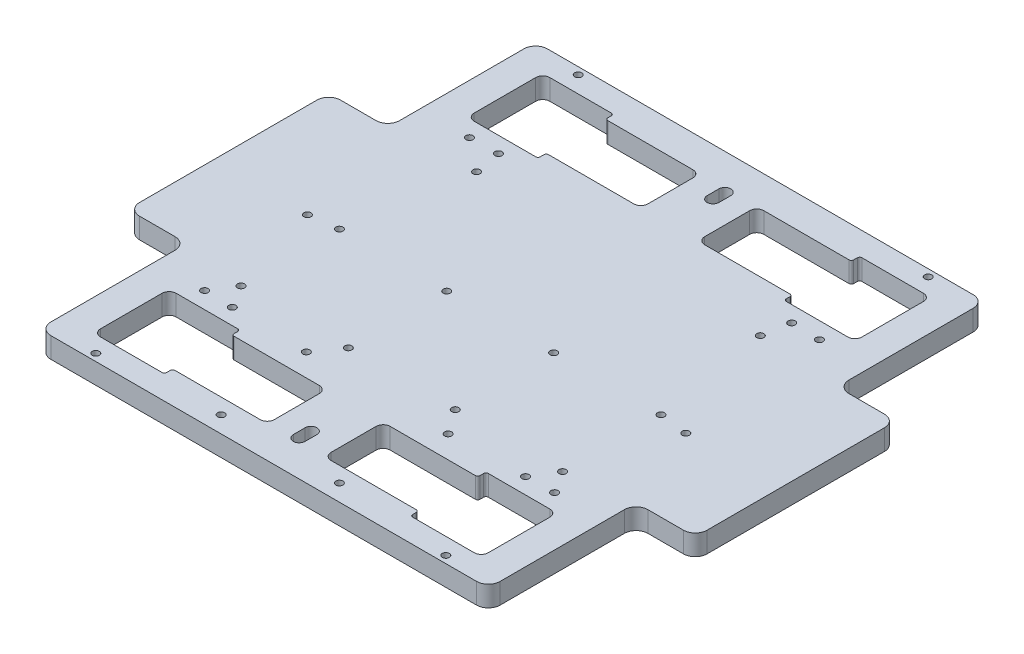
ISO-10303-21;
HEADER;
FILE_DESCRIPTION(('STEP AP214'),'2;1');
FILE_NAME('part.step','',(''),(''),'','','');
FILE_SCHEMA(('AUTOMOTIVE_DESIGN { 1 0 10303 214 1 1 1 1 }'));
ENDSEC;
DATA;
#1=APPLICATION_CONTEXT('core data for automotive mechanical design processes');
#2=APPLICATION_PROTOCOL_DEFINITION('international standard','automotive_design',2000,#1);
#3=PRODUCT_CONTEXT('',#1,'mechanical');
#4=PRODUCT('Part','Part','',(#3));
#5=PRODUCT_RELATED_PRODUCT_CATEGORY('part','',(#4));
#6=PRODUCT_DEFINITION_FORMATION('','',#4);
#7=PRODUCT_DEFINITION_CONTEXT('part definition',#1,'design');
#8=PRODUCT_DEFINITION('design','',#6,#7);
#9=PRODUCT_DEFINITION_SHAPE('','',#8);
#10=(LENGTH_UNIT() NAMED_UNIT(*) SI_UNIT(.MILLI.,.METRE.));
#11=(NAMED_UNIT(*) PLANE_ANGLE_UNIT() SI_UNIT($,.RADIAN.));
#12=(NAMED_UNIT(*) SI_UNIT($,.STERADIAN.) SOLID_ANGLE_UNIT());
#13=UNCERTAINTY_MEASURE_WITH_UNIT(LENGTH_MEASURE(1.E-05),#10,'distance_accuracy_value','');
#14=(GEOMETRIC_REPRESENTATION_CONTEXT(3) GLOBAL_UNCERTAINTY_ASSIGNED_CONTEXT((#13)) GLOBAL_UNIT_ASSIGNED_CONTEXT((#10,
#11,#12)) REPRESENTATION_CONTEXT('',''));
#15=CARTESIAN_POINT('',(0.,0.,0.));
#16=DIRECTION('',(0.,0.,1.));
#17=DIRECTION('',(1.,0.,0.));
#18=AXIS2_PLACEMENT_3D('',#15,#16,#17);
#19=CARTESIAN_POINT('',(95.,8.7,-105.));
#20=DIRECTION('',(-1.,0.,0.));
#21=DIRECTION('',(0.,0.,1.));
#22=AXIS2_PLACEMENT_3D('',#19,#20,#21);
#23=PLANE('',#22);
#24=DIRECTION('',(0.,0.,-1.));
#25=VECTOR('',#24,1.);
#26=CARTESIAN_POINT('',(95.,0.,-105.));
#27=LINE('',#26,#25);
#28=CARTESIAN_POINT('',(95.,0.,-47.5));
#29=VERTEX_POINT('',#28);
#30=CARTESIAN_POINT('',(95.,0.,-100.));
#31=VERTEX_POINT('',#30);
#32=EDGE_CURVE('E908',#29,#31,#27,.T.);
#33=ORIENTED_EDGE('',*,*,#32,.T.);
#34=DIRECTION('',(0.,-1.,0.));
#35=VECTOR('',#34,1.);
#36=CARTESIAN_POINT('',(95.,8.7,-100.));
#37=LINE('',#36,#35);
#38=CARTESIAN_POINT('',(95.,8.7,-100.));
#39=VERTEX_POINT('',#38);
#40=EDGE_CURVE('E1399',#31,#39,#37,.F.);
#41=ORIENTED_EDGE('',*,*,#40,.T.);
#42=DIRECTION('',(0.,0.,-1.));
#43=VECTOR('',#42,1.);
#44=CARTESIAN_POINT('',(95.,8.7,-105.));
#45=LINE('',#44,#43);
#46=CARTESIAN_POINT('',(95.,8.7,-47.5));
#47=VERTEX_POINT('',#46);
#48=EDGE_CURVE('E916',#47,#39,#45,.T.);
#49=ORIENTED_EDGE('',*,*,#48,.F.);
#50=DIRECTION('',(0.,1.,0.));
#51=VECTOR('',#50,1.);
#52=CARTESIAN_POINT('',(95.,8.7,-47.5));
#53=LINE('',#52,#51);
#54=EDGE_CURVE('E1397',#47,#29,#53,.F.);
#55=ORIENTED_EDGE('',*,*,#54,.T.);
#56=EDGE_LOOP('',(#33,#41,#49,#55));
#57=FACE_BOUND('',#56,.T.);
#58=ADVANCED_FACE('F38',(#57),#23,.F.);
#59=CARTESIAN_POINT('',(-95.,8.7,-105.));
#60=DIRECTION('',(1.,0.,0.));
#61=DIRECTION('',(0.,0.,-1.));
#62=AXIS2_PLACEMENT_3D('',#59,#60,#61);
#63=PLANE('',#62);
#64=DIRECTION('',(0.,0.,1.));
#65=VECTOR('',#64,1.);
#66=CARTESIAN_POINT('',(-95.,0.,-105.));
#67=LINE('',#66,#65);
#68=CARTESIAN_POINT('',(-95.,0.,47.5));
#69=VERTEX_POINT('',#68);
#70=CARTESIAN_POINT('',(-95.,0.,100.));
#71=VERTEX_POINT('',#70);
#72=EDGE_CURVE('E938',#69,#71,#67,.T.);
#73=ORIENTED_EDGE('',*,*,#72,.T.);
#74=DIRECTION('',(0.,-1.,0.));
#75=VECTOR('',#74,1.);
#76=CARTESIAN_POINT('',(-95.,8.7,100.));
#77=LINE('',#76,#75);
#78=CARTESIAN_POINT('',(-95.,8.7,100.));
#79=VERTEX_POINT('',#78);
#80=EDGE_CURVE('E1429',#71,#79,#77,.F.);
#81=ORIENTED_EDGE('',*,*,#80,.T.);
#82=DIRECTION('',(0.,0.,1.));
#83=VECTOR('',#82,1.);
#84=CARTESIAN_POINT('',(-95.,8.7,-105.));
#85=LINE('',#84,#83);
#86=CARTESIAN_POINT('',(-95.,8.7,47.5));
#87=VERTEX_POINT('',#86);
#88=EDGE_CURVE('E924',#87,#79,#85,.T.);
#89=ORIENTED_EDGE('',*,*,#88,.F.);
#90=DIRECTION('',(0.,1.,0.));
#91=VECTOR('',#90,1.);
#92=CARTESIAN_POINT('',(-95.,8.7,47.5));
#93=LINE('',#92,#91);
#94=EDGE_CURVE('E1427',#87,#69,#93,.F.);
#95=ORIENTED_EDGE('',*,*,#94,.T.);
#96=EDGE_LOOP('',(#73,#81,#89,#95));
#97=FACE_BOUND('',#96,.T.);
#98=ADVANCED_FACE('F1519',(#97),#63,.F.);
#99=CARTESIAN_POINT('',(95.,0.,100.));
#100=VERTEX_POINT('',#99);
#101=CARTESIAN_POINT('',(95.,0.,47.5));
#102=VERTEX_POINT('',#101);
#103=EDGE_CURVE('E934',#100,#102,#27,.T.);
#104=ORIENTED_EDGE('',*,*,#103,.T.);
#105=DIRECTION('',(0.,1.,0.));
#106=VECTOR('',#105,1.);
#107=CARTESIAN_POINT('',(95.,8.7,47.5));
#108=LINE('',#107,#106);
#109=CARTESIAN_POINT('',(95.,8.7,47.5));
#110=VERTEX_POINT('',#109);
#111=EDGE_CURVE('E1419',#102,#110,#108,.T.);
#112=ORIENTED_EDGE('',*,*,#111,.T.);
#113=CARTESIAN_POINT('',(95.,8.7,100.));
#114=VERTEX_POINT('',#113);
#115=EDGE_CURVE('E919',#114,#110,#45,.T.);
#116=ORIENTED_EDGE('',*,*,#115,.F.);
#117=DIRECTION('',(0.,-1.,0.));
#118=VECTOR('',#117,1.);
#119=CARTESIAN_POINT('',(95.,8.7,100.));
#120=LINE('',#119,#118);
#121=EDGE_CURVE('E1416',#114,#100,#120,.T.);
#122=ORIENTED_EDGE('',*,*,#121,.T.);
#123=EDGE_LOOP('',(#104,#112,#116,#122));
#124=FACE_BOUND('',#123,.T.);
#125=ADVANCED_FACE('F1522',(#124),#23,.F.);
#126=CARTESIAN_POINT('',(-95.,8.7,-105.));
#127=DIRECTION('',(0.,0.,1.));
#128=DIRECTION('',(1.,0.,0.));
#129=AXIS2_PLACEMENT_3D('',#126,#127,#128);
#130=PLANE('',#129);
#131=DIRECTION('',(-1.,0.,0.));
#132=VECTOR('',#131,1.);
#133=CARTESIAN_POINT('',(-95.,0.,-105.));
#134=LINE('',#133,#132);
#135=CARTESIAN_POINT('',(90.,0.,-105.));
#136=VERTEX_POINT('',#135);
#137=CARTESIAN_POINT('',(-90.,0.,-105.));
#138=VERTEX_POINT('',#137);
#139=EDGE_CURVE('E935',#136,#138,#134,.T.);
#140=ORIENTED_EDGE('',*,*,#139,.T.);
#141=DIRECTION('',(0.,-1.,0.));
#142=VECTOR('',#141,1.);
#143=CARTESIAN_POINT('',(-90.,8.7,-105.));
#144=LINE('',#143,#142);
#145=CARTESIAN_POINT('',(-90.,8.7,-105.));
#146=VERTEX_POINT('',#145);
#147=EDGE_CURVE('E1379',#138,#146,#144,.F.);
#148=ORIENTED_EDGE('',*,*,#147,.T.);
#149=DIRECTION('',(-1.,0.,0.));
#150=VECTOR('',#149,1.);
#151=CARTESIAN_POINT('',(-95.,8.7,-105.));
#152=LINE('',#151,#150);
#153=CARTESIAN_POINT('',(90.,8.7,-105.));
#154=VERTEX_POINT('',#153);
#155=EDGE_CURVE('E921',#154,#146,#152,.T.);
#156=ORIENTED_EDGE('',*,*,#155,.F.);
#157=DIRECTION('',(0.,-1.,0.));
#158=VECTOR('',#157,1.);
#159=CARTESIAN_POINT('',(90.,8.7,-105.));
#160=LINE('',#159,#158);
#161=EDGE_CURVE('E1376',#154,#136,#160,.T.);
#162=ORIENTED_EDGE('',*,*,#161,.T.);
#163=EDGE_LOOP('',(#140,#148,#156,#162));
#164=FACE_BOUND('',#163,.T.);
#165=ADVANCED_FACE('F1532',(#164),#130,.F.);
#166=CARTESIAN_POINT('',(-95.,8.7,-100.));
#167=VERTEX_POINT('',#166);
#168=CARTESIAN_POINT('',(-95.,8.7,-47.5));
#169=VERTEX_POINT('',#168);
#170=EDGE_CURVE('E927',#167,#169,#85,.T.);
#171=ORIENTED_EDGE('',*,*,#170,.F.);
#172=DIRECTION('',(0.,-1.,0.));
#173=VECTOR('',#172,1.);
#174=CARTESIAN_POINT('',(-95.,8.7,-100.));
#175=LINE('',#174,#173);
#176=CARTESIAN_POINT('',(-95.,0.,-100.));
#177=VERTEX_POINT('',#176);
#178=EDGE_CURVE('E1357',#167,#177,#175,.T.);
#179=ORIENTED_EDGE('',*,*,#178,.T.);
#180=CARTESIAN_POINT('',(-95.,0.,-47.5));
#181=VERTEX_POINT('',#180);
#182=EDGE_CURVE('E941',#177,#181,#67,.T.);
#183=ORIENTED_EDGE('',*,*,#182,.T.);
#184=DIRECTION('',(0.,1.,0.));
#185=VECTOR('',#184,1.);
#186=CARTESIAN_POINT('',(-95.,8.7,-47.5));
#187=LINE('',#186,#185);
#188=EDGE_CURVE('E1354',#181,#169,#187,.T.);
#189=ORIENTED_EDGE('',*,*,#188,.T.);
#190=EDGE_LOOP('',(#171,#179,#183,#189));
#191=FACE_BOUND('',#190,.T.);
#192=ADVANCED_FACE('F1528',(#191),#63,.F.);
#193=CARTESIAN_POINT('',(-95.,8.7,105.));
#194=DIRECTION('',(0.,0.,-1.));
#195=DIRECTION('',(-1.,0.,0.));
#196=AXIS2_PLACEMENT_3D('',#193,#194,#195);
#197=PLANE('',#196);
#198=DIRECTION('',(1.,0.,0.));
#199=VECTOR('',#198,1.);
#200=CARTESIAN_POINT('',(-95.,0.,105.));
#201=LINE('',#200,#199);
#202=CARTESIAN_POINT('',(-90.,0.,105.));
#203=VERTEX_POINT('',#202);
#204=CARTESIAN_POINT('',(90.,0.,105.));
#205=VERTEX_POINT('',#204);
#206=EDGE_CURVE('E920',#203,#205,#201,.T.);
#207=ORIENTED_EDGE('',*,*,#206,.T.);
#208=DIRECTION('',(0.,-1.,0.));
#209=VECTOR('',#208,1.);
#210=CARTESIAN_POINT('',(90.,8.7,105.));
#211=LINE('',#210,#209);
#212=CARTESIAN_POINT('',(90.,8.7,105.));
#213=VERTEX_POINT('',#212);
#214=EDGE_CURVE('E1425',#205,#213,#211,.F.);
#215=ORIENTED_EDGE('',*,*,#214,.T.);
#216=DIRECTION('',(1.,0.,0.));
#217=VECTOR('',#216,1.);
#218=CARTESIAN_POINT('',(-95.,8.7,105.));
#219=LINE('',#218,#217);
#220=CARTESIAN_POINT('',(-90.,8.7,105.));
#221=VERTEX_POINT('',#220);
#222=EDGE_CURVE('E928',#221,#213,#219,.T.);
#223=ORIENTED_EDGE('',*,*,#222,.F.);
#224=DIRECTION('',(0.,-1.,0.));
#225=VECTOR('',#224,1.);
#226=CARTESIAN_POINT('',(-90.,8.7,105.));
#227=LINE('',#226,#225);
#228=EDGE_CURVE('E1422',#221,#203,#227,.T.);
#229=ORIENTED_EDGE('',*,*,#228,.T.);
#230=EDGE_LOOP('',(#207,#215,#223,#229));
#231=FACE_BOUND('',#230,.T.);
#232=ADVANCED_FACE('F1637',(#231),#197,.F.);
#233=CARTESIAN_POINT('',(0.,8.7,0.));
#234=DIRECTION('',(0.,1.,0.));
#235=DIRECTION('',(0.,0.,1.));
#236=AXIS2_PLACEMENT_3D('',#233,#234,#235);
#237=PLANE('',#236);
#238=CARTESIAN_POINT('',(0.,8.7,90.));
#239=DIRECTION('',(0.,1.,0.));
#240=DIRECTION('',(0.,0.,-1.));
#241=AXIS2_PLACEMENT_3D('',#238,#239,#240);
#242=CIRCLE('',#241,2.49999999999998);
#243=CARTESIAN_POINT('',(-2.49999999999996,8.7,90.));
#244=VERTEX_POINT('',#243);
#245=CARTESIAN_POINT('',(2.5,8.7,90.));
#246=VERTEX_POINT('',#245);
#247=EDGE_CURVE('E53',#244,#246,#242,.T.);
#248=ORIENTED_EDGE('',*,*,#247,.F.);
#249=DIRECTION('',(0.,0.,1.));
#250=VECTOR('',#249,1.);
#251=CARTESIAN_POINT('',(-2.49999999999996,8.7,90.));
#252=LINE('',#251,#250);
#253=CARTESIAN_POINT('',(-2.49999999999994,8.7,85.));
#254=VERTEX_POINT('',#253);
#255=EDGE_CURVE('E650',#254,#244,#252,.T.);
#256=ORIENTED_EDGE('',*,*,#255,.F.);
#257=CARTESIAN_POINT('',(0.,8.7,85.));
#258=DIRECTION('',(0.,1.,0.));
#259=DIRECTION('',(0.,0.,-1.));
#260=AXIS2_PLACEMENT_3D('',#257,#258,#259);
#261=CIRCLE('',#260,2.49999999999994);
#262=CARTESIAN_POINT('',(2.49999999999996,8.7,85.));
#263=VERTEX_POINT('',#262);
#264=EDGE_CURVE('E634',#263,#254,#261,.T.);
#265=ORIENTED_EDGE('',*,*,#264,.F.);
#266=DIRECTION('',(0.,0.,-1.));
#267=VECTOR('',#266,1.);
#268=CARTESIAN_POINT('',(2.5,8.7,90.));
#269=LINE('',#268,#267);
#270=EDGE_CURVE('E643',#246,#263,#269,.T.);
#271=ORIENTED_EDGE('',*,*,#270,.F.);
#272=EDGE_LOOP('',(#248,#256,#265,#271));
#273=FACE_BOUND('',#272,.T.);
#274=CARTESIAN_POINT('',(0.,8.7,-90.));
#275=DIRECTION('',(0.,1.,0.));
#276=DIRECTION('',(0.,0.,1.));
#277=AXIS2_PLACEMENT_3D('',#274,#275,#276);
#278=CIRCLE('',#277,2.49999999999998);
#279=CARTESIAN_POINT('',(2.5,8.7,-90.));
#280=VERTEX_POINT('',#279);
#281=CARTESIAN_POINT('',(-2.49999999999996,8.7,-90.));
#282=VERTEX_POINT('',#281);
#283=EDGE_CURVE('E657',#280,#282,#278,.T.);
#284=ORIENTED_EDGE('',*,*,#283,.F.);
#285=DIRECTION('',(0.,0.,-1.));
#286=VECTOR('',#285,1.);
#287=CARTESIAN_POINT('',(2.5,8.7,-90.));
#288=LINE('',#287,#286);
#289=CARTESIAN_POINT('',(2.49999999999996,8.7,-85.));
#290=VERTEX_POINT('',#289);
#291=EDGE_CURVE('E667',#290,#280,#288,.T.);
#292=ORIENTED_EDGE('',*,*,#291,.F.);
#293=CARTESIAN_POINT('',(0.,8.7,-85.));
#294=DIRECTION('',(0.,1.,0.));
#295=DIRECTION('',(0.,0.,1.));
#296=AXIS2_PLACEMENT_3D('',#293,#294,#295);
#297=CIRCLE('',#296,2.49999999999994);
#298=CARTESIAN_POINT('',(-2.49999999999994,8.7,-85.));
#299=VERTEX_POINT('',#298);
#300=EDGE_CURVE('E664',#299,#290,#297,.T.);
#301=ORIENTED_EDGE('',*,*,#300,.F.);
#302=DIRECTION('',(0.,0.,1.));
#303=VECTOR('',#302,1.);
#304=CARTESIAN_POINT('',(-2.49999999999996,8.7,-90.));
#305=LINE('',#304,#303);
#306=EDGE_CURVE('E661',#282,#299,#305,.T.);
#307=ORIENTED_EDGE('',*,*,#306,.F.);
#308=EDGE_LOOP('',(#284,#292,#301,#307));
#309=FACE_BOUND('',#308,.T.);
#310=CARTESIAN_POINT('',(-68.,8.7,46.6));
#311=DIRECTION('',(0.,1.,0.));
#312=DIRECTION('',(0.,0.,1.));
#313=AXIS2_PLACEMENT_3D('',#310,#311,#312);
#314=CIRCLE('',#313,1.5);
#315=CARTESIAN_POINT('',(-68.,8.7,48.1));
#316=VERTEX_POINT('',#315);
#317=EDGE_CURVE('E680',#316,#316,#314,.T.);
#318=ORIENTED_EDGE('',*,*,#317,.F.);
#319=EDGE_LOOP('',(#318));
#320=FACE_BOUND('',#319,.T.);
#321=CARTESIAN_POINT('',(-22.6,8.7,46.6));
#322=DIRECTION('',(0.,1.,0.));
#323=DIRECTION('',(0.,0.,1.));
#324=AXIS2_PLACEMENT_3D('',#321,#322,#323);
#325=CIRCLE('',#324,1.5);
#326=CARTESIAN_POINT('',(-22.6,8.7,48.1));
#327=VERTEX_POINT('',#326);
#328=EDGE_CURVE('E684',#327,#327,#325,.T.);
#329=ORIENTED_EDGE('',*,*,#328,.F.);
#330=EDGE_LOOP('',(#329));
#331=FACE_BOUND('',#330,.T.);
#332=CARTESIAN_POINT('',(-22.6,8.7,5.00000000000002));
#333=DIRECTION('',(0.,1.,0.));
#334=DIRECTION('',(0.,0.,1.));
#335=AXIS2_PLACEMENT_3D('',#332,#333,#334);
#336=CIRCLE('',#335,1.5);
#337=CARTESIAN_POINT('',(-22.6,8.7,6.50000000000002));
#338=VERTEX_POINT('',#337);
#339=EDGE_CURVE('E687',#338,#338,#336,.T.);
#340=ORIENTED_EDGE('',*,*,#339,.F.);
#341=EDGE_LOOP('',(#340));
#342=FACE_BOUND('',#341,.T.);
#343=CARTESIAN_POINT('',(22.6,8.7,5.00000000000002));
#344=DIRECTION('',(0.,1.,0.));
#345=DIRECTION('',(0.,0.,-1.));
#346=AXIS2_PLACEMENT_3D('',#343,#344,#345);
#347=CIRCLE('',#346,1.5);
#348=CARTESIAN_POINT('',(22.6,8.7,3.50000000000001));
#349=VERTEX_POINT('',#348);
#350=EDGE_CURVE('E690',#349,#349,#347,.T.);
#351=ORIENTED_EDGE('',*,*,#350,.F.);
#352=EDGE_LOOP('',(#351));
#353=FACE_BOUND('',#352,.T.);
#354=CARTESIAN_POINT('',(22.5999999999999,8.7,46.6));
#355=DIRECTION('',(0.,1.,0.));
#356=DIRECTION('',(0.,0.,-1.));
#357=AXIS2_PLACEMENT_3D('',#354,#355,#356);
#358=CIRCLE('',#357,1.5);
#359=CARTESIAN_POINT('',(22.5999999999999,8.7,45.1));
#360=VERTEX_POINT('',#359);
#361=EDGE_CURVE('E693',#360,#360,#358,.T.);
#362=ORIENTED_EDGE('',*,*,#361,.F.);
#363=EDGE_LOOP('',(#362));
#364=FACE_BOUND('',#363,.T.);
#365=CARTESIAN_POINT('',(67.9999999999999,8.7,46.6));
#366=DIRECTION('',(0.,1.,0.));
#367=DIRECTION('',(0.,0.,-1.));
#368=AXIS2_PLACEMENT_3D('',#365,#366,#367);
#369=CIRCLE('',#368,1.5);
#370=CARTESIAN_POINT('',(67.9999999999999,8.7,45.1));
#371=VERTEX_POINT('',#370);
#372=EDGE_CURVE('E696',#371,#371,#369,.T.);
#373=ORIENTED_EDGE('',*,*,#372,.F.);
#374=EDGE_LOOP('',(#373));
#375=FACE_BOUND('',#374,.T.);
#376=CARTESIAN_POINT('',(67.9999999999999,8.7,5.00000000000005));
#377=DIRECTION('',(0.,1.,0.));
#378=DIRECTION('',(0.,0.,-1.));
#379=AXIS2_PLACEMENT_3D('',#376,#377,#378);
#380=CIRCLE('',#379,1.5);
#381=CARTESIAN_POINT('',(67.9999999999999,8.7,3.50000000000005));
#382=VERTEX_POINT('',#381);
#383=EDGE_CURVE('E673',#382,#382,#380,.T.);
#384=ORIENTED_EDGE('',*,*,#383,.F.);
#385=EDGE_LOOP('',(#384));
#386=FACE_BOUND('',#385,.T.);
#387=CARTESIAN_POINT('',(-68.,8.7,5.00000000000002));
#388=DIRECTION('',(0.,1.,0.));
#389=DIRECTION('',(0.,0.,1.));
#390=AXIS2_PLACEMENT_3D('',#387,#388,#389);
#391=CIRCLE('',#390,1.5);
#392=CARTESIAN_POINT('',(-68.,8.7,6.50000000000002));
#393=VERTEX_POINT('',#392);
#394=EDGE_CURVE('E701',#393,#393,#391,.T.);
#395=ORIENTED_EDGE('',*,*,#394,.F.);
#396=EDGE_LOOP('',(#395));
#397=FACE_BOUND('',#396,.T.);
#398=DIRECTION('',(-1.,0.,0.));
#399=VECTOR('',#398,1.);
#400=CARTESIAN_POINT('',(82.,8.7,66.5));
#401=LINE('',#400,#399);
#402=CARTESIAN_POINT('',(51.,8.7,66.5));
#403=VERTEX_POINT('',#402);
#404=CARTESIAN_POINT('',(15.,8.7,66.5));
#405=VERTEX_POINT('',#404);
#406=EDGE_CURVE('E765',#403,#405,#401,.T.);
#407=ORIENTED_EDGE('',*,*,#406,.F.);
#408=CARTESIAN_POINT('',(51.,8.7,65.5));
#409=DIRECTION('',(0.,1.,0.));
#410=DIRECTION('',(0.,0.,1.));
#411=AXIS2_PLACEMENT_3D('',#408,#409,#410);
#412=CIRCLE('',#411,1.);
#413=CARTESIAN_POINT('',(52.,8.7,65.5));
#414=VERTEX_POINT('',#413);
#415=EDGE_CURVE('E1087',#403,#414,#412,.T.);
#416=ORIENTED_EDGE('',*,*,#415,.T.);
#417=DIRECTION('',(0.,0.,1.));
#418=VECTOR('',#417,1.);
#419=CARTESIAN_POINT('',(52.,8.7,63.));
#420=LINE('',#419,#418);
#421=CARTESIAN_POINT('',(52.,8.7,64.));
#422=VERTEX_POINT('',#421);
#423=EDGE_CURVE('E711',#422,#414,#420,.T.);
#424=ORIENTED_EDGE('',*,*,#423,.F.);
#425=CARTESIAN_POINT('',(53.,8.7,64.));
#426=DIRECTION('',(0.,1.,0.));
#427=DIRECTION('',(0.,0.,1.));
#428=AXIS2_PLACEMENT_3D('',#425,#426,#427);
#429=CIRCLE('',#428,1.);
#430=CARTESIAN_POINT('',(53.,8.7,63.));
#431=VERTEX_POINT('',#430);
#432=EDGE_CURVE('E1274',#422,#431,#429,.F.);
#433=ORIENTED_EDGE('',*,*,#432,.T.);
#434=DIRECTION('',(-1.,0.,0.));
#435=VECTOR('',#434,1.);
#436=CARTESIAN_POINT('',(82.,8.7,63.));
#437=LINE('',#436,#435);
#438=CARTESIAN_POINT('',(79.,8.7,63.));
#439=VERTEX_POINT('',#438);
#440=EDGE_CURVE('E706',#439,#431,#437,.T.);
#441=ORIENTED_EDGE('',*,*,#440,.F.);
#442=CARTESIAN_POINT('',(79.,8.7,66.));
#443=DIRECTION('',(0.,1.,0.));
#444=DIRECTION('',(0.,0.,1.));
#445=AXIS2_PLACEMENT_3D('',#442,#443,#444);
#446=CIRCLE('',#445,3.);
#447=CARTESIAN_POINT('',(82.,8.7,66.));
#448=VERTEX_POINT('',#447);
#449=EDGE_CURVE('E1326',#439,#448,#446,.F.);
#450=ORIENTED_EDGE('',*,*,#449,.T.);
#451=DIRECTION('',(0.,0.,-1.));
#452=VECTOR('',#451,1.);
#453=CARTESIAN_POINT('',(82.,8.7,66.5));
#454=LINE('',#453,#452);
#455=CARTESIAN_POINT('',(82.,8.7,92.));
#456=VERTEX_POINT('',#455);
#457=EDGE_CURVE('E762',#456,#448,#454,.T.);
#458=ORIENTED_EDGE('',*,*,#457,.F.);
#459=CARTESIAN_POINT('',(79.,8.7,92.));
#460=DIRECTION('',(0.,1.,0.));
#461=DIRECTION('',(0.,0.,1.));
#462=AXIS2_PLACEMENT_3D('',#459,#460,#461);
#463=CIRCLE('',#462,3.);
#464=CARTESIAN_POINT('',(79.,8.7,95.));
#465=VERTEX_POINT('',#464);
#466=EDGE_CURVE('E1322',#456,#465,#463,.F.);
#467=ORIENTED_EDGE('',*,*,#466,.T.);
#468=DIRECTION('',(1.,0.,0.));
#469=VECTOR('',#468,1.);
#470=CARTESIAN_POINT('',(82.,8.7,95.));
#471=LINE('',#470,#469);
#472=CARTESIAN_POINT('',(53.,8.7,95.));
#473=VERTEX_POINT('',#472);
#474=EDGE_CURVE('E714',#473,#465,#471,.T.);
#475=ORIENTED_EDGE('',*,*,#474,.F.);
#476=CARTESIAN_POINT('',(53.,8.7,94.));
#477=DIRECTION('',(0.,1.,0.));
#478=DIRECTION('',(0.,0.,1.));
#479=AXIS2_PLACEMENT_3D('',#476,#477,#478);
#480=CIRCLE('',#479,1.);
#481=CARTESIAN_POINT('',(52.,8.7,94.));
#482=VERTEX_POINT('',#481);
#483=EDGE_CURVE('E1278',#473,#482,#480,.F.);
#484=ORIENTED_EDGE('',*,*,#483,.T.);
#485=CARTESIAN_POINT('',(52.,8.7,92.5));
#486=VERTEX_POINT('',#485);
#487=EDGE_CURVE('E709',#486,#482,#420,.T.);
#488=ORIENTED_EDGE('',*,*,#487,.F.);
#489=CARTESIAN_POINT('',(51.,8.7,92.5));
#490=DIRECTION('',(0.,1.,0.));
#491=DIRECTION('',(0.,0.,1.));
#492=AXIS2_PLACEMENT_3D('',#489,#490,#491);
#493=CIRCLE('',#492,1.);
#494=CARTESIAN_POINT('',(51.,8.7,91.5));
#495=VERTEX_POINT('',#494);
#496=EDGE_CURVE('E1085',#486,#495,#493,.T.);
#497=ORIENTED_EDGE('',*,*,#496,.T.);
#498=DIRECTION('',(1.,0.,0.));
#499=VECTOR('',#498,1.);
#500=CARTESIAN_POINT('',(82.,8.7,91.5));
#501=LINE('',#500,#499);
#502=CARTESIAN_POINT('',(15.,8.7,91.5));
#503=VERTEX_POINT('',#502);
#504=EDGE_CURVE('E772',#503,#495,#501,.T.);
#505=ORIENTED_EDGE('',*,*,#504,.F.);
#506=CARTESIAN_POINT('',(15.,8.7,88.5));
#507=DIRECTION('',(0.,1.,0.));
#508=DIRECTION('',(0.,0.,1.));
#509=AXIS2_PLACEMENT_3D('',#506,#507,#508);
#510=CIRCLE('',#509,3.);
#511=CARTESIAN_POINT('',(12.,8.7,88.5));
#512=VERTEX_POINT('',#511);
#513=EDGE_CURVE('E1334',#503,#512,#510,.F.);
#514=ORIENTED_EDGE('',*,*,#513,.T.);
#515=DIRECTION('',(0.,0.,1.));
#516=VECTOR('',#515,1.);
#517=CARTESIAN_POINT('',(12.,8.7,66.5));
#518=LINE('',#517,#516);
#519=CARTESIAN_POINT('',(12.,8.7,69.5));
#520=VERTEX_POINT('',#519);
#521=EDGE_CURVE('E769',#520,#512,#518,.T.);
#522=ORIENTED_EDGE('',*,*,#521,.F.);
#523=CARTESIAN_POINT('',(15.,8.7,69.5));
#524=DIRECTION('',(0.,1.,0.));
#525=DIRECTION('',(0.,0.,1.));
#526=AXIS2_PLACEMENT_3D('',#523,#524,#525);
#527=CIRCLE('',#526,3.);
#528=EDGE_CURVE('E1330',#520,#405,#527,.F.);
#529=ORIENTED_EDGE('',*,*,#528,.T.);
#530=EDGE_LOOP('',(#407,#416,#424,#433,#441,#450,#458,#467,#475,#484,#488,#497,#505,#514,#522,#529));
#531=FACE_BOUND('',#530,.T.);
#532=DIRECTION('',(-1.,0.,0.));
#533=VECTOR('',#532,1.);
#534=CARTESIAN_POINT('',(82.,8.7,-91.5));
#535=LINE('',#534,#533);
#536=CARTESIAN_POINT('',(51.,8.7,-91.5));
#537=VERTEX_POINT('',#536);
#538=CARTESIAN_POINT('',(15.,8.7,-91.5));
#539=VERTEX_POINT('',#538);
#540=EDGE_CURVE('E779',#537,#539,#535,.T.);
#541=ORIENTED_EDGE('',*,*,#540,.F.);
#542=CARTESIAN_POINT('',(51.,8.7,-92.5));
#543=DIRECTION('',(0.,1.,0.));
#544=DIRECTION('',(0.,0.,1.));
#545=AXIS2_PLACEMENT_3D('',#542,#543,#544);
#546=CIRCLE('',#545,1.);
#547=CARTESIAN_POINT('',(52.,8.7,-92.5));
#548=VERTEX_POINT('',#547);
#549=EDGE_CURVE('E1091',#537,#548,#546,.T.);
#550=ORIENTED_EDGE('',*,*,#549,.T.);
#551=DIRECTION('',(0.,0.,1.));
#552=VECTOR('',#551,1.);
#553=CARTESIAN_POINT('',(52.,8.7,-63.));
#554=LINE('',#553,#552);
#555=CARTESIAN_POINT('',(52.,8.7,-94.));
#556=VERTEX_POINT('',#555);
#557=EDGE_CURVE('E723',#556,#548,#554,.T.);
#558=ORIENTED_EDGE('',*,*,#557,.F.);
#559=CARTESIAN_POINT('',(53.,8.7,-94.));
#560=DIRECTION('',(0.,1.,0.));
#561=DIRECTION('',(0.,0.,1.));
#562=AXIS2_PLACEMENT_3D('',#559,#560,#561);
#563=CIRCLE('',#562,1.);
#564=CARTESIAN_POINT('',(53.,8.7,-95.));
#565=VERTEX_POINT('',#564);
#566=EDGE_CURVE('E1266',#556,#565,#563,.F.);
#567=ORIENTED_EDGE('',*,*,#566,.T.);
#568=DIRECTION('',(-1.,0.,0.));
#569=VECTOR('',#568,1.);
#570=CARTESIAN_POINT('',(82.,8.7,-95.));
#571=LINE('',#570,#569);
#572=CARTESIAN_POINT('',(79.,8.7,-95.));
#573=VERTEX_POINT('',#572);
#574=EDGE_CURVE('E718',#573,#565,#571,.T.);
#575=ORIENTED_EDGE('',*,*,#574,.F.);
#576=CARTESIAN_POINT('',(79.,8.7,-92.));
#577=DIRECTION('',(0.,1.,0.));
#578=DIRECTION('',(0.,0.,1.));
#579=AXIS2_PLACEMENT_3D('',#576,#577,#578);
#580=CIRCLE('',#579,3.);
#581=CARTESIAN_POINT('',(82.,8.7,-92.));
#582=VERTEX_POINT('',#581);
#583=EDGE_CURVE('E1314',#573,#582,#580,.F.);
#584=ORIENTED_EDGE('',*,*,#583,.T.);
#585=DIRECTION('',(0.,0.,-1.));
#586=VECTOR('',#585,1.);
#587=CARTESIAN_POINT('',(82.,8.7,-66.5));
#588=LINE('',#587,#586);
#589=CARTESIAN_POINT('',(82.,8.7,-66.));
#590=VERTEX_POINT('',#589);
#591=EDGE_CURVE('E776',#590,#582,#588,.T.);
#592=ORIENTED_EDGE('',*,*,#591,.F.);
#593=CARTESIAN_POINT('',(79.,8.7,-66.));
#594=DIRECTION('',(0.,1.,0.));
#595=DIRECTION('',(0.,0.,1.));
#596=AXIS2_PLACEMENT_3D('',#593,#594,#595);
#597=CIRCLE('',#596,3.);
#598=CARTESIAN_POINT('',(79.,8.7,-63.));
#599=VERTEX_POINT('',#598);
#600=EDGE_CURVE('E1318',#590,#599,#597,.F.);
#601=ORIENTED_EDGE('',*,*,#600,.T.);
#602=DIRECTION('',(1.,0.,0.));
#603=VECTOR('',#602,1.);
#604=CARTESIAN_POINT('',(82.,8.7,-63.));
#605=LINE('',#604,#603);
#606=CARTESIAN_POINT('',(53.,8.7,-63.));
#607=VERTEX_POINT('',#606);
#608=EDGE_CURVE('E710',#607,#599,#605,.T.);
#609=ORIENTED_EDGE('',*,*,#608,.F.);
#610=CARTESIAN_POINT('',(53.,8.7,-64.));
#611=DIRECTION('',(0.,1.,0.));
#612=DIRECTION('',(0.,0.,1.));
#613=AXIS2_PLACEMENT_3D('',#610,#611,#612);
#614=CIRCLE('',#613,1.);
#615=CARTESIAN_POINT('',(52.,8.7,-64.));
#616=VERTEX_POINT('',#615);
#617=EDGE_CURVE('E1270',#607,#616,#614,.F.);
#618=ORIENTED_EDGE('',*,*,#617,.T.);
#619=CARTESIAN_POINT('',(52.,8.7,-65.5));
#620=VERTEX_POINT('',#619);
#621=EDGE_CURVE('E721',#620,#616,#554,.T.);
#622=ORIENTED_EDGE('',*,*,#621,.F.);
#623=CARTESIAN_POINT('',(51.,8.7,-65.5));
#624=DIRECTION('',(0.,1.,0.));
#625=DIRECTION('',(0.,0.,1.));
#626=AXIS2_PLACEMENT_3D('',#623,#624,#625);
#627=CIRCLE('',#626,1.);
#628=CARTESIAN_POINT('',(51.,8.7,-66.5));
#629=VERTEX_POINT('',#628);
#630=EDGE_CURVE('E1089',#620,#629,#627,.T.);
#631=ORIENTED_EDGE('',*,*,#630,.T.);
#632=DIRECTION('',(1.,0.,0.));
#633=VECTOR('',#632,1.);
#634=CARTESIAN_POINT('',(82.,8.7,-66.5));
#635=LINE('',#634,#633);
#636=CARTESIAN_POINT('',(15.,8.7,-66.5));
#637=VERTEX_POINT('',#636);
#638=EDGE_CURVE('E766',#637,#629,#635,.T.);
#639=ORIENTED_EDGE('',*,*,#638,.F.);
#640=CARTESIAN_POINT('',(15.,8.7,-69.5));
#641=DIRECTION('',(0.,1.,0.));
#642=DIRECTION('',(0.,0.,1.));
#643=AXIS2_PLACEMENT_3D('',#640,#641,#642);
#644=CIRCLE('',#643,3.);
#645=CARTESIAN_POINT('',(12.,8.7,-69.5));
#646=VERTEX_POINT('',#645);
#647=EDGE_CURVE('E1310',#637,#646,#644,.F.);
#648=ORIENTED_EDGE('',*,*,#647,.T.);
#649=DIRECTION('',(0.,0.,1.));
#650=VECTOR('',#649,1.);
#651=CARTESIAN_POINT('',(12.,8.7,-66.5));
#652=LINE('',#651,#650);
#653=CARTESIAN_POINT('',(12.,8.7,-88.5));
#654=VERTEX_POINT('',#653);
#655=EDGE_CURVE('E783',#654,#646,#652,.T.);
#656=ORIENTED_EDGE('',*,*,#655,.F.);
#657=CARTESIAN_POINT('',(15.,8.7,-88.5));
#658=DIRECTION('',(0.,1.,0.));
#659=DIRECTION('',(0.,0.,1.));
#660=AXIS2_PLACEMENT_3D('',#657,#658,#659);
#661=CIRCLE('',#660,3.);
#662=EDGE_CURVE('E1306',#654,#539,#661,.F.);
#663=ORIENTED_EDGE('',*,*,#662,.T.);
#664=EDGE_LOOP('',(#541,#550,#558,#567,#575,#584,#592,#601,#609,#618,#622,#631,#639,#648,#656,#663));
#665=FACE_BOUND('',#664,.T.);
#666=DIRECTION('',(1.,0.,0.));
#667=VECTOR('',#666,1.);
#668=CARTESIAN_POINT('',(-82.,8.7,-66.5));
#669=LINE('',#668,#667);
#670=CARTESIAN_POINT('',(-51.,8.7,-66.5));
#671=VERTEX_POINT('',#670);
#672=CARTESIAN_POINT('',(-15.,8.7,-66.5));
#673=VERTEX_POINT('',#672);
#674=EDGE_CURVE('E791',#671,#673,#669,.T.);
#675=ORIENTED_EDGE('',*,*,#674,.F.);
#676=CARTESIAN_POINT('',(-51.,8.7,-65.5));
#677=DIRECTION('',(0.,1.,0.));
#678=DIRECTION('',(0.,0.,1.));
#679=AXIS2_PLACEMENT_3D('',#676,#677,#678);
#680=CIRCLE('',#679,1.);
#681=CARTESIAN_POINT('',(-52.,8.7,-65.5));
#682=VERTEX_POINT('',#681);
#683=EDGE_CURVE('E1095',#671,#682,#680,.T.);
#684=ORIENTED_EDGE('',*,*,#683,.T.);
#685=DIRECTION('',(0.,0.,-1.));
#686=VECTOR('',#685,1.);
#687=CARTESIAN_POINT('',(-52.,8.7,-63.));
#688=LINE('',#687,#686);
#689=CARTESIAN_POINT('',(-52.,8.7,-64.));
#690=VERTEX_POINT('',#689);
#691=EDGE_CURVE('E734',#690,#682,#688,.T.);
#692=ORIENTED_EDGE('',*,*,#691,.F.);
#693=CARTESIAN_POINT('',(-53.,8.7,-64.));
#694=DIRECTION('',(0.,1.,0.));
#695=DIRECTION('',(0.,0.,1.));
#696=AXIS2_PLACEMENT_3D('',#693,#694,#695);
#697=CIRCLE('',#696,1.);
#698=CARTESIAN_POINT('',(-53.,8.7,-63.));
#699=VERTEX_POINT('',#698);
#700=EDGE_CURVE('E1258',#690,#699,#697,.F.);
#701=ORIENTED_EDGE('',*,*,#700,.T.);
#702=DIRECTION('',(1.,0.,0.));
#703=VECTOR('',#702,1.);
#704=CARTESIAN_POINT('',(-82.,8.7,-63.));
#705=LINE('',#704,#703);
#706=CARTESIAN_POINT('',(-79.,8.7,-63.));
#707=VERTEX_POINT('',#706);
#708=EDGE_CURVE('E728',#707,#699,#705,.T.);
#709=ORIENTED_EDGE('',*,*,#708,.F.);
#710=CARTESIAN_POINT('',(-79.,8.7,-66.));
#711=DIRECTION('',(0.,1.,0.));
#712=DIRECTION('',(0.,0.,1.));
#713=AXIS2_PLACEMENT_3D('',#710,#711,#712);
#714=CIRCLE('',#713,3.);
#715=CARTESIAN_POINT('',(-82.,8.7,-66.));
#716=VERTEX_POINT('',#715);
#717=EDGE_CURVE('E1302',#707,#716,#714,.F.);
#718=ORIENTED_EDGE('',*,*,#717,.T.);
#719=DIRECTION('',(0.,0.,1.));
#720=VECTOR('',#719,1.);
#721=CARTESIAN_POINT('',(-82.,8.7,-66.5));
#722=LINE('',#721,#720);
#723=CARTESIAN_POINT('',(-82.,8.7,-92.));
#724=VERTEX_POINT('',#723);
#725=EDGE_CURVE('E788',#724,#716,#722,.T.);
#726=ORIENTED_EDGE('',*,*,#725,.F.);
#727=CARTESIAN_POINT('',(-79.,8.7,-92.));
#728=DIRECTION('',(0.,1.,0.));
#729=DIRECTION('',(0.,0.,1.));
#730=AXIS2_PLACEMENT_3D('',#727,#728,#729);
#731=CIRCLE('',#730,3.);
#732=CARTESIAN_POINT('',(-79.,8.7,-95.));
#733=VERTEX_POINT('',#732);
#734=EDGE_CURVE('E1298',#724,#733,#731,.F.);
#735=ORIENTED_EDGE('',*,*,#734,.T.);
#736=DIRECTION('',(-1.,0.,0.));
#737=VECTOR('',#736,1.);
#738=CARTESIAN_POINT('',(-82.,8.7,-95.));
#739=LINE('',#738,#737);
#740=CARTESIAN_POINT('',(-53.,8.7,-95.));
#741=VERTEX_POINT('',#740);
#742=EDGE_CURVE('E722',#741,#733,#739,.T.);
#743=ORIENTED_EDGE('',*,*,#742,.F.);
#744=CARTESIAN_POINT('',(-53.,8.7,-94.));
#745=DIRECTION('',(0.,1.,0.));
#746=DIRECTION('',(0.,0.,1.));
#747=AXIS2_PLACEMENT_3D('',#744,#745,#746);
#748=CIRCLE('',#747,1.);
#749=CARTESIAN_POINT('',(-52.,8.7,-94.));
#750=VERTEX_POINT('',#749);
#751=EDGE_CURVE('E1262',#741,#750,#748,.F.);
#752=ORIENTED_EDGE('',*,*,#751,.T.);
#753=CARTESIAN_POINT('',(-52.,8.7,-92.5));
#754=VERTEX_POINT('',#753);
#755=EDGE_CURVE('E731',#754,#750,#688,.T.);
#756=ORIENTED_EDGE('',*,*,#755,.F.);
#757=CARTESIAN_POINT('',(-51.,8.7,-92.5));
#758=DIRECTION('',(0.,1.,0.));
#759=DIRECTION('',(0.,0.,1.));
#760=AXIS2_PLACEMENT_3D('',#757,#758,#759);
#761=CIRCLE('',#760,1.);
#762=CARTESIAN_POINT('',(-51.,8.7,-91.5));
#763=VERTEX_POINT('',#762);
#764=EDGE_CURVE('E1093',#754,#763,#761,.T.);
#765=ORIENTED_EDGE('',*,*,#764,.T.);
#766=DIRECTION('',(-1.,0.,0.));
#767=VECTOR('',#766,1.);
#768=CARTESIAN_POINT('',(-82.,8.7,-91.5));
#769=LINE('',#768,#767);
#770=CARTESIAN_POINT('',(-15.,8.7,-91.5));
#771=VERTEX_POINT('',#770);
#772=EDGE_CURVE('E780',#771,#763,#769,.T.);
#773=ORIENTED_EDGE('',*,*,#772,.F.);
#774=CARTESIAN_POINT('',(-15.,8.7,-88.5));
#775=DIRECTION('',(0.,1.,0.));
#776=DIRECTION('',(0.,0.,1.));
#777=AXIS2_PLACEMENT_3D('',#774,#775,#776);
#778=CIRCLE('',#777,3.);
#779=CARTESIAN_POINT('',(-12.,8.7,-88.5));
#780=VERTEX_POINT('',#779);
#781=EDGE_CURVE('E1294',#771,#780,#778,.F.);
#782=ORIENTED_EDGE('',*,*,#781,.T.);
#783=DIRECTION('',(0.,0.,-1.));
#784=VECTOR('',#783,1.);
#785=CARTESIAN_POINT('',(-12.,8.7,-66.5));
#786=LINE('',#785,#784);
#787=CARTESIAN_POINT('',(-12.,8.7,-69.5));
#788=VERTEX_POINT('',#787);
#789=EDGE_CURVE('E794',#788,#780,#786,.T.);
#790=ORIENTED_EDGE('',*,*,#789,.F.);
#791=CARTESIAN_POINT('',(-15.,8.7,-69.5));
#792=DIRECTION('',(0.,1.,0.));
#793=DIRECTION('',(0.,0.,1.));
#794=AXIS2_PLACEMENT_3D('',#791,#792,#793);
#795=CIRCLE('',#794,3.);
#796=EDGE_CURVE('E1290',#788,#673,#795,.F.);
#797=ORIENTED_EDGE('',*,*,#796,.T.);
#798=EDGE_LOOP('',(#675,#684,#692,#701,#709,#718,#726,#735,#743,#752,#756,#765,#773,#782,#790,#797));
#799=FACE_BOUND('',#798,.T.);
#800=DIRECTION('',(1.,0.,0.));
#801=VECTOR('',#800,1.);
#802=CARTESIAN_POINT('',(-82.,8.7,91.5));
#803=LINE('',#802,#801);
#804=CARTESIAN_POINT('',(-51.,8.7,91.5));
#805=VERTEX_POINT('',#804);
#806=CARTESIAN_POINT('',(-15.,8.7,91.5));
#807=VERTEX_POINT('',#806);
#808=EDGE_CURVE('E807',#805,#807,#803,.T.);
#809=ORIENTED_EDGE('',*,*,#808,.F.);
#810=CARTESIAN_POINT('',(-51.,8.7,92.5));
#811=DIRECTION('',(0.,1.,0.));
#812=DIRECTION('',(0.,0.,1.));
#813=AXIS2_PLACEMENT_3D('',#810,#811,#812);
#814=CIRCLE('',#813,1.);
#815=CARTESIAN_POINT('',(-52.,8.7,92.5));
#816=VERTEX_POINT('',#815);
#817=EDGE_CURVE('E1083',#805,#816,#814,.T.);
#818=ORIENTED_EDGE('',*,*,#817,.T.);
#819=DIRECTION('',(0.,0.,-1.));
#820=VECTOR('',#819,1.);
#821=CARTESIAN_POINT('',(-52.,8.7,63.));
#822=LINE('',#821,#820);
#823=CARTESIAN_POINT('',(-52.,8.7,94.));
#824=VERTEX_POINT('',#823);
#825=EDGE_CURVE('E751',#824,#816,#822,.T.);
#826=ORIENTED_EDGE('',*,*,#825,.F.);
#827=CARTESIAN_POINT('',(-53.,8.7,94.));
#828=DIRECTION('',(0.,1.,0.));
#829=DIRECTION('',(0.,0.,1.));
#830=AXIS2_PLACEMENT_3D('',#827,#828,#829);
#831=CIRCLE('',#830,1.);
#832=CARTESIAN_POINT('',(-53.,8.7,95.));
#833=VERTEX_POINT('',#832);
#834=EDGE_CURVE('E1282',#824,#833,#831,.F.);
#835=ORIENTED_EDGE('',*,*,#834,.T.);
#836=DIRECTION('',(1.,0.,0.));
#837=VECTOR('',#836,1.);
#838=CARTESIAN_POINT('',(-82.,8.7,95.));
#839=LINE('',#838,#837);
#840=CARTESIAN_POINT('',(-79.,8.7,95.));
#841=VERTEX_POINT('',#840);
#842=EDGE_CURVE('E755',#841,#833,#839,.T.);
#843=ORIENTED_EDGE('',*,*,#842,.F.);
#844=CARTESIAN_POINT('',(-79.,8.7,92.));
#845=DIRECTION('',(0.,1.,0.));
#846=DIRECTION('',(0.,0.,1.));
#847=AXIS2_PLACEMENT_3D('',#844,#845,#846);
#848=CIRCLE('',#847,3.);
#849=CARTESIAN_POINT('',(-82.,8.7,92.));
#850=VERTEX_POINT('',#849);
#851=EDGE_CURVE('E1346',#841,#850,#848,.F.);
#852=ORIENTED_EDGE('',*,*,#851,.T.);
#853=DIRECTION('',(0.,0.,1.));
#854=VECTOR('',#853,1.);
#855=CARTESIAN_POINT('',(-82.,8.7,66.5));
#856=LINE('',#855,#854);
#857=CARTESIAN_POINT('',(-82.,8.7,66.));
#858=VERTEX_POINT('',#857);
#859=EDGE_CURVE('E804',#858,#850,#856,.T.);
#860=ORIENTED_EDGE('',*,*,#859,.F.);
#861=CARTESIAN_POINT('',(-79.,8.7,66.));
#862=DIRECTION('',(0.,1.,0.));
#863=DIRECTION('',(0.,0.,1.));
#864=AXIS2_PLACEMENT_3D('',#861,#862,#863);
#865=CIRCLE('',#864,3.);
#866=CARTESIAN_POINT('',(-79.,8.7,63.));
#867=VERTEX_POINT('',#866);
#868=EDGE_CURVE('E1342',#858,#867,#865,.F.);
#869=ORIENTED_EDGE('',*,*,#868,.T.);
#870=DIRECTION('',(-1.,0.,0.));
#871=VECTOR('',#870,1.);
#872=CARTESIAN_POINT('',(-82.,8.7,63.));
#873=LINE('',#872,#871);
#874=CARTESIAN_POINT('',(-53.,8.7,63.));
#875=VERTEX_POINT('',#874);
#876=EDGE_CURVE('E752',#875,#867,#873,.T.);
#877=ORIENTED_EDGE('',*,*,#876,.F.);
#878=CARTESIAN_POINT('',(-53.,8.7,64.));
#879=DIRECTION('',(0.,1.,0.));
#880=DIRECTION('',(0.,0.,1.));
#881=AXIS2_PLACEMENT_3D('',#878,#879,#880);
#882=CIRCLE('',#881,1.);
#883=CARTESIAN_POINT('',(-52.,8.7,64.));
#884=VERTEX_POINT('',#883);
#885=EDGE_CURVE('E1286',#875,#884,#882,.F.);
#886=ORIENTED_EDGE('',*,*,#885,.T.);
#887=CARTESIAN_POINT('',(-52.,8.7,65.5));
#888=VERTEX_POINT('',#887);
#889=EDGE_CURVE('E748',#888,#884,#822,.T.);
#890=ORIENTED_EDGE('',*,*,#889,.F.);
#891=CARTESIAN_POINT('',(-51.,8.7,65.5));
#892=DIRECTION('',(0.,1.,0.));
#893=DIRECTION('',(0.,0.,1.));
#894=AXIS2_PLACEMENT_3D('',#891,#892,#893);
#895=CIRCLE('',#894,1.);
#896=CARTESIAN_POINT('',(-51.,8.7,66.5));
#897=VERTEX_POINT('',#896);
#898=EDGE_CURVE('E1081',#888,#897,#895,.T.);
#899=ORIENTED_EDGE('',*,*,#898,.T.);
#900=DIRECTION('',(-1.,0.,0.));
#901=VECTOR('',#900,1.);
#902=CARTESIAN_POINT('',(-82.,8.7,66.5));
#903=LINE('',#902,#901);
#904=CARTESIAN_POINT('',(-15.,8.7,66.5));
#905=VERTEX_POINT('',#904);
#906=EDGE_CURVE('E801',#905,#897,#903,.T.);
#907=ORIENTED_EDGE('',*,*,#906,.F.);
#908=CARTESIAN_POINT('',(-15.,8.7,69.5));
#909=DIRECTION('',(0.,1.,0.));
#910=DIRECTION('',(0.,0.,1.));
#911=AXIS2_PLACEMENT_3D('',#908,#909,#910);
#912=CIRCLE('',#911,3.);
#913=CARTESIAN_POINT('',(-12.,8.7,69.5));
#914=VERTEX_POINT('',#913);
#915=EDGE_CURVE('E1350',#905,#914,#912,.F.);
#916=ORIENTED_EDGE('',*,*,#915,.T.);
#917=DIRECTION('',(0.,0.,-1.));
#918=VECTOR('',#917,1.);
#919=CARTESIAN_POINT('',(-12.,8.7,66.5));
#920=LINE('',#919,#918);
#921=CARTESIAN_POINT('',(-12.,8.7,88.5));
#922=VERTEX_POINT('',#921);
#923=EDGE_CURVE('E775',#922,#914,#920,.T.);
#924=ORIENTED_EDGE('',*,*,#923,.F.);
#925=CARTESIAN_POINT('',(-15.,8.7,88.5));
#926=DIRECTION('',(0.,1.,0.));
#927=DIRECTION('',(0.,0.,1.));
#928=AXIS2_PLACEMENT_3D('',#925,#926,#927);
#929=CIRCLE('',#928,3.);
#930=EDGE_CURVE('E1338',#922,#807,#929,.F.);
#931=ORIENTED_EDGE('',*,*,#930,.T.);
#932=EDGE_LOOP('',(#809,#818,#826,#835,#843,#852,#860,#869,#877,#886,#890,#899,#907,#916,#924,#931));
#933=FACE_BOUND('',#932,.T.);
#934=CARTESIAN_POINT('',(-25.,8.7,98.));
#935=DIRECTION('',(0.,1.,0.));
#936=DIRECTION('',(0.,0.,1.));
#937=AXIS2_PLACEMENT_3D('',#934,#935,#936);
#938=CIRCLE('',#937,1.5);
#939=CARTESIAN_POINT('',(-25.,8.7,99.5));
#940=VERTEX_POINT('',#939);
#941=EDGE_CURVE('E811',#940,#940,#938,.T.);
#942=ORIENTED_EDGE('',*,*,#941,.F.);
#943=EDGE_LOOP('',(#942));
#944=FACE_BOUND('',#943,.T.);
#945=CARTESIAN_POINT('',(25.,8.7,98.));
#946=DIRECTION('',(0.,1.,0.));
#947=DIRECTION('',(0.,0.,-1.));
#948=AXIS2_PLACEMENT_3D('',#945,#946,#947);
#949=CIRCLE('',#948,1.5);
#950=CARTESIAN_POINT('',(25.,8.7,96.5));
#951=VERTEX_POINT('',#950);
#952=EDGE_CURVE('E815',#951,#951,#949,.T.);
#953=ORIENTED_EDGE('',*,*,#952,.F.);
#954=EDGE_LOOP('',(#953));
#955=FACE_BOUND('',#954,.T.);
#956=CARTESIAN_POINT('',(30.,8.7,57.));
#957=DIRECTION('',(0.,1.,0.));
#958=DIRECTION('',(0.,0.,-1.));
#959=AXIS2_PLACEMENT_3D('',#956,#957,#958);
#960=CIRCLE('',#959,1.5);
#961=CARTESIAN_POINT('',(30.,8.7,55.5));
#962=VERTEX_POINT('',#961);
#963=EDGE_CURVE('E810',#962,#962,#960,.T.);
#964=ORIENTED_EDGE('',*,*,#963,.F.);
#965=EDGE_LOOP('',(#964));
#966=FACE_BOUND('',#965,.T.);
#967=CARTESIAN_POINT('',(-30.,8.7,57.));
#968=DIRECTION('',(0.,1.,0.));
#969=DIRECTION('',(0.,0.,1.));
#970=AXIS2_PLACEMENT_3D('',#967,#968,#969);
#971=CIRCLE('',#970,1.5);
#972=CARTESIAN_POINT('',(-30.,8.7,58.5));
#973=VERTEX_POINT('',#972);
#974=EDGE_CURVE('E820',#973,#973,#971,.T.);
#975=ORIENTED_EDGE('',*,*,#974,.F.);
#976=EDGE_LOOP('',(#975));
#977=FACE_BOUND('',#976,.T.);
#978=CARTESIAN_POINT('',(-74.,8.7,56.));
#979=DIRECTION('',(0.,1.,0.));
#980=DIRECTION('',(0.,0.,1.));
#981=AXIS2_PLACEMENT_3D('',#978,#979,#980);
#982=CIRCLE('',#981,1.5);
#983=CARTESIAN_POINT('',(-74.,8.7,57.5));
#984=VERTEX_POINT('',#983);
#985=EDGE_CURVE('E825',#984,#984,#982,.T.);
#986=ORIENTED_EDGE('',*,*,#985,.F.);
#987=EDGE_LOOP('',(#986));
#988=FACE_BOUND('',#987,.T.);
#989=CARTESIAN_POINT('',(-62.,8.7,56.2735525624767));
#990=DIRECTION('',(0.,1.,0.));
#991=DIRECTION('',(0.,0.,1.));
#992=AXIS2_PLACEMENT_3D('',#989,#990,#991);
#993=CIRCLE('',#992,1.5);
#994=CARTESIAN_POINT('',(-62.,8.7,57.7735525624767));
#995=VERTEX_POINT('',#994);
#996=EDGE_CURVE('E829',#995,#995,#993,.T.);
#997=ORIENTED_EDGE('',*,*,#996,.F.);
#998=EDGE_LOOP('',(#997));
#999=FACE_BOUND('',#998,.T.);
#1000=CARTESIAN_POINT('',(62.,8.7,56.2735525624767));
#1001=DIRECTION('',(0.,1.,0.));
#1002=DIRECTION('',(0.,0.,-1.));
#1003=AXIS2_PLACEMENT_3D('',#1000,#1001,#1002);
#1004=CIRCLE('',#1003,1.5);
#1005=CARTESIAN_POINT('',(62.,8.7,54.7735525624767));
#1006=VERTEX_POINT('',#1005);
#1007=EDGE_CURVE('E832',#1006,#1006,#1004,.T.);
#1008=ORIENTED_EDGE('',*,*,#1007,.F.);
#1009=EDGE_LOOP('',(#1008));
#1010=FACE_BOUND('',#1009,.T.);
#1011=CARTESIAN_POINT('',(74.,8.7,56.));
#1012=DIRECTION('',(0.,1.,0.));
#1013=DIRECTION('',(0.,0.,-1.));
#1014=AXIS2_PLACEMENT_3D('',#1011,#1012,#1013);
#1015=CIRCLE('',#1014,1.5);
#1016=CARTESIAN_POINT('',(74.,8.7,54.5));
#1017=VERTEX_POINT('',#1016);
#1018=EDGE_CURVE('E835',#1017,#1017,#1015,.T.);
#1019=ORIENTED_EDGE('',*,*,#1018,.F.);
#1020=EDGE_LOOP('',(#1019));
#1021=FACE_BOUND('',#1020,.T.);
#1022=CARTESIAN_POINT('',(74.,8.7,102.));
#1023=DIRECTION('',(0.,1.,0.));
#1024=DIRECTION('',(0.,0.,-1.));
#1025=AXIS2_PLACEMENT_3D('',#1022,#1023,#1024);
#1026=CIRCLE('',#1025,1.5);
#1027=CARTESIAN_POINT('',(74.,8.7,100.5));
#1028=VERTEX_POINT('',#1027);
#1029=EDGE_CURVE('E838',#1028,#1028,#1026,.T.);
#1030=ORIENTED_EDGE('',*,*,#1029,.F.);
#1031=EDGE_LOOP('',(#1030));
#1032=FACE_BOUND('',#1031,.T.);
#1033=CARTESIAN_POINT('',(74.,8.7,-102.));
#1034=DIRECTION('',(0.,1.,0.));
#1035=DIRECTION('',(0.,0.,1.));
#1036=AXIS2_PLACEMENT_3D('',#1033,#1034,#1035);
#1037=CIRCLE('',#1036,1.5);
#1038=CARTESIAN_POINT('',(74.,8.7,-100.5));
#1039=VERTEX_POINT('',#1038);
#1040=EDGE_CURVE('E841',#1039,#1039,#1037,.T.);
#1041=ORIENTED_EDGE('',*,*,#1040,.F.);
#1042=EDGE_LOOP('',(#1041));
#1043=FACE_BOUND('',#1042,.T.);
#1044=CARTESIAN_POINT('',(74.,8.7,-56.));
#1045=DIRECTION('',(0.,1.,0.));
#1046=DIRECTION('',(0.,0.,1.));
#1047=AXIS2_PLACEMENT_3D('',#1044,#1045,#1046);
#1048=CIRCLE('',#1047,1.5);
#1049=CARTESIAN_POINT('',(74.,8.7,-54.5));
#1050=VERTEX_POINT('',#1049);
#1051=EDGE_CURVE('E844',#1050,#1050,#1048,.T.);
#1052=ORIENTED_EDGE('',*,*,#1051,.F.);
#1053=EDGE_LOOP('',(#1052));
#1054=FACE_BOUND('',#1053,.T.);
#1055=CARTESIAN_POINT('',(62.,8.7,-56.2735525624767));
#1056=DIRECTION('',(0.,1.,0.));
#1057=DIRECTION('',(0.,0.,1.));
#1058=AXIS2_PLACEMENT_3D('',#1055,#1056,#1057);
#1059=CIRCLE('',#1058,1.5);
#1060=CARTESIAN_POINT('',(62.,8.7,-54.7735525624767));
#1061=VERTEX_POINT('',#1060);
#1062=EDGE_CURVE('E847',#1061,#1061,#1059,.T.);
#1063=ORIENTED_EDGE('',*,*,#1062,.F.);
#1064=EDGE_LOOP('',(#1063));
#1065=FACE_BOUND('',#1064,.T.);
#1066=CARTESIAN_POINT('',(-62.,8.7,-56.2735525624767));
#1067=DIRECTION('',(0.,1.,0.));
#1068=DIRECTION('',(0.,0.,-1.));
#1069=AXIS2_PLACEMENT_3D('',#1066,#1067,#1068);
#1070=CIRCLE('',#1069,1.5);
#1071=CARTESIAN_POINT('',(-62.,8.7,-57.7735525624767));
#1072=VERTEX_POINT('',#1071);
#1073=EDGE_CURVE('E850',#1072,#1072,#1070,.T.);
#1074=ORIENTED_EDGE('',*,*,#1073,.F.);
#1075=EDGE_LOOP('',(#1074));
#1076=FACE_BOUND('',#1075,.T.);
#1077=CARTESIAN_POINT('',(-74.,8.7,-56.));
#1078=DIRECTION('',(0.,1.,0.));
#1079=DIRECTION('',(0.,0.,-1.));
#1080=AXIS2_PLACEMENT_3D('',#1077,#1078,#1079);
#1081=CIRCLE('',#1080,1.5);
#1082=CARTESIAN_POINT('',(-74.,8.7,-57.5));
#1083=VERTEX_POINT('',#1082);
#1084=EDGE_CURVE('E853',#1083,#1083,#1081,.T.);
#1085=ORIENTED_EDGE('',*,*,#1084,.F.);
#1086=EDGE_LOOP('',(#1085));
#1087=FACE_BOUND('',#1086,.T.);
#1088=CARTESIAN_POINT('',(-74.,8.7,-102.));
#1089=DIRECTION('',(0.,1.,0.));
#1090=DIRECTION('',(0.,0.,-1.));
#1091=AXIS2_PLACEMENT_3D('',#1088,#1089,#1090);
#1092=CIRCLE('',#1091,1.5);
#1093=CARTESIAN_POINT('',(-74.,8.7,-103.5));
#1094=VERTEX_POINT('',#1093);
#1095=EDGE_CURVE('E856',#1094,#1094,#1092,.T.);
#1096=ORIENTED_EDGE('',*,*,#1095,.F.);
#1097=EDGE_LOOP('',(#1096));
#1098=FACE_BOUND('',#1097,.T.);
#1099=CARTESIAN_POINT('',(-74.,8.7,102.));
#1100=DIRECTION('',(0.,1.,0.));
#1101=DIRECTION('',(0.,0.,1.));
#1102=AXIS2_PLACEMENT_3D('',#1099,#1100,#1101);
#1103=CIRCLE('',#1102,1.5);
#1104=CARTESIAN_POINT('',(-74.,8.7,103.5));
#1105=VERTEX_POINT('',#1104);
#1106=EDGE_CURVE('E859',#1105,#1105,#1103,.T.);
#1107=ORIENTED_EDGE('',*,*,#1106,.F.);
#1108=EDGE_LOOP('',(#1107));
#1109=FACE_BOUND('',#1108,.T.);
#1110=CARTESIAN_POINT('',(60.,8.7,-45.));
#1111=DIRECTION('',(0.,1.,0.));
#1112=DIRECTION('',(0.,0.,-1.));
#1113=AXIS2_PLACEMENT_3D('',#1110,#1111,#1112);
#1114=CIRCLE('',#1113,1.5);
#1115=CARTESIAN_POINT('',(60.,8.7,-46.5));
#1116=VERTEX_POINT('',#1115);
#1117=EDGE_CURVE('E864',#1116,#1116,#1114,.T.);
#1118=ORIENTED_EDGE('',*,*,#1117,.F.);
#1119=EDGE_LOOP('',(#1118));
#1120=FACE_BOUND('',#1119,.T.);
#1121=CARTESIAN_POINT('',(-80.,8.7,6.50000000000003));
#1122=DIRECTION('',(0.,1.,0.));
#1123=DIRECTION('',(0.,0.,1.));
#1124=AXIS2_PLACEMENT_3D('',#1121,#1122,#1123);
#1125=CIRCLE('',#1124,1.5);
#1126=CARTESIAN_POINT('',(-80.,8.7,8.00000000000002));
#1127=VERTEX_POINT('',#1126);
#1128=EDGE_CURVE('E868',#1127,#1127,#1125,.T.);
#1129=ORIENTED_EDGE('',*,*,#1128,.F.);
#1130=EDGE_LOOP('',(#1129));
#1131=FACE_BOUND('',#1130,.T.);
#1132=CARTESIAN_POINT('',(80.,8.7,6.5));
#1133=DIRECTION('',(0.,1.,0.));
#1134=DIRECTION('',(0.,0.,-1.));
#1135=AXIS2_PLACEMENT_3D('',#1132,#1133,#1134);
#1136=CIRCLE('',#1135,1.5);
#1137=CARTESIAN_POINT('',(80.,8.7,5.));
#1138=VERTEX_POINT('',#1137);
#1139=EDGE_CURVE('E871',#1138,#1138,#1136,.T.);
#1140=ORIENTED_EDGE('',*,*,#1139,.F.);
#1141=EDGE_LOOP('',(#1140));
#1142=FACE_BOUND('',#1141,.T.);
#1143=CARTESIAN_POINT('',(-60.,8.7,-45.));
#1144=DIRECTION('',(0.,1.,0.));
#1145=DIRECTION('',(0.,0.,1.));
#1146=AXIS2_PLACEMENT_3D('',#1143,#1144,#1145);
#1147=CIRCLE('',#1146,1.5);
#1148=CARTESIAN_POINT('',(-60.,8.7,-43.5));
#1149=VERTEX_POINT('',#1148);
#1150=EDGE_CURVE('E874',#1149,#1149,#1147,.T.);
#1151=ORIENTED_EDGE('',*,*,#1150,.F.);
#1152=EDGE_LOOP('',(#1151));
#1153=FACE_BOUND('',#1152,.T.);
#1154=ORIENTED_EDGE('',*,*,#155,.T.);
#1155=CARTESIAN_POINT('',(-90.,8.7,-100.));
#1156=DIRECTION('',(0.,1.,0.));
#1157=DIRECTION('',(0.,0.,1.));
#1158=AXIS2_PLACEMENT_3D('',#1155,#1156,#1157);
#1159=CIRCLE('',#1158,5.);
#1160=EDGE_CURVE('E1395',#146,#167,#1159,.T.);
#1161=ORIENTED_EDGE('',*,*,#1160,.T.);
#1162=ORIENTED_EDGE('',*,*,#170,.T.);
#1163=CARTESIAN_POINT('',(-100.,8.7,-47.5));
#1164=DIRECTION('',(0.,1.,0.));
#1165=DIRECTION('',(0.,0.,1.));
#1166=AXIS2_PLACEMENT_3D('',#1163,#1164,#1165);
#1167=CIRCLE('',#1166,5.);
#1168=CARTESIAN_POINT('',(-100.,8.7,-42.5));
#1169=VERTEX_POINT('',#1168);
#1170=EDGE_CURVE('E1458',#169,#1169,#1167,.F.);
#1171=ORIENTED_EDGE('',*,*,#1170,.T.);
#1172=DIRECTION('',(-1.,0.,0.));
#1173=VECTOR('',#1172,1.);
#1174=CARTESIAN_POINT('',(-95.,8.7,-42.5));
#1175=LINE('',#1174,#1173);
#1176=CARTESIAN_POINT('',(-115.,8.7,-42.5));
#1177=VERTEX_POINT('',#1176);
#1178=EDGE_CURVE('E889',#1169,#1177,#1175,.T.);
#1179=ORIENTED_EDGE('',*,*,#1178,.T.);
#1180=CARTESIAN_POINT('',(-115.,8.7,-37.5));
#1181=DIRECTION('',(0.,1.,0.));
#1182=DIRECTION('',(0.,0.,1.));
#1183=AXIS2_PLACEMENT_3D('',#1180,#1181,#1182);
#1184=CIRCLE('',#1183,5.);
#1185=CARTESIAN_POINT('',(-120.,8.7,-37.5));
#1186=VERTEX_POINT('',#1185);
#1187=EDGE_CURVE('E1381',#1177,#1186,#1184,.T.);
#1188=ORIENTED_EDGE('',*,*,#1187,.T.);
#1189=DIRECTION('',(0.,0.,1.));
#1190=VECTOR('',#1189,1.);
#1191=CARTESIAN_POINT('',(-120.,8.7,-42.5));
#1192=LINE('',#1191,#1190);
#1193=CARTESIAN_POINT('',(-120.,8.7,37.5));
#1194=VERTEX_POINT('',#1193);
#1195=EDGE_CURVE('E911',#1186,#1194,#1192,.T.);
#1196=ORIENTED_EDGE('',*,*,#1195,.T.);
#1197=CARTESIAN_POINT('',(-115.,8.7,37.5));
#1198=DIRECTION('',(0.,1.,0.));
#1199=DIRECTION('',(0.,0.,1.));
#1200=AXIS2_PLACEMENT_3D('',#1197,#1198,#1199);
#1201=CIRCLE('',#1200,5.);
#1202=CARTESIAN_POINT('',(-115.,8.7,42.5));
#1203=VERTEX_POINT('',#1202);
#1204=EDGE_CURVE('E1383',#1194,#1203,#1201,.T.);
#1205=ORIENTED_EDGE('',*,*,#1204,.T.);
#1206=DIRECTION('',(1.,0.,0.));
#1207=VECTOR('',#1206,1.);
#1208=CARTESIAN_POINT('',(-95.,8.7,42.5));
#1209=LINE('',#1208,#1207);
#1210=CARTESIAN_POINT('',(-100.,8.7,42.5));
#1211=VERTEX_POINT('',#1210);
#1212=EDGE_CURVE('E902',#1203,#1211,#1209,.T.);
#1213=ORIENTED_EDGE('',*,*,#1212,.T.);
#1214=CARTESIAN_POINT('',(-100.,8.7,47.5));
#1215=DIRECTION('',(0.,1.,0.));
#1216=DIRECTION('',(0.,0.,1.));
#1217=AXIS2_PLACEMENT_3D('',#1214,#1215,#1216);
#1218=CIRCLE('',#1217,5.);
#1219=EDGE_CURVE('E1454',#1211,#87,#1218,.F.);
#1220=ORIENTED_EDGE('',*,*,#1219,.T.);
#1221=ORIENTED_EDGE('',*,*,#88,.T.);
#1222=CARTESIAN_POINT('',(-90.,8.7,100.));
#1223=DIRECTION('',(0.,1.,0.));
#1224=DIRECTION('',(0.,0.,1.));
#1225=AXIS2_PLACEMENT_3D('',#1222,#1223,#1224);
#1226=CIRCLE('',#1225,5.);
#1227=EDGE_CURVE('E1385',#79,#221,#1226,.T.);
#1228=ORIENTED_EDGE('',*,*,#1227,.T.);
#1229=ORIENTED_EDGE('',*,*,#222,.T.);
#1230=CARTESIAN_POINT('',(90.,8.7,100.));
#1231=DIRECTION('',(0.,1.,0.));
#1232=DIRECTION('',(0.,0.,1.));
#1233=AXIS2_PLACEMENT_3D('',#1230,#1231,#1232);
#1234=CIRCLE('',#1233,5.);
#1235=EDGE_CURVE('E1387',#213,#114,#1234,.T.);
#1236=ORIENTED_EDGE('',*,*,#1235,.T.);
#1237=ORIENTED_EDGE('',*,*,#115,.T.);
#1238=CARTESIAN_POINT('',(100.,8.7,47.5));
#1239=DIRECTION('',(0.,1.,0.));
#1240=DIRECTION('',(0.,0.,1.));
#1241=AXIS2_PLACEMENT_3D('',#1238,#1239,#1240);
#1242=CIRCLE('',#1241,5.);
#1243=CARTESIAN_POINT('',(100.,8.7,42.5));
#1244=VERTEX_POINT('',#1243);
#1245=EDGE_CURVE('E1450',#110,#1244,#1242,.F.);
#1246=ORIENTED_EDGE('',*,*,#1245,.T.);
#1247=DIRECTION('',(1.,0.,0.));
#1248=VECTOR('',#1247,1.);
#1249=CARTESIAN_POINT('',(95.,8.7,42.5));
#1250=LINE('',#1249,#1248);
#1251=CARTESIAN_POINT('',(115.,8.7,42.5));
#1252=VERTEX_POINT('',#1251);
#1253=EDGE_CURVE('E893',#1244,#1252,#1250,.T.);
#1254=ORIENTED_EDGE('',*,*,#1253,.T.);
#1255=CARTESIAN_POINT('',(115.,8.7,37.5));
#1256=DIRECTION('',(0.,1.,0.));
#1257=DIRECTION('',(0.,0.,1.));
#1258=AXIS2_PLACEMENT_3D('',#1255,#1256,#1257);
#1259=CIRCLE('',#1258,5.);
#1260=CARTESIAN_POINT('',(120.,8.7,37.5));
#1261=VERTEX_POINT('',#1260);
#1262=EDGE_CURVE('E1389',#1252,#1261,#1259,.T.);
#1263=ORIENTED_EDGE('',*,*,#1262,.T.);
#1264=DIRECTION('',(0.,0.,-1.));
#1265=VECTOR('',#1264,1.);
#1266=CARTESIAN_POINT('',(120.,8.7,-42.5));
#1267=LINE('',#1266,#1265);
#1268=CARTESIAN_POINT('',(120.,8.7,-37.5));
#1269=VERTEX_POINT('',#1268);
#1270=EDGE_CURVE('E883',#1261,#1269,#1267,.T.);
#1271=ORIENTED_EDGE('',*,*,#1270,.T.);
#1272=CARTESIAN_POINT('',(115.,8.7,-37.5));
#1273=DIRECTION('',(0.,1.,0.));
#1274=DIRECTION('',(0.,0.,1.));
#1275=AXIS2_PLACEMENT_3D('',#1272,#1273,#1274);
#1276=CIRCLE('',#1275,5.);
#1277=CARTESIAN_POINT('',(115.,8.7,-42.5));
#1278=VERTEX_POINT('',#1277);
#1279=EDGE_CURVE('E1391',#1269,#1278,#1276,.T.);
#1280=ORIENTED_EDGE('',*,*,#1279,.T.);
#1281=DIRECTION('',(-1.,0.,0.));
#1282=VECTOR('',#1281,1.);
#1283=CARTESIAN_POINT('',(95.,8.7,-42.5));
#1284=LINE('',#1283,#1282);
#1285=CARTESIAN_POINT('',(100.,8.7,-42.5));
#1286=VERTEX_POINT('',#1285);
#1287=EDGE_CURVE('E890',#1278,#1286,#1284,.T.);
#1288=ORIENTED_EDGE('',*,*,#1287,.T.);
#1289=CARTESIAN_POINT('',(100.,8.7,-47.5));
#1290=DIRECTION('',(0.,1.,0.));
#1291=DIRECTION('',(0.,0.,1.));
#1292=AXIS2_PLACEMENT_3D('',#1289,#1290,#1291);
#1293=CIRCLE('',#1292,5.);
#1294=EDGE_CURVE('E1446',#1286,#47,#1293,.F.);
#1295=ORIENTED_EDGE('',*,*,#1294,.T.);
#1296=ORIENTED_EDGE('',*,*,#48,.T.);
#1297=CARTESIAN_POINT('',(90.,8.7,-100.));
#1298=DIRECTION('',(0.,1.,0.));
#1299=DIRECTION('',(0.,0.,1.));
#1300=AXIS2_PLACEMENT_3D('',#1297,#1298,#1299);
#1301=CIRCLE('',#1300,5.);
#1302=EDGE_CURVE('E1393',#39,#154,#1301,.T.);
#1303=ORIENTED_EDGE('',*,*,#1302,.T.);
#1304=EDGE_LOOP('',(#1154,#1161,#1162,#1171,#1179,#1188,#1196,#1205,#1213,#1220,#1221,#1228,
#1229,#1236,#1237,#1246,#1254,#1263,#1271,#1280,#1288,#1295,#1296,#1303));
#1305=FACE_BOUND('',#1304,.T.);
#1306=ADVANCED_FACE('F647',(#273,#309,#320,#331,#342,#353,#364,#375,#386,#397,#531,#665,#799,
#933,#944,#955,#966,#977,#988,#999,#1010,#1021,#1032,#1043,#1054,#1065,#1076,#1087,#1098,#1109,
#1120,#1131,#1142,#1153,#1305),#237,.T.);
#1307=CARTESIAN_POINT('',(0.,0.,0.));
#1308=DIRECTION('',(0.,1.,0.));
#1309=DIRECTION('',(0.,0.,1.));
#1310=AXIS2_PLACEMENT_3D('',#1307,#1308,#1309);
#1311=PLANE('',#1310);
#1312=DIRECTION('',(0.,0.,1.));
#1313=VECTOR('',#1312,1.);
#1314=CARTESIAN_POINT('',(-2.49999999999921,0.,0.));
#1315=LINE('',#1314,#1313);
#1316=CARTESIAN_POINT('',(-2.49999999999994,0.,85.));
#1317=VERTEX_POINT('',#1316);
#1318=CARTESIAN_POINT('',(-2.49999999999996,0.,90.));
#1319=VERTEX_POINT('',#1318);
#1320=EDGE_CURVE('E46',#1317,#1319,#1315,.T.);
#1321=ORIENTED_EDGE('',*,*,#1320,.T.);
#1322=CARTESIAN_POINT('',(0.,0.,90.));
#1323=DIRECTION('',(0.,1.,0.));
#1324=DIRECTION('',(0.,0.,1.));
#1325=AXIS2_PLACEMENT_3D('',#1322,#1323,#1324);
#1326=CIRCLE('',#1325,2.49999999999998);
#1327=CARTESIAN_POINT('',(2.5,0.,90.));
#1328=VERTEX_POINT('',#1327);
#1329=EDGE_CURVE('E12',#1319,#1328,#1326,.T.);
#1330=ORIENTED_EDGE('',*,*,#1329,.T.);
#1331=DIRECTION('',(0.,0.,-1.));
#1332=VECTOR('',#1331,1.);
#1333=CARTESIAN_POINT('',(2.4999999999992,0.,0.));
#1334=LINE('',#1333,#1332);
#1335=CARTESIAN_POINT('',(2.49999999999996,0.,85.));
#1336=VERTEX_POINT('',#1335);
#1337=EDGE_CURVE('E1495',#1328,#1336,#1334,.T.);
#1338=ORIENTED_EDGE('',*,*,#1337,.T.);
#1339=CARTESIAN_POINT('',(0.,0.,85.));
#1340=DIRECTION('',(0.,1.,0.));
#1341=DIRECTION('',(0.,0.,1.));
#1342=AXIS2_PLACEMENT_3D('',#1339,#1340,#1341);
#1343=CIRCLE('',#1342,2.49999999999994);
#1344=EDGE_CURVE('E637',#1336,#1317,#1343,.T.);
#1345=ORIENTED_EDGE('',*,*,#1344,.T.);
#1346=EDGE_LOOP('',(#1321,#1330,#1338,#1345));
#1347=FACE_BOUND('',#1346,.T.);
#1348=DIRECTION('',(0.,0.,-1.));
#1349=VECTOR('',#1348,1.);
#1350=CARTESIAN_POINT('',(2.4999999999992,0.,0.));
#1351=LINE('',#1350,#1349);
#1352=CARTESIAN_POINT('',(2.49999999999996,0.,-85.));
#1353=VERTEX_POINT('',#1352);
#1354=CARTESIAN_POINT('',(2.5,0.,-90.));
#1355=VERTEX_POINT('',#1354);
#1356=EDGE_CURVE('E1489',#1353,#1355,#1351,.T.);
#1357=ORIENTED_EDGE('',*,*,#1356,.T.);
#1358=CARTESIAN_POINT('',(0.,0.,-90.));
#1359=DIRECTION('',(0.,1.,0.));
#1360=DIRECTION('',(0.,0.,1.));
#1361=AXIS2_PLACEMENT_3D('',#1358,#1359,#1360);
#1362=CIRCLE('',#1361,2.49999999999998);
#1363=CARTESIAN_POINT('',(-2.49999999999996,0.,-90.));
#1364=VERTEX_POINT('',#1363);
#1365=EDGE_CURVE('E1492',#1355,#1364,#1362,.T.);
#1366=ORIENTED_EDGE('',*,*,#1365,.T.);
#1367=DIRECTION('',(0.,0.,1.));
#1368=VECTOR('',#1367,1.);
#1369=CARTESIAN_POINT('',(-2.49999999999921,0.,0.));
#1370=LINE('',#1369,#1368);
#1371=CARTESIAN_POINT('',(-2.49999999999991,0.,-85.));
#1372=VERTEX_POINT('',#1371);
#1373=EDGE_CURVE('E1462',#1364,#1372,#1370,.T.);
#1374=ORIENTED_EDGE('',*,*,#1373,.T.);
#1375=CARTESIAN_POINT('',(0.,0.,-85.));
#1376=DIRECTION('',(0.,1.,0.));
#1377=DIRECTION('',(0.,0.,1.));
#1378=AXIS2_PLACEMENT_3D('',#1375,#1376,#1377);
#1379=CIRCLE('',#1378,2.49999999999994);
#1380=EDGE_CURVE('E1486',#1372,#1353,#1379,.T.);
#1381=ORIENTED_EDGE('',*,*,#1380,.T.);
#1382=EDGE_LOOP('',(#1357,#1366,#1374,#1381));
#1383=FACE_BOUND('',#1382,.T.);
#1384=CARTESIAN_POINT('',(-68.,0.,46.6));
#1385=DIRECTION('',(0.,1.,0.));
#1386=DIRECTION('',(0.,0.,1.));
#1387=AXIS2_PLACEMENT_3D('',#1384,#1385,#1386);
#1388=CIRCLE('',#1387,1.5);
#1389=CARTESIAN_POINT('',(-68.,0.,48.1));
#1390=VERTEX_POINT('',#1389);
#1391=EDGE_CURVE('E705',#1390,#1390,#1388,.T.);
#1392=ORIENTED_EDGE('',*,*,#1391,.T.);
#1393=EDGE_LOOP('',(#1392));
#1394=FACE_BOUND('',#1393,.T.);
#1395=CARTESIAN_POINT('',(-22.6,0.,46.6));
#1396=DIRECTION('',(0.,1.,0.));
#1397=DIRECTION('',(0.,0.,1.));
#1398=AXIS2_PLACEMENT_3D('',#1395,#1396,#1397);
#1399=CIRCLE('',#1398,1.5);
#1400=CARTESIAN_POINT('',(-22.6,0.,48.1));
#1401=VERTEX_POINT('',#1400);
#1402=EDGE_CURVE('E1479',#1401,#1401,#1399,.T.);
#1403=ORIENTED_EDGE('',*,*,#1402,.T.);
#1404=EDGE_LOOP('',(#1403));
#1405=FACE_BOUND('',#1404,.T.);
#1406=CARTESIAN_POINT('',(-22.6,0.,5.00000000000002));
#1407=DIRECTION('',(0.,1.,0.));
#1408=DIRECTION('',(0.,0.,1.));
#1409=AXIS2_PLACEMENT_3D('',#1406,#1407,#1408);
#1410=CIRCLE('',#1409,1.5);
#1411=CARTESIAN_POINT('',(-22.6,0.,6.50000000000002));
#1412=VERTEX_POINT('',#1411);
#1413=EDGE_CURVE('E1476',#1412,#1412,#1410,.T.);
#1414=ORIENTED_EDGE('',*,*,#1413,.T.);
#1415=EDGE_LOOP('',(#1414));
#1416=FACE_BOUND('',#1415,.T.);
#1417=CARTESIAN_POINT('',(22.6,0.,5.00000000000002));
#1418=DIRECTION('',(0.,1.,0.));
#1419=DIRECTION('',(0.,0.,1.));
#1420=AXIS2_PLACEMENT_3D('',#1417,#1418,#1419);
#1421=CIRCLE('',#1420,1.5);
#1422=CARTESIAN_POINT('',(22.6,0.,6.50000000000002));
#1423=VERTEX_POINT('',#1422);
#1424=EDGE_CURVE('E1473',#1423,#1423,#1421,.T.);
#1425=ORIENTED_EDGE('',*,*,#1424,.T.);
#1426=EDGE_LOOP('',(#1425));
#1427=FACE_BOUND('',#1426,.T.);
#1428=CARTESIAN_POINT('',(22.5999999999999,0.,46.6));
#1429=DIRECTION('',(0.,1.,0.));
#1430=DIRECTION('',(0.,0.,1.));
#1431=AXIS2_PLACEMENT_3D('',#1428,#1429,#1430);
#1432=CIRCLE('',#1431,1.5);
#1433=CARTESIAN_POINT('',(22.5999999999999,0.,48.1));
#1434=VERTEX_POINT('',#1433);
#1435=EDGE_CURVE('E1470',#1434,#1434,#1432,.T.);
#1436=ORIENTED_EDGE('',*,*,#1435,.T.);
#1437=EDGE_LOOP('',(#1436));
#1438=FACE_BOUND('',#1437,.T.);
#1439=CARTESIAN_POINT('',(67.9999999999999,0.,46.6));
#1440=DIRECTION('',(0.,1.,0.));
#1441=DIRECTION('',(0.,0.,1.));
#1442=AXIS2_PLACEMENT_3D('',#1439,#1440,#1441);
#1443=CIRCLE('',#1442,1.5);
#1444=CARTESIAN_POINT('',(67.9999999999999,0.,48.1));
#1445=VERTEX_POINT('',#1444);
#1446=EDGE_CURVE('E1467',#1445,#1445,#1443,.T.);
#1447=ORIENTED_EDGE('',*,*,#1446,.T.);
#1448=EDGE_LOOP('',(#1447));
#1449=FACE_BOUND('',#1448,.T.);
#1450=CARTESIAN_POINT('',(67.9999999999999,0.,5.00000000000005));
#1451=DIRECTION('',(0.,1.,0.));
#1452=DIRECTION('',(0.,0.,1.));
#1453=AXIS2_PLACEMENT_3D('',#1450,#1451,#1452);
#1454=CIRCLE('',#1453,1.5);
#1455=CARTESIAN_POINT('',(67.9999999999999,0.,6.50000000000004));
#1456=VERTEX_POINT('',#1455);
#1457=EDGE_CURVE('E683',#1456,#1456,#1454,.T.);
#1458=ORIENTED_EDGE('',*,*,#1457,.T.);
#1459=EDGE_LOOP('',(#1458));
#1460=FACE_BOUND('',#1459,.T.);
#1461=CARTESIAN_POINT('',(-68.,0.,5.00000000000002));
#1462=DIRECTION('',(0.,1.,0.));
#1463=DIRECTION('',(0.,0.,1.));
#1464=AXIS2_PLACEMENT_3D('',#1461,#1462,#1463);
#1465=CIRCLE('',#1464,1.5);
#1466=CARTESIAN_POINT('',(-68.,0.,6.50000000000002));
#1467=VERTEX_POINT('',#1466);
#1468=EDGE_CURVE('E704',#1467,#1467,#1465,.T.);
#1469=ORIENTED_EDGE('',*,*,#1468,.T.);
#1470=EDGE_LOOP('',(#1469));
#1471=FACE_BOUND('',#1470,.T.);
#1472=DIRECTION('',(0.,0.,1.));
#1473=VECTOR('',#1472,1.);
#1474=CARTESIAN_POINT('',(52.,0.,0.));
#1475=LINE('',#1474,#1473);
#1476=CARTESIAN_POINT('',(52.,0.,64.));
#1477=VERTEX_POINT('',#1476);
#1478=CARTESIAN_POINT('',(52.,0.,65.5));
#1479=VERTEX_POINT('',#1478);
#1480=EDGE_CURVE('E717',#1477,#1479,#1475,.T.);
#1481=ORIENTED_EDGE('',*,*,#1480,.T.);
#1482=CARTESIAN_POINT('',(51.,0.,65.5));
#1483=DIRECTION('',(0.,1.,0.));
#1484=DIRECTION('',(0.,0.,1.));
#1485=AXIS2_PLACEMENT_3D('',#1482,#1483,#1484);
#1486=CIRCLE('',#1485,1.);
#1487=CARTESIAN_POINT('',(51.,0.,66.5));
#1488=VERTEX_POINT('',#1487);
#1489=EDGE_CURVE('E1103',#1479,#1488,#1486,.F.);
#1490=ORIENTED_EDGE('',*,*,#1489,.T.);
#1491=DIRECTION('',(-1.,0.,0.));
#1492=VECTOR('',#1491,1.);
#1493=CARTESIAN_POINT('',(0.,0.,66.5));
#1494=LINE('',#1493,#1492);
#1495=CARTESIAN_POINT('',(15.,0.,66.5));
#1496=VERTEX_POINT('',#1495);
#1497=EDGE_CURVE('E1030',#1488,#1496,#1494,.T.);
#1498=ORIENTED_EDGE('',*,*,#1497,.T.);
#1499=CARTESIAN_POINT('',(15.,0.,69.5));
#1500=DIRECTION('',(0.,1.,0.));
#1501=DIRECTION('',(0.,0.,1.));
#1502=AXIS2_PLACEMENT_3D('',#1499,#1500,#1501);
#1503=CIRCLE('',#1502,3.);
#1504=CARTESIAN_POINT('',(12.,0.,69.5));
#1505=VERTEX_POINT('',#1504);
#1506=EDGE_CURVE('E1332',#1496,#1505,#1503,.T.);
#1507=ORIENTED_EDGE('',*,*,#1506,.T.);
#1508=DIRECTION('',(0.,0.,1.));
#1509=VECTOR('',#1508,1.);
#1510=CARTESIAN_POINT('',(12.,0.,0.));
#1511=LINE('',#1510,#1509);
#1512=CARTESIAN_POINT('',(12.,0.,88.5));
#1513=VERTEX_POINT('',#1512);
#1514=EDGE_CURVE('E1033',#1505,#1513,#1511,.T.);
#1515=ORIENTED_EDGE('',*,*,#1514,.T.);
#1516=CARTESIAN_POINT('',(15.,0.,88.5));
#1517=DIRECTION('',(0.,1.,0.));
#1518=DIRECTION('',(0.,0.,1.));
#1519=AXIS2_PLACEMENT_3D('',#1516,#1517,#1518);
#1520=CIRCLE('',#1519,3.);
#1521=CARTESIAN_POINT('',(15.,0.,91.5));
#1522=VERTEX_POINT('',#1521);
#1523=EDGE_CURVE('E1336',#1513,#1522,#1520,.T.);
#1524=ORIENTED_EDGE('',*,*,#1523,.T.);
#1525=DIRECTION('',(1.,0.,0.));
#1526=VECTOR('',#1525,1.);
#1527=CARTESIAN_POINT('',(0.,0.,91.5));
#1528=LINE('',#1527,#1526);
#1529=CARTESIAN_POINT('',(51.,0.,91.5));
#1530=VERTEX_POINT('',#1529);
#1531=EDGE_CURVE('E1036',#1522,#1530,#1528,.T.);
#1532=ORIENTED_EDGE('',*,*,#1531,.T.);
#1533=CARTESIAN_POINT('',(51.,0.,92.5));
#1534=DIRECTION('',(0.,1.,0.));
#1535=DIRECTION('',(0.,0.,1.));
#1536=AXIS2_PLACEMENT_3D('',#1533,#1534,#1535);
#1537=CIRCLE('',#1536,1.);
#1538=CARTESIAN_POINT('',(52.,0.,92.5));
#1539=VERTEX_POINT('',#1538);
#1540=EDGE_CURVE('E1101',#1530,#1539,#1537,.F.);
#1541=ORIENTED_EDGE('',*,*,#1540,.T.);
#1542=CARTESIAN_POINT('',(52.,0.,94.));
#1543=VERTEX_POINT('',#1542);
#1544=EDGE_CURVE('E737',#1539,#1543,#1475,.T.);
#1545=ORIENTED_EDGE('',*,*,#1544,.T.);
#1546=CARTESIAN_POINT('',(53.,0.,94.));
#1547=DIRECTION('',(0.,1.,0.));
#1548=DIRECTION('',(0.,0.,1.));
#1549=AXIS2_PLACEMENT_3D('',#1546,#1547,#1548);
#1550=CIRCLE('',#1549,1.);
#1551=CARTESIAN_POINT('',(53.,0.,95.));
#1552=VERTEX_POINT('',#1551);
#1553=EDGE_CURVE('E1280',#1543,#1552,#1550,.T.);
#1554=ORIENTED_EDGE('',*,*,#1553,.T.);
#1555=DIRECTION('',(1.,0.,0.));
#1556=VECTOR('',#1555,1.);
#1557=CARTESIAN_POINT('',(0.,0.,95.));
#1558=LINE('',#1557,#1556);
#1559=CARTESIAN_POINT('',(79.,0.,95.));
#1560=VERTEX_POINT('',#1559);
#1561=EDGE_CURVE('E1063',#1552,#1560,#1558,.T.);
#1562=ORIENTED_EDGE('',*,*,#1561,.T.);
#1563=CARTESIAN_POINT('',(79.,0.,92.));
#1564=DIRECTION('',(0.,1.,0.));
#1565=DIRECTION('',(0.,0.,1.));
#1566=AXIS2_PLACEMENT_3D('',#1563,#1564,#1565);
#1567=CIRCLE('',#1566,3.);
#1568=CARTESIAN_POINT('',(82.,0.,92.));
#1569=VERTEX_POINT('',#1568);
#1570=EDGE_CURVE('E1324',#1560,#1569,#1567,.T.);
#1571=ORIENTED_EDGE('',*,*,#1570,.T.);
#1572=DIRECTION('',(0.,0.,-1.));
#1573=VECTOR('',#1572,1.);
#1574=CARTESIAN_POINT('',(82.,0.,0.));
#1575=LINE('',#1574,#1573);
#1576=CARTESIAN_POINT('',(82.,0.,66.));
#1577=VERTEX_POINT('',#1576);
#1578=EDGE_CURVE('E1039',#1569,#1577,#1575,.T.);
#1579=ORIENTED_EDGE('',*,*,#1578,.T.);
#1580=CARTESIAN_POINT('',(79.,0.,66.));
#1581=DIRECTION('',(0.,1.,0.));
#1582=DIRECTION('',(0.,0.,1.));
#1583=AXIS2_PLACEMENT_3D('',#1580,#1581,#1582);
#1584=CIRCLE('',#1583,3.);
#1585=CARTESIAN_POINT('',(79.,0.,63.));
#1586=VERTEX_POINT('',#1585);
#1587=EDGE_CURVE('E1328',#1577,#1586,#1584,.T.);
#1588=ORIENTED_EDGE('',*,*,#1587,.T.);
#1589=DIRECTION('',(-1.,0.,0.));
#1590=VECTOR('',#1589,1.);
#1591=CARTESIAN_POINT('',(0.,0.,63.));
#1592=LINE('',#1591,#1590);
#1593=CARTESIAN_POINT('',(53.,0.,63.));
#1594=VERTEX_POINT('',#1593);
#1595=EDGE_CURVE('E1060',#1586,#1594,#1592,.T.);
#1596=ORIENTED_EDGE('',*,*,#1595,.T.);
#1597=CARTESIAN_POINT('',(53.,0.,64.));
#1598=DIRECTION('',(0.,1.,0.));
#1599=DIRECTION('',(0.,0.,1.));
#1600=AXIS2_PLACEMENT_3D('',#1597,#1598,#1599);
#1601=CIRCLE('',#1600,1.);
#1602=EDGE_CURVE('E1276',#1594,#1477,#1601,.T.);
#1603=ORIENTED_EDGE('',*,*,#1602,.T.);
#1604=EDGE_LOOP('',(#1481,#1490,#1498,#1507,#1515,#1524,#1532,#1541,#1545,#1554,#1562,#1571,
#1579,#1588,#1596,#1603));
#1605=FACE_BOUND('',#1604,.T.);
#1606=DIRECTION('',(0.,0.,1.));
#1607=VECTOR('',#1606,1.);
#1608=CARTESIAN_POINT('',(52.,0.,0.));
#1609=LINE('',#1608,#1607);
#1610=CARTESIAN_POINT('',(52.,0.,-94.));
#1611=VERTEX_POINT('',#1610);
#1612=CARTESIAN_POINT('',(52.,0.,-92.5));
#1613=VERTEX_POINT('',#1612);
#1614=EDGE_CURVE('E740',#1611,#1613,#1609,.T.);
#1615=ORIENTED_EDGE('',*,*,#1614,.T.);
#1616=CARTESIAN_POINT('',(51.,0.,-92.5));
#1617=DIRECTION('',(0.,1.,0.));
#1618=DIRECTION('',(0.,0.,1.));
#1619=AXIS2_PLACEMENT_3D('',#1616,#1617,#1618);
#1620=CIRCLE('',#1619,1.);
#1621=CARTESIAN_POINT('',(51.,0.,-91.5));
#1622=VERTEX_POINT('',#1621);
#1623=EDGE_CURVE('E1107',#1613,#1622,#1620,.F.);
#1624=ORIENTED_EDGE('',*,*,#1623,.T.);
#1625=DIRECTION('',(-1.,0.,0.));
#1626=VECTOR('',#1625,1.);
#1627=CARTESIAN_POINT('',(0.,0.,-91.5));
#1628=LINE('',#1627,#1626);
#1629=CARTESIAN_POINT('',(15.,0.,-91.5));
#1630=VERTEX_POINT('',#1629);
#1631=EDGE_CURVE('E1018',#1622,#1630,#1628,.T.);
#1632=ORIENTED_EDGE('',*,*,#1631,.T.);
#1633=CARTESIAN_POINT('',(15.,0.,-88.5));
#1634=DIRECTION('',(0.,1.,0.));
#1635=DIRECTION('',(0.,0.,1.));
#1636=AXIS2_PLACEMENT_3D('',#1633,#1634,#1635);
#1637=CIRCLE('',#1636,3.);
#1638=CARTESIAN_POINT('',(12.,0.,-88.5));
#1639=VERTEX_POINT('',#1638);
#1640=EDGE_CURVE('E1308',#1630,#1639,#1637,.T.);
#1641=ORIENTED_EDGE('',*,*,#1640,.T.);
#1642=DIRECTION('',(0.,0.,1.));
#1643=VECTOR('',#1642,1.);
#1644=CARTESIAN_POINT('',(12.,0.,0.));
#1645=LINE('',#1644,#1643);
#1646=CARTESIAN_POINT('',(12.,0.,-69.5));
#1647=VERTEX_POINT('',#1646);
#1648=EDGE_CURVE('E1021',#1639,#1647,#1645,.T.);
#1649=ORIENTED_EDGE('',*,*,#1648,.T.);
#1650=CARTESIAN_POINT('',(15.,0.,-69.5));
#1651=DIRECTION('',(0.,1.,0.));
#1652=DIRECTION('',(0.,0.,1.));
#1653=AXIS2_PLACEMENT_3D('',#1650,#1651,#1652);
#1654=CIRCLE('',#1653,3.);
#1655=CARTESIAN_POINT('',(15.,0.,-66.5));
#1656=VERTEX_POINT('',#1655);
#1657=EDGE_CURVE('E1312',#1647,#1656,#1654,.T.);
#1658=ORIENTED_EDGE('',*,*,#1657,.T.);
#1659=DIRECTION('',(1.,0.,0.));
#1660=VECTOR('',#1659,1.);
#1661=CARTESIAN_POINT('',(0.,0.,-66.5));
#1662=LINE('',#1661,#1660);
#1663=CARTESIAN_POINT('',(51.,0.,-66.5));
#1664=VERTEX_POINT('',#1663);
#1665=EDGE_CURVE('E1024',#1656,#1664,#1662,.T.);
#1666=ORIENTED_EDGE('',*,*,#1665,.T.);
#1667=CARTESIAN_POINT('',(51.,0.,-65.5));
#1668=DIRECTION('',(0.,1.,0.));
#1669=DIRECTION('',(0.,0.,1.));
#1670=AXIS2_PLACEMENT_3D('',#1667,#1668,#1669);
#1671=CIRCLE('',#1670,1.);
#1672=CARTESIAN_POINT('',(52.,0.,-65.5));
#1673=VERTEX_POINT('',#1672);
#1674=EDGE_CURVE('E1105',#1664,#1673,#1671,.F.);
#1675=ORIENTED_EDGE('',*,*,#1674,.T.);
#1676=CARTESIAN_POINT('',(52.,0.,-64.));
#1677=VERTEX_POINT('',#1676);
#1678=EDGE_CURVE('E741',#1673,#1677,#1609,.T.);
#1679=ORIENTED_EDGE('',*,*,#1678,.T.);
#1680=CARTESIAN_POINT('',(53.,0.,-64.));
#1681=DIRECTION('',(0.,1.,0.));
#1682=DIRECTION('',(0.,0.,1.));
#1683=AXIS2_PLACEMENT_3D('',#1680,#1681,#1682);
#1684=CIRCLE('',#1683,1.);
#1685=CARTESIAN_POINT('',(53.,0.,-63.));
#1686=VERTEX_POINT('',#1685);
#1687=EDGE_CURVE('E1272',#1677,#1686,#1684,.T.);
#1688=ORIENTED_EDGE('',*,*,#1687,.T.);
#1689=DIRECTION('',(1.,0.,0.));
#1690=VECTOR('',#1689,1.);
#1691=CARTESIAN_POINT('',(0.,0.,-63.));
#1692=LINE('',#1691,#1690);
#1693=CARTESIAN_POINT('',(79.,0.,-63.));
#1694=VERTEX_POINT('',#1693);
#1695=EDGE_CURVE('E1057',#1686,#1694,#1692,.T.);
#1696=ORIENTED_EDGE('',*,*,#1695,.T.);
#1697=CARTESIAN_POINT('',(79.,0.,-66.));
#1698=DIRECTION('',(0.,1.,0.));
#1699=DIRECTION('',(0.,0.,1.));
#1700=AXIS2_PLACEMENT_3D('',#1697,#1698,#1699);
#1701=CIRCLE('',#1700,3.);
#1702=CARTESIAN_POINT('',(82.,0.,-66.));
#1703=VERTEX_POINT('',#1702);
#1704=EDGE_CURVE('E1320',#1694,#1703,#1701,.T.);
#1705=ORIENTED_EDGE('',*,*,#1704,.T.);
#1706=DIRECTION('',(0.,0.,-1.));
#1707=VECTOR('',#1706,1.);
#1708=CARTESIAN_POINT('',(82.,0.,0.));
#1709=LINE('',#1708,#1707);
#1710=CARTESIAN_POINT('',(82.,0.,-92.));
#1711=VERTEX_POINT('',#1710);
#1712=EDGE_CURVE('E1027',#1703,#1711,#1709,.T.);
#1713=ORIENTED_EDGE('',*,*,#1712,.T.);
#1714=CARTESIAN_POINT('',(79.,0.,-92.));
#1715=DIRECTION('',(0.,1.,0.));
#1716=DIRECTION('',(0.,0.,1.));
#1717=AXIS2_PLACEMENT_3D('',#1714,#1715,#1716);
#1718=CIRCLE('',#1717,3.);
#1719=CARTESIAN_POINT('',(79.,0.,-95.));
#1720=VERTEX_POINT('',#1719);
#1721=EDGE_CURVE('E1316',#1711,#1720,#1718,.T.);
#1722=ORIENTED_EDGE('',*,*,#1721,.T.);
#1723=DIRECTION('',(-1.,0.,0.));
#1724=VECTOR('',#1723,1.);
#1725=CARTESIAN_POINT('',(0.,0.,-95.));
#1726=LINE('',#1725,#1724);
#1727=CARTESIAN_POINT('',(53.,0.,-95.));
#1728=VERTEX_POINT('',#1727);
#1729=EDGE_CURVE('E1054',#1720,#1728,#1726,.T.);
#1730=ORIENTED_EDGE('',*,*,#1729,.T.);
#1731=CARTESIAN_POINT('',(53.,0.,-94.));
#1732=DIRECTION('',(0.,1.,0.));
#1733=DIRECTION('',(0.,0.,1.));
#1734=AXIS2_PLACEMENT_3D('',#1731,#1732,#1733);
#1735=CIRCLE('',#1734,1.);
#1736=EDGE_CURVE('E1268',#1728,#1611,#1735,.T.);
#1737=ORIENTED_EDGE('',*,*,#1736,.T.);
#1738=EDGE_LOOP('',(#1615,#1624,#1632,#1641,#1649,#1658,#1666,#1675,#1679,#1688,#1696,#1705,
#1713,#1722,#1730,#1737));
#1739=FACE_BOUND('',#1738,.T.);
#1740=DIRECTION('',(0.,0.,-1.));
#1741=VECTOR('',#1740,1.);
#1742=CARTESIAN_POINT('',(-52.,0.,0.));
#1743=LINE('',#1742,#1741);
#1744=CARTESIAN_POINT('',(-52.,0.,-64.));
#1745=VERTEX_POINT('',#1744);
#1746=CARTESIAN_POINT('',(-52.,0.,-65.5));
#1747=VERTEX_POINT('',#1746);
#1748=EDGE_CURVE('E744',#1745,#1747,#1743,.T.);
#1749=ORIENTED_EDGE('',*,*,#1748,.T.);
#1750=CARTESIAN_POINT('',(-51.,0.,-65.5));
#1751=DIRECTION('',(0.,1.,0.));
#1752=DIRECTION('',(0.,0.,1.));
#1753=AXIS2_PLACEMENT_3D('',#1750,#1751,#1752);
#1754=CIRCLE('',#1753,1.);
#1755=CARTESIAN_POINT('',(-51.,0.,-66.5));
#1756=VERTEX_POINT('',#1755);
#1757=EDGE_CURVE('E1111',#1747,#1756,#1754,.F.);
#1758=ORIENTED_EDGE('',*,*,#1757,.T.);
#1759=DIRECTION('',(1.,0.,0.));
#1760=VECTOR('',#1759,1.);
#1761=CARTESIAN_POINT('',(0.,0.,-66.5));
#1762=LINE('',#1761,#1760);
#1763=CARTESIAN_POINT('',(-15.,0.,-66.5));
#1764=VERTEX_POINT('',#1763);
#1765=EDGE_CURVE('E1006',#1756,#1764,#1762,.T.);
#1766=ORIENTED_EDGE('',*,*,#1765,.T.);
#1767=CARTESIAN_POINT('',(-15.,0.,-69.5));
#1768=DIRECTION('',(0.,1.,0.));
#1769=DIRECTION('',(0.,0.,1.));
#1770=AXIS2_PLACEMENT_3D('',#1767,#1768,#1769);
#1771=CIRCLE('',#1770,3.);
#1772=CARTESIAN_POINT('',(-12.,0.,-69.5));
#1773=VERTEX_POINT('',#1772);
#1774=EDGE_CURVE('E1292',#1764,#1773,#1771,.T.);
#1775=ORIENTED_EDGE('',*,*,#1774,.T.);
#1776=DIRECTION('',(0.,0.,-1.));
#1777=VECTOR('',#1776,1.);
#1778=CARTESIAN_POINT('',(-12.,0.,0.));
#1779=LINE('',#1778,#1777);
#1780=CARTESIAN_POINT('',(-12.,0.,-88.5));
#1781=VERTEX_POINT('',#1780);
#1782=EDGE_CURVE('E1009',#1773,#1781,#1779,.T.);
#1783=ORIENTED_EDGE('',*,*,#1782,.T.);
#1784=CARTESIAN_POINT('',(-15.,0.,-88.5));
#1785=DIRECTION('',(0.,1.,0.));
#1786=DIRECTION('',(0.,0.,1.));
#1787=AXIS2_PLACEMENT_3D('',#1784,#1785,#1786);
#1788=CIRCLE('',#1787,3.);
#1789=CARTESIAN_POINT('',(-15.,0.,-91.5));
#1790=VERTEX_POINT('',#1789);
#1791=EDGE_CURVE('E1296',#1781,#1790,#1788,.T.);
#1792=ORIENTED_EDGE('',*,*,#1791,.T.);
#1793=DIRECTION('',(-1.,0.,0.));
#1794=VECTOR('',#1793,1.);
#1795=CARTESIAN_POINT('',(0.,0.,-91.5));
#1796=LINE('',#1795,#1794);
#1797=CARTESIAN_POINT('',(-51.,0.,-91.5));
#1798=VERTEX_POINT('',#1797);
#1799=EDGE_CURVE('E1012',#1790,#1798,#1796,.T.);
#1800=ORIENTED_EDGE('',*,*,#1799,.T.);
#1801=CARTESIAN_POINT('',(-51.,0.,-92.5));
#1802=DIRECTION('',(0.,1.,0.));
#1803=DIRECTION('',(0.,0.,1.));
#1804=AXIS2_PLACEMENT_3D('',#1801,#1802,#1803);
#1805=CIRCLE('',#1804,1.);
#1806=CARTESIAN_POINT('',(-52.,0.,-92.5));
#1807=VERTEX_POINT('',#1806);
#1808=EDGE_CURVE('E1109',#1798,#1807,#1805,.F.);
#1809=ORIENTED_EDGE('',*,*,#1808,.T.);
#1810=CARTESIAN_POINT('',(-52.,0.,-94.));
#1811=VERTEX_POINT('',#1810);
#1812=EDGE_CURVE('E745',#1807,#1811,#1743,.T.);
#1813=ORIENTED_EDGE('',*,*,#1812,.T.);
#1814=CARTESIAN_POINT('',(-53.,0.,-94.));
#1815=DIRECTION('',(0.,1.,0.));
#1816=DIRECTION('',(0.,0.,1.));
#1817=AXIS2_PLACEMENT_3D('',#1814,#1815,#1816);
#1818=CIRCLE('',#1817,1.);
#1819=CARTESIAN_POINT('',(-53.,0.,-95.));
#1820=VERTEX_POINT('',#1819);
#1821=EDGE_CURVE('E1264',#1811,#1820,#1818,.T.);
#1822=ORIENTED_EDGE('',*,*,#1821,.T.);
#1823=DIRECTION('',(-1.,0.,0.));
#1824=VECTOR('',#1823,1.);
#1825=CARTESIAN_POINT('',(0.,0.,-95.));
#1826=LINE('',#1825,#1824);
#1827=CARTESIAN_POINT('',(-79.,0.,-95.));
#1828=VERTEX_POINT('',#1827);
#1829=EDGE_CURVE('E1051',#1820,#1828,#1826,.T.);
#1830=ORIENTED_EDGE('',*,*,#1829,.T.);
#1831=CARTESIAN_POINT('',(-79.,0.,-92.));
#1832=DIRECTION('',(0.,1.,0.));
#1833=DIRECTION('',(0.,0.,1.));
#1834=AXIS2_PLACEMENT_3D('',#1831,#1832,#1833);
#1835=CIRCLE('',#1834,3.);
#1836=CARTESIAN_POINT('',(-82.,0.,-92.));
#1837=VERTEX_POINT('',#1836);
#1838=EDGE_CURVE('E1300',#1828,#1837,#1835,.T.);
#1839=ORIENTED_EDGE('',*,*,#1838,.T.);
#1840=DIRECTION('',(0.,0.,1.));
#1841=VECTOR('',#1840,1.);
#1842=CARTESIAN_POINT('',(-82.,0.,0.));
#1843=LINE('',#1842,#1841);
#1844=CARTESIAN_POINT('',(-82.,0.,-66.));
#1845=VERTEX_POINT('',#1844);
#1846=EDGE_CURVE('E1015',#1837,#1845,#1843,.T.);
#1847=ORIENTED_EDGE('',*,*,#1846,.T.);
#1848=CARTESIAN_POINT('',(-79.,0.,-66.));
#1849=DIRECTION('',(0.,1.,0.));
#1850=DIRECTION('',(0.,0.,1.));
#1851=AXIS2_PLACEMENT_3D('',#1848,#1849,#1850);
#1852=CIRCLE('',#1851,3.);
#1853=CARTESIAN_POINT('',(-79.,0.,-63.));
#1854=VERTEX_POINT('',#1853);
#1855=EDGE_CURVE('E1304',#1845,#1854,#1852,.T.);
#1856=ORIENTED_EDGE('',*,*,#1855,.T.);
#1857=DIRECTION('',(1.,0.,0.));
#1858=VECTOR('',#1857,1.);
#1859=CARTESIAN_POINT('',(0.,0.,-63.));
#1860=LINE('',#1859,#1858);
#1861=CARTESIAN_POINT('',(-53.,0.,-63.));
#1862=VERTEX_POINT('',#1861);
#1863=EDGE_CURVE('E1048',#1854,#1862,#1860,.T.);
#1864=ORIENTED_EDGE('',*,*,#1863,.T.);
#1865=CARTESIAN_POINT('',(-53.,0.,-64.));
#1866=DIRECTION('',(0.,1.,0.));
#1867=DIRECTION('',(0.,0.,1.));
#1868=AXIS2_PLACEMENT_3D('',#1865,#1866,#1867);
#1869=CIRCLE('',#1868,1.);
#1870=EDGE_CURVE('E1260',#1862,#1745,#1869,.T.);
#1871=ORIENTED_EDGE('',*,*,#1870,.T.);
#1872=EDGE_LOOP('',(#1749,#1758,#1766,#1775,#1783,#1792,#1800,#1809,#1813,#1822,#1830,#1839,
#1847,#1856,#1864,#1871));
#1873=FACE_BOUND('',#1872,.T.);
#1874=DIRECTION('',(0.,0.,-1.));
#1875=VECTOR('',#1874,1.);
#1876=CARTESIAN_POINT('',(-52.,0.,0.));
#1877=LINE('',#1876,#1875);
#1878=CARTESIAN_POINT('',(-52.,0.,94.));
#1879=VERTEX_POINT('',#1878);
#1880=CARTESIAN_POINT('',(-52.,0.,92.5));
#1881=VERTEX_POINT('',#1880);
#1882=EDGE_CURVE('E761',#1879,#1881,#1877,.T.);
#1883=ORIENTED_EDGE('',*,*,#1882,.T.);
#1884=CARTESIAN_POINT('',(-51.,0.,92.5));
#1885=DIRECTION('',(0.,1.,0.));
#1886=DIRECTION('',(0.,0.,1.));
#1887=AXIS2_PLACEMENT_3D('',#1884,#1885,#1886);
#1888=CIRCLE('',#1887,1.);
#1889=CARTESIAN_POINT('',(-51.,0.,91.5));
#1890=VERTEX_POINT('',#1889);
#1891=EDGE_CURVE('E1099',#1881,#1890,#1888,.F.);
#1892=ORIENTED_EDGE('',*,*,#1891,.T.);
#1893=DIRECTION('',(1.,0.,0.));
#1894=VECTOR('',#1893,1.);
#1895=CARTESIAN_POINT('',(0.,0.,91.5));
#1896=LINE('',#1895,#1894);
#1897=CARTESIAN_POINT('',(-15.,0.,91.5));
#1898=VERTEX_POINT('',#1897);
#1899=EDGE_CURVE('E1000',#1890,#1898,#1896,.T.);
#1900=ORIENTED_EDGE('',*,*,#1899,.T.);
#1901=CARTESIAN_POINT('',(-15.,0.,88.5));
#1902=DIRECTION('',(0.,1.,0.));
#1903=DIRECTION('',(0.,0.,1.));
#1904=AXIS2_PLACEMENT_3D('',#1901,#1902,#1903);
#1905=CIRCLE('',#1904,3.);
#1906=CARTESIAN_POINT('',(-12.,0.,88.5));
#1907=VERTEX_POINT('',#1906);
#1908=EDGE_CURVE('E1340',#1898,#1907,#1905,.T.);
#1909=ORIENTED_EDGE('',*,*,#1908,.T.);
#1910=DIRECTION('',(0.,0.,-1.));
#1911=VECTOR('',#1910,1.);
#1912=CARTESIAN_POINT('',(-12.,0.,0.));
#1913=LINE('',#1912,#1911);
#1914=CARTESIAN_POINT('',(-12.,0.,69.5));
#1915=VERTEX_POINT('',#1914);
#1916=EDGE_CURVE('E1003',#1907,#1915,#1913,.T.);
#1917=ORIENTED_EDGE('',*,*,#1916,.T.);
#1918=CARTESIAN_POINT('',(-15.,0.,69.5));
#1919=DIRECTION('',(0.,1.,0.));
#1920=DIRECTION('',(0.,0.,1.));
#1921=AXIS2_PLACEMENT_3D('',#1918,#1919,#1920);
#1922=CIRCLE('',#1921,3.);
#1923=CARTESIAN_POINT('',(-15.,0.,66.5));
#1924=VERTEX_POINT('',#1923);
#1925=EDGE_CURVE('E1352',#1915,#1924,#1922,.T.);
#1926=ORIENTED_EDGE('',*,*,#1925,.T.);
#1927=DIRECTION('',(-1.,0.,0.));
#1928=VECTOR('',#1927,1.);
#1929=CARTESIAN_POINT('',(0.,0.,66.5));
#1930=LINE('',#1929,#1928);
#1931=CARTESIAN_POINT('',(-51.,0.,66.5));
#1932=VERTEX_POINT('',#1931);
#1933=EDGE_CURVE('E931',#1924,#1932,#1930,.T.);
#1934=ORIENTED_EDGE('',*,*,#1933,.T.);
#1935=CARTESIAN_POINT('',(-51.,0.,65.5));
#1936=DIRECTION('',(0.,1.,0.));
#1937=DIRECTION('',(0.,0.,1.));
#1938=AXIS2_PLACEMENT_3D('',#1935,#1936,#1937);
#1939=CIRCLE('',#1938,1.);
#1940=CARTESIAN_POINT('',(-52.,0.,65.5));
#1941=VERTEX_POINT('',#1940);
#1942=EDGE_CURVE('E1097',#1932,#1941,#1939,.F.);
#1943=ORIENTED_EDGE('',*,*,#1942,.T.);
#1944=CARTESIAN_POINT('',(-52.,0.,64.));
#1945=VERTEX_POINT('',#1944);
#1946=EDGE_CURVE('E758',#1941,#1945,#1877,.T.);
#1947=ORIENTED_EDGE('',*,*,#1946,.T.);
#1948=CARTESIAN_POINT('',(-53.,0.,64.));
#1949=DIRECTION('',(0.,1.,0.));
#1950=DIRECTION('',(0.,0.,1.));
#1951=AXIS2_PLACEMENT_3D('',#1948,#1949,#1950);
#1952=CIRCLE('',#1951,1.);
#1953=CARTESIAN_POINT('',(-53.,0.,63.));
#1954=VERTEX_POINT('',#1953);
#1955=EDGE_CURVE('E1288',#1945,#1954,#1952,.T.);
#1956=ORIENTED_EDGE('',*,*,#1955,.T.);
#1957=DIRECTION('',(-1.,0.,0.));
#1958=VECTOR('',#1957,1.);
#1959=CARTESIAN_POINT('',(0.,0.,63.));
#1960=LINE('',#1959,#1958);
#1961=CARTESIAN_POINT('',(-79.,0.,63.));
#1962=VERTEX_POINT('',#1961);
#1963=EDGE_CURVE('E1042',#1954,#1962,#1960,.T.);
#1964=ORIENTED_EDGE('',*,*,#1963,.T.);
#1965=CARTESIAN_POINT('',(-79.,0.,66.));
#1966=DIRECTION('',(0.,1.,0.));
#1967=DIRECTION('',(0.,0.,1.));
#1968=AXIS2_PLACEMENT_3D('',#1965,#1966,#1967);
#1969=CIRCLE('',#1968,3.);
#1970=CARTESIAN_POINT('',(-82.,0.,66.));
#1971=VERTEX_POINT('',#1970);
#1972=EDGE_CURVE('E1344',#1962,#1971,#1969,.T.);
#1973=ORIENTED_EDGE('',*,*,#1972,.T.);
#1974=DIRECTION('',(0.,0.,1.));
#1975=VECTOR('',#1974,1.);
#1976=CARTESIAN_POINT('',(-82.,0.,0.));
#1977=LINE('',#1976,#1975);
#1978=CARTESIAN_POINT('',(-82.,0.,92.));
#1979=VERTEX_POINT('',#1978);
#1980=EDGE_CURVE('E997',#1971,#1979,#1977,.T.);
#1981=ORIENTED_EDGE('',*,*,#1980,.T.);
#1982=CARTESIAN_POINT('',(-79.,0.,92.));
#1983=DIRECTION('',(0.,1.,0.));
#1984=DIRECTION('',(0.,0.,1.));
#1985=AXIS2_PLACEMENT_3D('',#1982,#1983,#1984);
#1986=CIRCLE('',#1985,3.);
#1987=CARTESIAN_POINT('',(-79.,0.,95.));
#1988=VERTEX_POINT('',#1987);
#1989=EDGE_CURVE('E1348',#1979,#1988,#1986,.T.);
#1990=ORIENTED_EDGE('',*,*,#1989,.T.);
#1991=DIRECTION('',(1.,0.,0.));
#1992=VECTOR('',#1991,1.);
#1993=CARTESIAN_POINT('',(0.,0.,95.));
#1994=LINE('',#1993,#1992);
#1995=CARTESIAN_POINT('',(-53.,0.,95.));
#1996=VERTEX_POINT('',#1995);
#1997=EDGE_CURVE('E1045',#1988,#1996,#1994,.T.);
#1998=ORIENTED_EDGE('',*,*,#1997,.T.);
#1999=CARTESIAN_POINT('',(-53.,0.,94.));
#2000=DIRECTION('',(0.,1.,0.));
#2001=DIRECTION('',(0.,0.,1.));
#2002=AXIS2_PLACEMENT_3D('',#1999,#2000,#2001);
#2003=CIRCLE('',#2002,1.);
#2004=EDGE_CURVE('E1284',#1996,#1879,#2003,.T.);
#2005=ORIENTED_EDGE('',*,*,#2004,.T.);
#2006=EDGE_LOOP('',(#1883,#1892,#1900,#1909,#1917,#1926,#1934,#1943,#1947,#1956,#1964,#1973,
#1981,#1990,#1998,#2005));
#2007=FACE_BOUND('',#2006,.T.);
#2008=CARTESIAN_POINT('',(-25.,0.,98.));
#2009=DIRECTION('',(0.,1.,0.));
#2010=DIRECTION('',(0.,0.,1.));
#2011=AXIS2_PLACEMENT_3D('',#2008,#2009,#2010);
#2012=CIRCLE('',#2011,1.5);
#2013=CARTESIAN_POINT('',(-25.,0.,99.5));
#2014=VERTEX_POINT('',#2013);
#2015=EDGE_CURVE('E824',#2014,#2014,#2012,.T.);
#2016=ORIENTED_EDGE('',*,*,#2015,.T.);
#2017=EDGE_LOOP('',(#2016));
#2018=FACE_BOUND('',#2017,.T.);
#2019=CARTESIAN_POINT('',(25.,0.,98.));
#2020=DIRECTION('',(0.,1.,0.));
#2021=DIRECTION('',(0.,0.,1.));
#2022=AXIS2_PLACEMENT_3D('',#2019,#2020,#2021);
#2023=CIRCLE('',#2022,1.5);
#2024=CARTESIAN_POINT('',(25.,0.,99.5));
#2025=VERTEX_POINT('',#2024);
#2026=EDGE_CURVE('E990',#2025,#2025,#2023,.T.);
#2027=ORIENTED_EDGE('',*,*,#2026,.T.);
#2028=EDGE_LOOP('',(#2027));
#2029=FACE_BOUND('',#2028,.T.);
#2030=CARTESIAN_POINT('',(30.,0.,57.));
#2031=DIRECTION('',(0.,1.,0.));
#2032=DIRECTION('',(0.,0.,1.));
#2033=AXIS2_PLACEMENT_3D('',#2030,#2031,#2032);
#2034=CIRCLE('',#2033,1.5);
#2035=CARTESIAN_POINT('',(30.,0.,58.5));
#2036=VERTEX_POINT('',#2035);
#2037=EDGE_CURVE('E814',#2036,#2036,#2034,.T.);
#2038=ORIENTED_EDGE('',*,*,#2037,.T.);
#2039=EDGE_LOOP('',(#2038));
#2040=FACE_BOUND('',#2039,.T.);
#2041=CARTESIAN_POINT('',(-30.,0.,57.));
#2042=DIRECTION('',(0.,1.,0.));
#2043=DIRECTION('',(0.,0.,1.));
#2044=AXIS2_PLACEMENT_3D('',#2041,#2042,#2043);
#2045=CIRCLE('',#2044,1.5);
#2046=CARTESIAN_POINT('',(-30.,0.,58.5));
#2047=VERTEX_POINT('',#2046);
#2048=EDGE_CURVE('E823',#2047,#2047,#2045,.T.);
#2049=ORIENTED_EDGE('',*,*,#2048,.T.);
#2050=EDGE_LOOP('',(#2049));
#2051=FACE_BOUND('',#2050,.T.);
#2052=CARTESIAN_POINT('',(-74.,0.,56.));
#2053=DIRECTION('',(0.,1.,0.));
#2054=DIRECTION('',(0.,0.,1.));
#2055=AXIS2_PLACEMENT_3D('',#2052,#2053,#2054);
#2056=CIRCLE('',#2055,1.5);
#2057=CARTESIAN_POINT('',(-74.,0.,57.5));
#2058=VERTEX_POINT('',#2057);
#2059=EDGE_CURVE('E863',#2058,#2058,#2056,.T.);
#2060=ORIENTED_EDGE('',*,*,#2059,.T.);
#2061=EDGE_LOOP('',(#2060));
#2062=FACE_BOUND('',#2061,.T.);
#2063=CARTESIAN_POINT('',(-62.,0.,56.2735525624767));
#2064=DIRECTION('',(0.,1.,0.));
#2065=DIRECTION('',(0.,0.,1.));
#2066=AXIS2_PLACEMENT_3D('',#2063,#2064,#2065);
#2067=CIRCLE('',#2066,1.5);
#2068=CARTESIAN_POINT('',(-62.,0.,57.7735525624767));
#2069=VERTEX_POINT('',#2068);
#2070=EDGE_CURVE('E981',#2069,#2069,#2067,.T.);
#2071=ORIENTED_EDGE('',*,*,#2070,.T.);
#2072=EDGE_LOOP('',(#2071));
#2073=FACE_BOUND('',#2072,.T.);
#2074=CARTESIAN_POINT('',(62.,0.,56.2735525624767));
#2075=DIRECTION('',(0.,1.,0.));
#2076=DIRECTION('',(0.,0.,1.));
#2077=AXIS2_PLACEMENT_3D('',#2074,#2075,#2076);
#2078=CIRCLE('',#2077,1.5);
#2079=CARTESIAN_POINT('',(62.,0.,57.7735525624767));
#2080=VERTEX_POINT('',#2079);
#2081=EDGE_CURVE('E978',#2080,#2080,#2078,.T.);
#2082=ORIENTED_EDGE('',*,*,#2081,.T.);
#2083=EDGE_LOOP('',(#2082));
#2084=FACE_BOUND('',#2083,.T.);
#2085=CARTESIAN_POINT('',(74.,0.,56.));
#2086=DIRECTION('',(0.,1.,0.));
#2087=DIRECTION('',(0.,0.,1.));
#2088=AXIS2_PLACEMENT_3D('',#2085,#2086,#2087);
#2089=CIRCLE('',#2088,1.5);
#2090=CARTESIAN_POINT('',(74.,0.,57.5));
#2091=VERTEX_POINT('',#2090);
#2092=EDGE_CURVE('E975',#2091,#2091,#2089,.T.);
#2093=ORIENTED_EDGE('',*,*,#2092,.T.);
#2094=EDGE_LOOP('',(#2093));
#2095=FACE_BOUND('',#2094,.T.);
#2096=CARTESIAN_POINT('',(74.,0.,102.));
#2097=DIRECTION('',(0.,1.,0.));
#2098=DIRECTION('',(0.,0.,1.));
#2099=AXIS2_PLACEMENT_3D('',#2096,#2097,#2098);
#2100=CIRCLE('',#2099,1.5);
#2101=CARTESIAN_POINT('',(74.,0.,103.5));
#2102=VERTEX_POINT('',#2101);
#2103=EDGE_CURVE('E972',#2102,#2102,#2100,.T.);
#2104=ORIENTED_EDGE('',*,*,#2103,.T.);
#2105=EDGE_LOOP('',(#2104));
#2106=FACE_BOUND('',#2105,.T.);
#2107=CARTESIAN_POINT('',(74.,0.,-102.));
#2108=DIRECTION('',(0.,1.,0.));
#2109=DIRECTION('',(0.,0.,1.));
#2110=AXIS2_PLACEMENT_3D('',#2107,#2108,#2109);
#2111=CIRCLE('',#2110,1.5);
#2112=CARTESIAN_POINT('',(74.,0.,-100.5));
#2113=VERTEX_POINT('',#2112);
#2114=EDGE_CURVE('E969',#2113,#2113,#2111,.T.);
#2115=ORIENTED_EDGE('',*,*,#2114,.T.);
#2116=EDGE_LOOP('',(#2115));
#2117=FACE_BOUND('',#2116,.T.);
#2118=CARTESIAN_POINT('',(74.,0.,-56.));
#2119=DIRECTION('',(0.,1.,0.));
#2120=DIRECTION('',(0.,0.,1.));
#2121=AXIS2_PLACEMENT_3D('',#2118,#2119,#2120);
#2122=CIRCLE('',#2121,1.5);
#2123=CARTESIAN_POINT('',(74.,0.,-54.5));
#2124=VERTEX_POINT('',#2123);
#2125=EDGE_CURVE('E966',#2124,#2124,#2122,.T.);
#2126=ORIENTED_EDGE('',*,*,#2125,.T.);
#2127=EDGE_LOOP('',(#2126));
#2128=FACE_BOUND('',#2127,.T.);
#2129=CARTESIAN_POINT('',(62.,0.,-56.2735525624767));
#2130=DIRECTION('',(0.,1.,0.));
#2131=DIRECTION('',(0.,0.,1.));
#2132=AXIS2_PLACEMENT_3D('',#2129,#2130,#2131);
#2133=CIRCLE('',#2132,1.5);
#2134=CARTESIAN_POINT('',(62.,0.,-54.7735525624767));
#2135=VERTEX_POINT('',#2134);
#2136=EDGE_CURVE('E963',#2135,#2135,#2133,.T.);
#2137=ORIENTED_EDGE('',*,*,#2136,.T.);
#2138=EDGE_LOOP('',(#2137));
#2139=FACE_BOUND('',#2138,.T.);
#2140=CARTESIAN_POINT('',(-62.,0.,-56.2735525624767));
#2141=DIRECTION('',(0.,1.,0.));
#2142=DIRECTION('',(0.,0.,1.));
#2143=AXIS2_PLACEMENT_3D('',#2140,#2141,#2142);
#2144=CIRCLE('',#2143,1.5);
#2145=CARTESIAN_POINT('',(-62.,0.,-54.7735525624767));
#2146=VERTEX_POINT('',#2145);
#2147=EDGE_CURVE('E960',#2146,#2146,#2144,.T.);
#2148=ORIENTED_EDGE('',*,*,#2147,.T.);
#2149=EDGE_LOOP('',(#2148));
#2150=FACE_BOUND('',#2149,.T.);
#2151=CARTESIAN_POINT('',(-74.,0.,-56.));
#2152=DIRECTION('',(0.,1.,0.));
#2153=DIRECTION('',(0.,0.,1.));
#2154=AXIS2_PLACEMENT_3D('',#2151,#2152,#2153);
#2155=CIRCLE('',#2154,1.5);
#2156=CARTESIAN_POINT('',(-74.,0.,-54.5));
#2157=VERTEX_POINT('',#2156);
#2158=EDGE_CURVE('E957',#2157,#2157,#2155,.T.);
#2159=ORIENTED_EDGE('',*,*,#2158,.T.);
#2160=EDGE_LOOP('',(#2159));
#2161=FACE_BOUND('',#2160,.T.);
#2162=CARTESIAN_POINT('',(-74.,0.,-102.));
#2163=DIRECTION('',(0.,1.,0.));
#2164=DIRECTION('',(0.,0.,1.));
#2165=AXIS2_PLACEMENT_3D('',#2162,#2163,#2164);
#2166=CIRCLE('',#2165,1.5);
#2167=CARTESIAN_POINT('',(-74.,0.,-100.5));
#2168=VERTEX_POINT('',#2167);
#2169=EDGE_CURVE('E828',#2168,#2168,#2166,.T.);
#2170=ORIENTED_EDGE('',*,*,#2169,.T.);
#2171=EDGE_LOOP('',(#2170));
#2172=FACE_BOUND('',#2171,.T.);
#2173=CARTESIAN_POINT('',(-74.,0.,102.));
#2174=DIRECTION('',(0.,1.,0.));
#2175=DIRECTION('',(0.,0.,1.));
#2176=AXIS2_PLACEMENT_3D('',#2173,#2174,#2175);
#2177=CIRCLE('',#2176,1.5);
#2178=CARTESIAN_POINT('',(-74.,0.,103.5));
#2179=VERTEX_POINT('',#2178);
#2180=EDGE_CURVE('E862',#2179,#2179,#2177,.T.);
#2181=ORIENTED_EDGE('',*,*,#2180,.T.);
#2182=EDGE_LOOP('',(#2181));
#2183=FACE_BOUND('',#2182,.T.);
#2184=CARTESIAN_POINT('',(60.,0.,-45.));
#2185=DIRECTION('',(0.,1.,0.));
#2186=DIRECTION('',(0.,0.,1.));
#2187=AXIS2_PLACEMENT_3D('',#2184,#2185,#2186);
#2188=CIRCLE('',#2187,1.5);
#2189=CARTESIAN_POINT('',(60.,0.,-43.5));
#2190=VERTEX_POINT('',#2189);
#2191=EDGE_CURVE('E878',#2190,#2190,#2188,.T.);
#2192=ORIENTED_EDGE('',*,*,#2191,.T.);
#2193=EDGE_LOOP('',(#2192));
#2194=FACE_BOUND('',#2193,.T.);
#2195=CARTESIAN_POINT('',(-80.,0.,6.50000000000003));
#2196=DIRECTION('',(0.,1.,0.));
#2197=DIRECTION('',(0.,0.,1.));
#2198=AXIS2_PLACEMENT_3D('',#2195,#2196,#2197);
#2199=CIRCLE('',#2198,1.5);
#2200=CARTESIAN_POINT('',(-80.,0.,8.00000000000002));
#2201=VERTEX_POINT('',#2200);
#2202=EDGE_CURVE('E948',#2201,#2201,#2199,.T.);
#2203=ORIENTED_EDGE('',*,*,#2202,.T.);
#2204=EDGE_LOOP('',(#2203));
#2205=FACE_BOUND('',#2204,.T.);
#2206=CARTESIAN_POINT('',(80.,0.,6.5));
#2207=DIRECTION('',(0.,1.,0.));
#2208=DIRECTION('',(0.,0.,1.));
#2209=AXIS2_PLACEMENT_3D('',#2206,#2207,#2208);
#2210=CIRCLE('',#2209,1.5);
#2211=CARTESIAN_POINT('',(80.,0.,8.));
#2212=VERTEX_POINT('',#2211);
#2213=EDGE_CURVE('E867',#2212,#2212,#2210,.T.);
#2214=ORIENTED_EDGE('',*,*,#2213,.T.);
#2215=EDGE_LOOP('',(#2214));
#2216=FACE_BOUND('',#2215,.T.);
#2217=CARTESIAN_POINT('',(-60.,0.,-45.));
#2218=DIRECTION('',(0.,1.,0.));
#2219=DIRECTION('',(0.,0.,1.));
#2220=AXIS2_PLACEMENT_3D('',#2217,#2218,#2219);
#2221=CIRCLE('',#2220,1.5);
#2222=CARTESIAN_POINT('',(-60.,0.,-43.5));
#2223=VERTEX_POINT('',#2222);
#2224=EDGE_CURVE('E877',#2223,#2223,#2221,.T.);
#2225=ORIENTED_EDGE('',*,*,#2224,.T.);
#2226=EDGE_LOOP('',(#2225));
#2227=FACE_BOUND('',#2226,.T.);
#2228=ORIENTED_EDGE('',*,*,#182,.F.);
#2229=CARTESIAN_POINT('',(-90.,0.,-100.));
#2230=DIRECTION('',(0.,1.,0.));
#2231=DIRECTION('',(0.,0.,1.));
#2232=AXIS2_PLACEMENT_3D('',#2229,#2230,#2231);
#2233=CIRCLE('',#2232,5.);
#2234=EDGE_CURVE('E1374',#177,#138,#2233,.F.);
#2235=ORIENTED_EDGE('',*,*,#2234,.T.);
#2236=ORIENTED_EDGE('',*,*,#139,.F.);
#2237=CARTESIAN_POINT('',(90.,0.,-100.));
#2238=DIRECTION('',(0.,1.,0.));
#2239=DIRECTION('',(0.,0.,1.));
#2240=AXIS2_PLACEMENT_3D('',#2237,#2238,#2239);
#2241=CIRCLE('',#2240,5.);
#2242=EDGE_CURVE('E1372',#136,#31,#2241,.F.);
#2243=ORIENTED_EDGE('',*,*,#2242,.T.);
#2244=ORIENTED_EDGE('',*,*,#32,.F.);
#2245=CARTESIAN_POINT('',(100.,0.,-47.5));
#2246=DIRECTION('',(0.,1.,0.));
#2247=DIRECTION('',(0.,0.,1.));
#2248=AXIS2_PLACEMENT_3D('',#2245,#2246,#2247);
#2249=CIRCLE('',#2248,5.);
#2250=CARTESIAN_POINT('',(100.,0.,-42.5));
#2251=VERTEX_POINT('',#2250);
#2252=EDGE_CURVE('E1448',#29,#2251,#2249,.T.);
#2253=ORIENTED_EDGE('',*,*,#2252,.T.);
#2254=DIRECTION('',(-1.,0.,0.));
#2255=VECTOR('',#2254,1.);
#2256=CARTESIAN_POINT('',(95.,0.,-42.5));
#2257=LINE('',#2256,#2255);
#2258=CARTESIAN_POINT('',(115.,0.,-42.5));
#2259=VERTEX_POINT('',#2258);
#2260=EDGE_CURVE('E879',#2259,#2251,#2257,.T.);
#2261=ORIENTED_EDGE('',*,*,#2260,.F.);
#2262=CARTESIAN_POINT('',(115.,0.,-37.5));
#2263=DIRECTION('',(0.,1.,0.));
#2264=DIRECTION('',(0.,0.,1.));
#2265=AXIS2_PLACEMENT_3D('',#2262,#2263,#2264);
#2266=CIRCLE('',#2265,5.);
#2267=CARTESIAN_POINT('',(120.,0.,-37.5));
#2268=VERTEX_POINT('',#2267);
#2269=EDGE_CURVE('E1370',#2259,#2268,#2266,.F.);
#2270=ORIENTED_EDGE('',*,*,#2269,.T.);
#2271=DIRECTION('',(0.,0.,-1.));
#2272=VECTOR('',#2271,1.);
#2273=CARTESIAN_POINT('',(120.,0.,-42.5));
#2274=LINE('',#2273,#2272);
#2275=CARTESIAN_POINT('',(120.,0.,37.5));
#2276=VERTEX_POINT('',#2275);
#2277=EDGE_CURVE('E886',#2276,#2268,#2274,.T.);
#2278=ORIENTED_EDGE('',*,*,#2277,.F.);
#2279=CARTESIAN_POINT('',(115.,0.,37.5));
#2280=DIRECTION('',(0.,1.,0.));
#2281=DIRECTION('',(0.,0.,1.));
#2282=AXIS2_PLACEMENT_3D('',#2279,#2280,#2281);
#2283=CIRCLE('',#2282,5.);
#2284=CARTESIAN_POINT('',(115.,0.,42.5));
#2285=VERTEX_POINT('',#2284);
#2286=EDGE_CURVE('E1368',#2276,#2285,#2283,.F.);
#2287=ORIENTED_EDGE('',*,*,#2286,.T.);
#2288=DIRECTION('',(1.,0.,0.));
#2289=VECTOR('',#2288,1.);
#2290=CARTESIAN_POINT('',(95.,0.,42.5));
#2291=LINE('',#2290,#2289);
#2292=CARTESIAN_POINT('',(100.,0.,42.5));
#2293=VERTEX_POINT('',#2292);
#2294=EDGE_CURVE('E882',#2293,#2285,#2291,.T.);
#2295=ORIENTED_EDGE('',*,*,#2294,.F.);
#2296=CARTESIAN_POINT('',(100.,0.,47.5));
#2297=DIRECTION('',(0.,1.,0.));
#2298=DIRECTION('',(0.,0.,1.));
#2299=AXIS2_PLACEMENT_3D('',#2296,#2297,#2298);
#2300=CIRCLE('',#2299,5.);
#2301=EDGE_CURVE('E1452',#2293,#102,#2300,.T.);
#2302=ORIENTED_EDGE('',*,*,#2301,.T.);
#2303=ORIENTED_EDGE('',*,*,#103,.F.);
#2304=CARTESIAN_POINT('',(90.,0.,100.));
#2305=DIRECTION('',(0.,1.,0.));
#2306=DIRECTION('',(0.,0.,1.));
#2307=AXIS2_PLACEMENT_3D('',#2304,#2305,#2306);
#2308=CIRCLE('',#2307,5.);
#2309=EDGE_CURVE('E1366',#100,#205,#2308,.F.);
#2310=ORIENTED_EDGE('',*,*,#2309,.T.);
#2311=ORIENTED_EDGE('',*,*,#206,.F.);
#2312=CARTESIAN_POINT('',(-90.,0.,100.));
#2313=DIRECTION('',(0.,1.,0.));
#2314=DIRECTION('',(0.,0.,1.));
#2315=AXIS2_PLACEMENT_3D('',#2312,#2313,#2314);
#2316=CIRCLE('',#2315,5.);
#2317=EDGE_CURVE('E1364',#203,#71,#2316,.F.);
#2318=ORIENTED_EDGE('',*,*,#2317,.T.);
#2319=ORIENTED_EDGE('',*,*,#72,.F.);
#2320=CARTESIAN_POINT('',(-100.,0.,47.5));
#2321=DIRECTION('',(0.,1.,0.));
#2322=DIRECTION('',(0.,0.,1.));
#2323=AXIS2_PLACEMENT_3D('',#2320,#2321,#2322);
#2324=CIRCLE('',#2323,5.);
#2325=CARTESIAN_POINT('',(-100.,0.,42.5));
#2326=VERTEX_POINT('',#2325);
#2327=EDGE_CURVE('E1456',#69,#2326,#2324,.T.);
#2328=ORIENTED_EDGE('',*,*,#2327,.T.);
#2329=DIRECTION('',(1.,0.,0.));
#2330=VECTOR('',#2329,1.);
#2331=CARTESIAN_POINT('',(-95.,0.,42.5));
#2332=LINE('',#2331,#2330);
#2333=CARTESIAN_POINT('',(-115.,0.,42.5));
#2334=VERTEX_POINT('',#2333);
#2335=EDGE_CURVE('E905',#2334,#2326,#2332,.T.);
#2336=ORIENTED_EDGE('',*,*,#2335,.F.);
#2337=CARTESIAN_POINT('',(-115.,0.,37.5));
#2338=DIRECTION('',(0.,1.,0.));
#2339=DIRECTION('',(0.,0.,1.));
#2340=AXIS2_PLACEMENT_3D('',#2337,#2338,#2339);
#2341=CIRCLE('',#2340,5.);
#2342=CARTESIAN_POINT('',(-120.,0.,37.5));
#2343=VERTEX_POINT('',#2342);
#2344=EDGE_CURVE('E1362',#2334,#2343,#2341,.F.);
#2345=ORIENTED_EDGE('',*,*,#2344,.T.);
#2346=DIRECTION('',(0.,0.,1.));
#2347=VECTOR('',#2346,1.);
#2348=CARTESIAN_POINT('',(-120.,0.,-42.5));
#2349=LINE('',#2348,#2347);
#2350=CARTESIAN_POINT('',(-120.,0.,-37.5));
#2351=VERTEX_POINT('',#2350);
#2352=EDGE_CURVE('E901',#2351,#2343,#2349,.T.);
#2353=ORIENTED_EDGE('',*,*,#2352,.F.);
#2354=CARTESIAN_POINT('',(-115.,0.,-37.5));
#2355=DIRECTION('',(0.,1.,0.));
#2356=DIRECTION('',(0.,0.,1.));
#2357=AXIS2_PLACEMENT_3D('',#2354,#2355,#2356);
#2358=CIRCLE('',#2357,5.);
#2359=CARTESIAN_POINT('',(-115.,0.,-42.5));
#2360=VERTEX_POINT('',#2359);
#2361=EDGE_CURVE('E1360',#2351,#2360,#2358,.F.);
#2362=ORIENTED_EDGE('',*,*,#2361,.T.);
#2363=DIRECTION('',(-1.,0.,0.));
#2364=VECTOR('',#2363,1.);
#2365=CARTESIAN_POINT('',(-95.,0.,-42.5));
#2366=LINE('',#2365,#2364);
#2367=CARTESIAN_POINT('',(-100.,0.,-42.5));
#2368=VERTEX_POINT('',#2367);
#2369=EDGE_CURVE('E898',#2368,#2360,#2366,.T.);
#2370=ORIENTED_EDGE('',*,*,#2369,.F.);
#2371=CARTESIAN_POINT('',(-100.,0.,-47.5));
#2372=DIRECTION('',(0.,1.,0.));
#2373=DIRECTION('',(0.,0.,1.));
#2374=AXIS2_PLACEMENT_3D('',#2371,#2372,#2373);
#2375=CIRCLE('',#2374,5.);
#2376=EDGE_CURVE('E1460',#2368,#181,#2375,.T.);
#2377=ORIENTED_EDGE('',*,*,#2376,.T.);
#2378=EDGE_LOOP('',(#2228,#2235,#2236,#2243,#2244,#2253,#2261,#2270,#2278,#2287,#2295,#2302,
#2303,#2310,#2311,#2318,#2319,#2328,#2336,#2345,#2353,#2362,#2370,#2377));
#2379=FACE_BOUND('',#2378,.T.);
#2380=ADVANCED_FACE('F1499',(#1347,#1383,#1394,#1405,#1416,#1427,#1438,#1449,#1460,#1471,#1605,
#1739,#1873,#2007,#2018,#2029,#2040,#2051,#2062,#2073,#2084,#2095,#2106,#2117,#2128,#2139,#2150,
#2161,#2172,#2183,#2194,#2205,#2216,#2227,#2379),#1311,.F.);
#2381=CARTESIAN_POINT('',(-95.,0.,42.5));
#2382=DIRECTION('',(0.,0.,1.));
#2383=DIRECTION('',(1.,0.,0.));
#2384=AXIS2_PLACEMENT_3D('',#2381,#2382,#2383);
#2385=PLANE('',#2384);
#2386=ORIENTED_EDGE('',*,*,#2335,.T.);
#2387=DIRECTION('',(0.,1.,0.));
#2388=VECTOR('',#2387,1.);
#2389=CARTESIAN_POINT('',(-100.,0.,42.5));
#2390=LINE('',#2389,#2388);
#2391=EDGE_CURVE('E1433',#2326,#1211,#2390,.T.);
#2392=ORIENTED_EDGE('',*,*,#2391,.T.);
#2393=ORIENTED_EDGE('',*,*,#1212,.F.);
#2394=DIRECTION('',(0.,1.,0.));
#2395=VECTOR('',#2394,1.);
#2396=CARTESIAN_POINT('',(-115.,0.,42.5));
#2397=LINE('',#2396,#2395);
#2398=EDGE_CURVE('E1431',#1203,#2334,#2397,.F.);
#2399=ORIENTED_EDGE('',*,*,#2398,.T.);
#2400=EDGE_LOOP('',(#2386,#2392,#2393,#2399));
#2401=FACE_BOUND('',#2400,.T.);
#2402=ADVANCED_FACE('F1620',(#2401),#2385,.T.);
#2403=CARTESIAN_POINT('',(-120.,0.,-42.5));
#2404=DIRECTION('',(-1.,0.,0.));
#2405=DIRECTION('',(0.,0.,1.));
#2406=AXIS2_PLACEMENT_3D('',#2403,#2404,#2405);
#2407=PLANE('',#2406);
#2408=ORIENTED_EDGE('',*,*,#2352,.T.);
#2409=DIRECTION('',(0.,1.,0.));
#2410=VECTOR('',#2409,1.);
#2411=CARTESIAN_POINT('',(-120.,0.,37.5));
#2412=LINE('',#2411,#2410);
#2413=EDGE_CURVE('E1438',#2343,#1194,#2412,.T.);
#2414=ORIENTED_EDGE('',*,*,#2413,.T.);
#2415=ORIENTED_EDGE('',*,*,#1195,.F.);
#2416=DIRECTION('',(0.,1.,0.));
#2417=VECTOR('',#2416,1.);
#2418=CARTESIAN_POINT('',(-120.,0.,-37.5));
#2419=LINE('',#2418,#2417);
#2420=EDGE_CURVE('E1436',#1186,#2351,#2419,.F.);
#2421=ORIENTED_EDGE('',*,*,#2420,.T.);
#2422=EDGE_LOOP('',(#2408,#2414,#2415,#2421));
#2423=FACE_BOUND('',#2422,.T.);
#2424=ADVANCED_FACE('F1611',(#2423),#2407,.T.);
#2425=CARTESIAN_POINT('',(-95.,0.,-42.5));
#2426=DIRECTION('',(0.,0.,-1.));
#2427=DIRECTION('',(-1.,0.,0.));
#2428=AXIS2_PLACEMENT_3D('',#2425,#2426,#2427);
#2429=PLANE('',#2428);
#2430=ORIENTED_EDGE('',*,*,#2369,.T.);
#2431=DIRECTION('',(0.,1.,0.));
#2432=VECTOR('',#2431,1.);
#2433=CARTESIAN_POINT('',(-115.,0.,-42.5));
#2434=LINE('',#2433,#2432);
#2435=EDGE_CURVE('E1443',#2360,#1177,#2434,.T.);
#2436=ORIENTED_EDGE('',*,*,#2435,.T.);
#2437=ORIENTED_EDGE('',*,*,#1178,.F.);
#2438=DIRECTION('',(0.,1.,0.));
#2439=VECTOR('',#2438,1.);
#2440=CARTESIAN_POINT('',(-100.,0.,-42.5));
#2441=LINE('',#2440,#2439);
#2442=EDGE_CURVE('E1441',#1169,#2368,#2441,.F.);
#2443=ORIENTED_EDGE('',*,*,#2442,.T.);
#2444=EDGE_LOOP('',(#2430,#2436,#2437,#2443));
#2445=FACE_BOUND('',#2444,.T.);
#2446=ADVANCED_FACE('F1602',(#2445),#2429,.T.);
#2447=CARTESIAN_POINT('',(95.,0.,-42.5));
#2448=DIRECTION('',(0.,0.,-1.));
#2449=DIRECTION('',(-1.,0.,0.));
#2450=AXIS2_PLACEMENT_3D('',#2447,#2448,#2449);
#2451=PLANE('',#2450);
#2452=ORIENTED_EDGE('',*,*,#2260,.T.);
#2453=DIRECTION('',(0.,1.,0.));
#2454=VECTOR('',#2453,1.);
#2455=CARTESIAN_POINT('',(100.,0.,-42.5));
#2456=LINE('',#2455,#2454);
#2457=EDGE_CURVE('E1403',#2251,#1286,#2456,.T.);
#2458=ORIENTED_EDGE('',*,*,#2457,.T.);
#2459=ORIENTED_EDGE('',*,*,#1287,.F.);
#2460=DIRECTION('',(0.,1.,0.));
#2461=VECTOR('',#2460,1.);
#2462=CARTESIAN_POINT('',(115.,0.,-42.5));
#2463=LINE('',#2462,#2461);
#2464=EDGE_CURVE('E1401',#1278,#2259,#2463,.F.);
#2465=ORIENTED_EDGE('',*,*,#2464,.T.);
#2466=EDGE_LOOP('',(#2452,#2458,#2459,#2465));
#2467=FACE_BOUND('',#2466,.T.);
#2468=ADVANCED_FACE('F1570',(#2467),#2451,.T.);
#2469=CARTESIAN_POINT('',(120.,0.,-42.5));
#2470=DIRECTION('',(1.,0.,0.));
#2471=DIRECTION('',(0.,0.,-1.));
#2472=AXIS2_PLACEMENT_3D('',#2469,#2470,#2471);
#2473=PLANE('',#2472);
#2474=ORIENTED_EDGE('',*,*,#2277,.T.);
#2475=DIRECTION('',(0.,1.,0.));
#2476=VECTOR('',#2475,1.);
#2477=CARTESIAN_POINT('',(120.,0.,-37.5));
#2478=LINE('',#2477,#2476);
#2479=EDGE_CURVE('E1408',#2268,#1269,#2478,.T.);
#2480=ORIENTED_EDGE('',*,*,#2479,.T.);
#2481=ORIENTED_EDGE('',*,*,#1270,.F.);
#2482=DIRECTION('',(0.,1.,0.));
#2483=VECTOR('',#2482,1.);
#2484=CARTESIAN_POINT('',(120.,0.,37.5));
#2485=LINE('',#2484,#2483);
#2486=EDGE_CURVE('E1406',#1261,#2276,#2485,.F.);
#2487=ORIENTED_EDGE('',*,*,#2486,.T.);
#2488=EDGE_LOOP('',(#2474,#2480,#2481,#2487));
#2489=FACE_BOUND('',#2488,.T.);
#2490=ADVANCED_FACE('F1561',(#2489),#2473,.T.);
#2491=CARTESIAN_POINT('',(95.,0.,42.5));
#2492=DIRECTION('',(0.,0.,1.));
#2493=DIRECTION('',(1.,0.,0.));
#2494=AXIS2_PLACEMENT_3D('',#2491,#2492,#2493);
#2495=PLANE('',#2494);
#2496=ORIENTED_EDGE('',*,*,#2294,.T.);
#2497=DIRECTION('',(0.,1.,0.));
#2498=VECTOR('',#2497,1.);
#2499=CARTESIAN_POINT('',(115.,0.,42.5));
#2500=LINE('',#2499,#2498);
#2501=EDGE_CURVE('E1413',#2285,#1252,#2500,.T.);
#2502=ORIENTED_EDGE('',*,*,#2501,.T.);
#2503=ORIENTED_EDGE('',*,*,#1253,.F.);
#2504=DIRECTION('',(0.,1.,0.));
#2505=VECTOR('',#2504,1.);
#2506=CARTESIAN_POINT('',(100.,0.,42.5));
#2507=LINE('',#2506,#2505);
#2508=EDGE_CURVE('E1411',#1244,#2293,#2507,.F.);
#2509=ORIENTED_EDGE('',*,*,#2508,.T.);
#2510=EDGE_LOOP('',(#2496,#2502,#2503,#2509));
#2511=FACE_BOUND('',#2510,.T.);
#2512=ADVANCED_FACE('F1552',(#2511),#2495,.T.);
#2513=CARTESIAN_POINT('',(-60.,-1.3,-45.));
#2514=DIRECTION('',(0.,1.,0.));
#2515=DIRECTION('',(0.,0.,1.));
#2516=AXIS2_PLACEMENT_3D('',#2513,#2514,#2515);
#2517=CYLINDRICAL_SURFACE('',#2516,1.5);
#2518=ORIENTED_EDGE('',*,*,#1150,.T.);
#2519=EDGE_LOOP('',(#2518));
#2520=FACE_BOUND('',#2519,.T.);
#2521=ORIENTED_EDGE('',*,*,#2224,.F.);
#2522=EDGE_LOOP('',(#2521));
#2523=FACE_BOUND('',#2522,.T.);
#2524=ADVANCED_FACE('F1966',(#2520,#2523),#2517,.F.);
#2525=CARTESIAN_POINT('',(80.,-1.3,6.5));
#2526=DIRECTION('',(0.,1.,0.));
#2527=DIRECTION('',(0.,0.,1.));
#2528=AXIS2_PLACEMENT_3D('',#2525,#2526,#2527);
#2529=CYLINDRICAL_SURFACE('',#2528,1.5);
#2530=ORIENTED_EDGE('',*,*,#1139,.T.);
#2531=EDGE_LOOP('',(#2530));
#2532=FACE_BOUND('',#2531,.T.);
#2533=ORIENTED_EDGE('',*,*,#2213,.F.);
#2534=EDGE_LOOP('',(#2533));
#2535=FACE_BOUND('',#2534,.T.);
#2536=ADVANCED_FACE('F1962',(#2532,#2535),#2529,.F.);
#2537=CARTESIAN_POINT('',(-80.,-1.3,6.50000000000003));
#2538=DIRECTION('',(0.,1.,0.));
#2539=DIRECTION('',(0.,0.,1.));
#2540=AXIS2_PLACEMENT_3D('',#2537,#2538,#2539);
#2541=CYLINDRICAL_SURFACE('',#2540,1.5);
#2542=ORIENTED_EDGE('',*,*,#1128,.T.);
#2543=EDGE_LOOP('',(#2542));
#2544=FACE_BOUND('',#2543,.T.);
#2545=ORIENTED_EDGE('',*,*,#2202,.F.);
#2546=EDGE_LOOP('',(#2545));
#2547=FACE_BOUND('',#2546,.T.);
#2548=ADVANCED_FACE('F1958',(#2544,#2547),#2541,.F.);
#2549=CARTESIAN_POINT('',(60.,-1.3,-45.));
#2550=DIRECTION('',(0.,1.,0.));
#2551=DIRECTION('',(0.,0.,1.));
#2552=AXIS2_PLACEMENT_3D('',#2549,#2550,#2551);
#2553=CYLINDRICAL_SURFACE('',#2552,1.5);
#2554=ORIENTED_EDGE('',*,*,#1117,.T.);
#2555=EDGE_LOOP('',(#2554));
#2556=FACE_BOUND('',#2555,.T.);
#2557=ORIENTED_EDGE('',*,*,#2191,.F.);
#2558=EDGE_LOOP('',(#2557));
#2559=FACE_BOUND('',#2558,.T.);
#2560=ADVANCED_FACE('F1954',(#2556,#2559),#2553,.F.);
#2561=CARTESIAN_POINT('',(-74.,-1.3,102.));
#2562=DIRECTION('',(0.,1.,0.));
#2563=DIRECTION('',(0.,0.,1.));
#2564=AXIS2_PLACEMENT_3D('',#2561,#2562,#2563);
#2565=CYLINDRICAL_SURFACE('',#2564,1.5);
#2566=ORIENTED_EDGE('',*,*,#1106,.T.);
#2567=EDGE_LOOP('',(#2566));
#2568=FACE_BOUND('',#2567,.T.);
#2569=ORIENTED_EDGE('',*,*,#2180,.F.);
#2570=EDGE_LOOP('',(#2569));
#2571=FACE_BOUND('',#2570,.T.);
#2572=ADVANCED_FACE('F1950',(#2568,#2571),#2565,.F.);
#2573=CARTESIAN_POINT('',(-74.,-1.3,-102.));
#2574=DIRECTION('',(0.,1.,0.));
#2575=DIRECTION('',(0.,0.,1.));
#2576=AXIS2_PLACEMENT_3D('',#2573,#2574,#2575);
#2577=CYLINDRICAL_SURFACE('',#2576,1.5);
#2578=ORIENTED_EDGE('',*,*,#1095,.T.);
#2579=EDGE_LOOP('',(#2578));
#2580=FACE_BOUND('',#2579,.T.);
#2581=ORIENTED_EDGE('',*,*,#2169,.F.);
#2582=EDGE_LOOP('',(#2581));
#2583=FACE_BOUND('',#2582,.T.);
#2584=ADVANCED_FACE('F1946',(#2580,#2583),#2577,.F.);
#2585=CARTESIAN_POINT('',(-74.,-1.3,-56.));
#2586=DIRECTION('',(0.,1.,0.));
#2587=DIRECTION('',(0.,0.,1.));
#2588=AXIS2_PLACEMENT_3D('',#2585,#2586,#2587);
#2589=CYLINDRICAL_SURFACE('',#2588,1.5);
#2590=ORIENTED_EDGE('',*,*,#1084,.T.);
#2591=EDGE_LOOP('',(#2590));
#2592=FACE_BOUND('',#2591,.T.);
#2593=ORIENTED_EDGE('',*,*,#2158,.F.);
#2594=EDGE_LOOP('',(#2593));
#2595=FACE_BOUND('',#2594,.T.);
#2596=ADVANCED_FACE('F1942',(#2592,#2595),#2589,.F.);
#2597=CARTESIAN_POINT('',(-62.,-1.3,-56.2735525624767));
#2598=DIRECTION('',(0.,1.,0.));
#2599=DIRECTION('',(0.,0.,1.));
#2600=AXIS2_PLACEMENT_3D('',#2597,#2598,#2599);
#2601=CYLINDRICAL_SURFACE('',#2600,1.5);
#2602=ORIENTED_EDGE('',*,*,#1073,.T.);
#2603=EDGE_LOOP('',(#2602));
#2604=FACE_BOUND('',#2603,.T.);
#2605=ORIENTED_EDGE('',*,*,#2147,.F.);
#2606=EDGE_LOOP('',(#2605));
#2607=FACE_BOUND('',#2606,.T.);
#2608=ADVANCED_FACE('F1938',(#2604,#2607),#2601,.F.);
#2609=CARTESIAN_POINT('',(62.,-1.3,-56.2735525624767));
#2610=DIRECTION('',(0.,1.,0.));
#2611=DIRECTION('',(0.,0.,1.));
#2612=AXIS2_PLACEMENT_3D('',#2609,#2610,#2611);
#2613=CYLINDRICAL_SURFACE('',#2612,1.5);
#2614=ORIENTED_EDGE('',*,*,#1062,.T.);
#2615=EDGE_LOOP('',(#2614));
#2616=FACE_BOUND('',#2615,.T.);
#2617=ORIENTED_EDGE('',*,*,#2136,.F.);
#2618=EDGE_LOOP('',(#2617));
#2619=FACE_BOUND('',#2618,.T.);
#2620=ADVANCED_FACE('F1934',(#2616,#2619),#2613,.F.);
#2621=CARTESIAN_POINT('',(74.,-1.3,-56.));
#2622=DIRECTION('',(0.,1.,0.));
#2623=DIRECTION('',(0.,0.,1.));
#2624=AXIS2_PLACEMENT_3D('',#2621,#2622,#2623);
#2625=CYLINDRICAL_SURFACE('',#2624,1.5);
#2626=ORIENTED_EDGE('',*,*,#1051,.T.);
#2627=EDGE_LOOP('',(#2626));
#2628=FACE_BOUND('',#2627,.T.);
#2629=ORIENTED_EDGE('',*,*,#2125,.F.);
#2630=EDGE_LOOP('',(#2629));
#2631=FACE_BOUND('',#2630,.T.);
#2632=ADVANCED_FACE('F1930',(#2628,#2631),#2625,.F.);
#2633=CARTESIAN_POINT('',(74.,-1.3,-102.));
#2634=DIRECTION('',(0.,1.,0.));
#2635=DIRECTION('',(0.,0.,1.));
#2636=AXIS2_PLACEMENT_3D('',#2633,#2634,#2635);
#2637=CYLINDRICAL_SURFACE('',#2636,1.5);
#2638=ORIENTED_EDGE('',*,*,#1040,.T.);
#2639=EDGE_LOOP('',(#2638));
#2640=FACE_BOUND('',#2639,.T.);
#2641=ORIENTED_EDGE('',*,*,#2114,.F.);
#2642=EDGE_LOOP('',(#2641));
#2643=FACE_BOUND('',#2642,.T.);
#2644=ADVANCED_FACE('F1926',(#2640,#2643),#2637,.F.);
#2645=CARTESIAN_POINT('',(74.,-1.3,102.));
#2646=DIRECTION('',(0.,1.,0.));
#2647=DIRECTION('',(0.,0.,1.));
#2648=AXIS2_PLACEMENT_3D('',#2645,#2646,#2647);
#2649=CYLINDRICAL_SURFACE('',#2648,1.5);
#2650=ORIENTED_EDGE('',*,*,#1029,.T.);
#2651=EDGE_LOOP('',(#2650));
#2652=FACE_BOUND('',#2651,.T.);
#2653=ORIENTED_EDGE('',*,*,#2103,.F.);
#2654=EDGE_LOOP('',(#2653));
#2655=FACE_BOUND('',#2654,.T.);
#2656=ADVANCED_FACE('F1922',(#2652,#2655),#2649,.F.);
#2657=CARTESIAN_POINT('',(74.,-1.3,56.));
#2658=DIRECTION('',(0.,1.,0.));
#2659=DIRECTION('',(0.,0.,1.));
#2660=AXIS2_PLACEMENT_3D('',#2657,#2658,#2659);
#2661=CYLINDRICAL_SURFACE('',#2660,1.5);
#2662=ORIENTED_EDGE('',*,*,#1018,.T.);
#2663=EDGE_LOOP('',(#2662));
#2664=FACE_BOUND('',#2663,.T.);
#2665=ORIENTED_EDGE('',*,*,#2092,.F.);
#2666=EDGE_LOOP('',(#2665));
#2667=FACE_BOUND('',#2666,.T.);
#2668=ADVANCED_FACE('F1918',(#2664,#2667),#2661,.F.);
#2669=CARTESIAN_POINT('',(62.,-1.3,56.2735525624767));
#2670=DIRECTION('',(0.,1.,0.));
#2671=DIRECTION('',(0.,0.,1.));
#2672=AXIS2_PLACEMENT_3D('',#2669,#2670,#2671);
#2673=CYLINDRICAL_SURFACE('',#2672,1.5);
#2674=ORIENTED_EDGE('',*,*,#1007,.T.);
#2675=EDGE_LOOP('',(#2674));
#2676=FACE_BOUND('',#2675,.T.);
#2677=ORIENTED_EDGE('',*,*,#2081,.F.);
#2678=EDGE_LOOP('',(#2677));
#2679=FACE_BOUND('',#2678,.T.);
#2680=ADVANCED_FACE('F1914',(#2676,#2679),#2673,.F.);
#2681=CARTESIAN_POINT('',(-62.,-1.3,56.2735525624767));
#2682=DIRECTION('',(0.,1.,0.));
#2683=DIRECTION('',(0.,0.,1.));
#2684=AXIS2_PLACEMENT_3D('',#2681,#2682,#2683);
#2685=CYLINDRICAL_SURFACE('',#2684,1.5);
#2686=ORIENTED_EDGE('',*,*,#996,.T.);
#2687=EDGE_LOOP('',(#2686));
#2688=FACE_BOUND('',#2687,.T.);
#2689=ORIENTED_EDGE('',*,*,#2070,.F.);
#2690=EDGE_LOOP('',(#2689));
#2691=FACE_BOUND('',#2690,.T.);
#2692=ADVANCED_FACE('F1910',(#2688,#2691),#2685,.F.);
#2693=CARTESIAN_POINT('',(-74.,-1.3,56.));
#2694=DIRECTION('',(0.,1.,0.));
#2695=DIRECTION('',(0.,0.,1.));
#2696=AXIS2_PLACEMENT_3D('',#2693,#2694,#2695);
#2697=CYLINDRICAL_SURFACE('',#2696,1.5);
#2698=ORIENTED_EDGE('',*,*,#985,.T.);
#2699=EDGE_LOOP('',(#2698));
#2700=FACE_BOUND('',#2699,.T.);
#2701=ORIENTED_EDGE('',*,*,#2059,.F.);
#2702=EDGE_LOOP('',(#2701));
#2703=FACE_BOUND('',#2702,.T.);
#2704=ADVANCED_FACE('F1906',(#2700,#2703),#2697,.F.);
#2705=CARTESIAN_POINT('',(-30.,-1.3,57.));
#2706=DIRECTION('',(0.,1.,0.));
#2707=DIRECTION('',(0.,0.,1.));
#2708=AXIS2_PLACEMENT_3D('',#2705,#2706,#2707);
#2709=CYLINDRICAL_SURFACE('',#2708,1.5);
#2710=ORIENTED_EDGE('',*,*,#974,.T.);
#2711=EDGE_LOOP('',(#2710));
#2712=FACE_BOUND('',#2711,.T.);
#2713=ORIENTED_EDGE('',*,*,#2048,.F.);
#2714=EDGE_LOOP('',(#2713));
#2715=FACE_BOUND('',#2714,.T.);
#2716=ADVANCED_FACE('F1902',(#2712,#2715),#2709,.F.);
#2717=CARTESIAN_POINT('',(30.,-1.3,57.));
#2718=DIRECTION('',(0.,1.,0.));
#2719=DIRECTION('',(0.,0.,1.));
#2720=AXIS2_PLACEMENT_3D('',#2717,#2718,#2719);
#2721=CYLINDRICAL_SURFACE('',#2720,1.5);
#2722=ORIENTED_EDGE('',*,*,#963,.T.);
#2723=EDGE_LOOP('',(#2722));
#2724=FACE_BOUND('',#2723,.T.);
#2725=ORIENTED_EDGE('',*,*,#2037,.F.);
#2726=EDGE_LOOP('',(#2725));
#2727=FACE_BOUND('',#2726,.T.);
#2728=ADVANCED_FACE('F1898',(#2724,#2727),#2721,.F.);
#2729=CARTESIAN_POINT('',(25.,-1.3,98.));
#2730=DIRECTION('',(0.,1.,0.));
#2731=DIRECTION('',(0.,0.,1.));
#2732=AXIS2_PLACEMENT_3D('',#2729,#2730,#2731);
#2733=CYLINDRICAL_SURFACE('',#2732,1.5);
#2734=ORIENTED_EDGE('',*,*,#952,.T.);
#2735=EDGE_LOOP('',(#2734));
#2736=FACE_BOUND('',#2735,.T.);
#2737=ORIENTED_EDGE('',*,*,#2026,.F.);
#2738=EDGE_LOOP('',(#2737));
#2739=FACE_BOUND('',#2738,.T.);
#2740=ADVANCED_FACE('F1894',(#2736,#2739),#2733,.F.);
#2741=CARTESIAN_POINT('',(-25.,-1.3,98.));
#2742=DIRECTION('',(0.,1.,0.));
#2743=DIRECTION('',(0.,0.,1.));
#2744=AXIS2_PLACEMENT_3D('',#2741,#2742,#2743);
#2745=CYLINDRICAL_SURFACE('',#2744,1.5);
#2746=ORIENTED_EDGE('',*,*,#941,.T.);
#2747=EDGE_LOOP('',(#2746));
#2748=FACE_BOUND('',#2747,.T.);
#2749=ORIENTED_EDGE('',*,*,#2015,.F.);
#2750=EDGE_LOOP('',(#2749));
#2751=FACE_BOUND('',#2750,.T.);
#2752=ADVANCED_FACE('F1890',(#2748,#2751),#2745,.F.);
#2753=CARTESIAN_POINT('',(-12.,-1.3,66.5));
#2754=DIRECTION('',(1.,0.,0.));
#2755=DIRECTION('',(0.,0.,-1.));
#2756=AXIS2_PLACEMENT_3D('',#2753,#2754,#2755);
#2757=PLANE('',#2756);
#2758=ORIENTED_EDGE('',*,*,#1916,.F.);
#2759=DIRECTION('',(0.,1.,0.));
#2760=VECTOR('',#2759,1.);
#2761=CARTESIAN_POINT('',(-12.,8.7,88.5));
#2762=LINE('',#2761,#2760);
#2763=EDGE_CURVE('E1250',#1907,#922,#2762,.T.);
#2764=ORIENTED_EDGE('',*,*,#2763,.T.);
#2765=ORIENTED_EDGE('',*,*,#923,.T.);
#2766=DIRECTION('',(0.,1.,0.));
#2767=VECTOR('',#2766,1.);
#2768=CARTESIAN_POINT('',(-12.,0.,69.5));
#2769=LINE('',#2768,#2767);
#2770=EDGE_CURVE('E1248',#914,#1915,#2769,.F.);
#2771=ORIENTED_EDGE('',*,*,#2770,.T.);
#2772=EDGE_LOOP('',(#2758,#2764,#2765,#2771));
#2773=FACE_BOUND('',#2772,.T.);
#2774=ADVANCED_FACE('F1880',(#2773),#2757,.F.);
#2775=CARTESIAN_POINT('',(-82.,-1.3,91.5));
#2776=DIRECTION('',(0.,0.,1.));
#2777=DIRECTION('',(1.,0.,0.));
#2778=AXIS2_PLACEMENT_3D('',#2775,#2776,#2777);
#2779=PLANE('',#2778);
#2780=ORIENTED_EDGE('',*,*,#1899,.F.);
#2781=DIRECTION('',(0.,1.,0.));
#2782=VECTOR('',#2781,1.);
#2783=CARTESIAN_POINT('',(-51.,-1.3,91.5));
#2784=LINE('',#2783,#2782);
#2785=EDGE_CURVE('E1200',#1890,#805,#2784,.T.);
#2786=ORIENTED_EDGE('',*,*,#2785,.T.);
#2787=ORIENTED_EDGE('',*,*,#808,.T.);
#2788=DIRECTION('',(0.,1.,0.));
#2789=VECTOR('',#2788,1.);
#2790=CARTESIAN_POINT('',(-15.,0.,91.5));
#2791=LINE('',#2790,#2789);
#2792=EDGE_CURVE('E1198',#807,#1898,#2791,.F.);
#2793=ORIENTED_EDGE('',*,*,#2792,.T.);
#2794=EDGE_LOOP('',(#2780,#2786,#2787,#2793));
#2795=FACE_BOUND('',#2794,.T.);
#2796=ADVANCED_FACE('F1876',(#2795),#2779,.F.);
#2797=CARTESIAN_POINT('',(-82.,-1.3,66.5));
#2798=DIRECTION('',(-1.,0.,0.));
#2799=DIRECTION('',(0.,0.,1.));
#2800=AXIS2_PLACEMENT_3D('',#2797,#2798,#2799);
#2801=PLANE('',#2800);
#2802=ORIENTED_EDGE('',*,*,#1980,.F.);
#2803=DIRECTION('',(0.,1.,0.));
#2804=VECTOR('',#2803,1.);
#2805=CARTESIAN_POINT('',(-82.,8.7,66.));
#2806=LINE('',#2805,#2804);
#2807=EDGE_CURVE('E1255',#1971,#858,#2806,.T.);
#2808=ORIENTED_EDGE('',*,*,#2807,.T.);
#2809=ORIENTED_EDGE('',*,*,#859,.T.);
#2810=DIRECTION('',(0.,1.,0.));
#2811=VECTOR('',#2810,1.);
#2812=CARTESIAN_POINT('',(-82.,0.,92.));
#2813=LINE('',#2812,#2811);
#2814=EDGE_CURVE('E1253',#850,#1979,#2813,.F.);
#2815=ORIENTED_EDGE('',*,*,#2814,.T.);
#2816=EDGE_LOOP('',(#2802,#2808,#2809,#2815));
#2817=FACE_BOUND('',#2816,.T.);
#2818=ADVANCED_FACE('F1879',(#2817),#2801,.F.);
#2819=CARTESIAN_POINT('',(-82.,-1.3,66.5));
#2820=DIRECTION('',(0.,0.,-1.));
#2821=DIRECTION('',(-1.,0.,0.));
#2822=AXIS2_PLACEMENT_3D('',#2819,#2820,#2821);
#2823=PLANE('',#2822);
#2824=ORIENTED_EDGE('',*,*,#906,.T.);
#2825=DIRECTION('',(0.,-1.,0.));
#2826=VECTOR('',#2825,1.);
#2827=CARTESIAN_POINT('',(-51.,-1.3,66.5));
#2828=LINE('',#2827,#2826);
#2829=EDGE_CURVE('E1215',#897,#1932,#2828,.T.);
#2830=ORIENTED_EDGE('',*,*,#2829,.T.);
#2831=ORIENTED_EDGE('',*,*,#1933,.F.);
#2832=DIRECTION('',(0.,1.,0.));
#2833=VECTOR('',#2832,1.);
#2834=CARTESIAN_POINT('',(-15.,8.7,66.5));
#2835=LINE('',#2834,#2833);
#2836=EDGE_CURVE('E1212',#1924,#905,#2835,.T.);
#2837=ORIENTED_EDGE('',*,*,#2836,.T.);
#2838=EDGE_LOOP('',(#2824,#2830,#2831,#2837));
#2839=FACE_BOUND('',#2838,.T.);
#2840=ADVANCED_FACE('F1874',(#2839),#2823,.F.);
#2841=CARTESIAN_POINT('',(-82.,-1.3,-66.5));
#2842=DIRECTION('',(-1.,0.,0.));
#2843=DIRECTION('',(0.,0.,1.));
#2844=AXIS2_PLACEMENT_3D('',#2841,#2842,#2843);
#2845=PLANE('',#2844);
#2846=ORIENTED_EDGE('',*,*,#1846,.F.);
#2847=DIRECTION('',(0.,1.,0.));
#2848=VECTOR('',#2847,1.);
#2849=CARTESIAN_POINT('',(-82.,8.7,-92.));
#2850=LINE('',#2849,#2848);
#2851=EDGE_CURVE('E1225',#1837,#724,#2850,.T.);
#2852=ORIENTED_EDGE('',*,*,#2851,.T.);
#2853=ORIENTED_EDGE('',*,*,#725,.T.);
#2854=DIRECTION('',(0.,1.,0.));
#2855=VECTOR('',#2854,1.);
#2856=CARTESIAN_POINT('',(-82.,0.,-66.));
#2857=LINE('',#2856,#2855);
#2858=EDGE_CURVE('E1223',#716,#1845,#2857,.F.);
#2859=ORIENTED_EDGE('',*,*,#2858,.T.);
#2860=EDGE_LOOP('',(#2846,#2852,#2853,#2859));
#2861=FACE_BOUND('',#2860,.T.);
#2862=ADVANCED_FACE('F1864',(#2861),#2845,.F.);
#2863=CARTESIAN_POINT('',(-82.,-1.3,-91.5));
#2864=DIRECTION('',(0.,0.,-1.));
#2865=DIRECTION('',(-1.,0.,0.));
#2866=AXIS2_PLACEMENT_3D('',#2863,#2864,#2865);
#2867=PLANE('',#2866);
#2868=ORIENTED_EDGE('',*,*,#772,.T.);
#2869=DIRECTION('',(0.,-1.,0.));
#2870=VECTOR('',#2869,1.);
#2871=CARTESIAN_POINT('',(-51.,-1.3,-91.5));
#2872=LINE('',#2871,#2870);
#2873=EDGE_CURVE('E1125',#763,#1798,#2872,.T.);
#2874=ORIENTED_EDGE('',*,*,#2873,.T.);
#2875=ORIENTED_EDGE('',*,*,#1799,.F.);
#2876=DIRECTION('',(0.,1.,0.));
#2877=VECTOR('',#2876,1.);
#2878=CARTESIAN_POINT('',(-15.,8.7,-91.5));
#2879=LINE('',#2878,#2877);
#2880=EDGE_CURVE('E1122',#1790,#771,#2879,.T.);
#2881=ORIENTED_EDGE('',*,*,#2880,.T.);
#2882=EDGE_LOOP('',(#2868,#2874,#2875,#2881));
#2883=FACE_BOUND('',#2882,.T.);
#2884=ADVANCED_FACE('F1860',(#2883),#2867,.F.);
#2885=CARTESIAN_POINT('',(-12.,-1.3,-66.5));
#2886=DIRECTION('',(1.,0.,0.));
#2887=DIRECTION('',(0.,0.,-1.));
#2888=AXIS2_PLACEMENT_3D('',#2885,#2886,#2887);
#2889=PLANE('',#2888);
#2890=ORIENTED_EDGE('',*,*,#1782,.F.);
#2891=DIRECTION('',(0.,1.,0.));
#2892=VECTOR('',#2891,1.);
#2893=CARTESIAN_POINT('',(-12.,8.7,-69.5));
#2894=LINE('',#2893,#2892);
#2895=EDGE_CURVE('E1220',#1773,#788,#2894,.T.);
#2896=ORIENTED_EDGE('',*,*,#2895,.T.);
#2897=ORIENTED_EDGE('',*,*,#789,.T.);
#2898=DIRECTION('',(0.,1.,0.));
#2899=VECTOR('',#2898,1.);
#2900=CARTESIAN_POINT('',(-12.,0.,-88.5));
#2901=LINE('',#2900,#2899);
#2902=EDGE_CURVE('E1218',#780,#1781,#2901,.F.);
#2903=ORIENTED_EDGE('',*,*,#2902,.T.);
#2904=EDGE_LOOP('',(#2890,#2896,#2897,#2903));
#2905=FACE_BOUND('',#2904,.T.);
#2906=ADVANCED_FACE('F1863',(#2905),#2889,.F.);
#2907=CARTESIAN_POINT('',(-82.,-1.3,-66.5));
#2908=DIRECTION('',(0.,0.,1.));
#2909=DIRECTION('',(1.,0.,0.));
#2910=AXIS2_PLACEMENT_3D('',#2907,#2908,#2909);
#2911=PLANE('',#2910);
#2912=ORIENTED_EDGE('',*,*,#1765,.F.);
#2913=DIRECTION('',(0.,1.,0.));
#2914=VECTOR('',#2913,1.);
#2915=CARTESIAN_POINT('',(-51.,-1.3,-66.5));
#2916=LINE('',#2915,#2914);
#2917=EDGE_CURVE('E1078',#1756,#671,#2916,.T.);
#2918=ORIENTED_EDGE('',*,*,#2917,.T.);
#2919=ORIENTED_EDGE('',*,*,#674,.T.);
#2920=DIRECTION('',(0.,1.,0.));
#2921=VECTOR('',#2920,1.);
#2922=CARTESIAN_POINT('',(-15.,0.,-66.5));
#2923=LINE('',#2922,#2921);
#2924=EDGE_CURVE('E1076',#673,#1764,#2923,.F.);
#2925=ORIENTED_EDGE('',*,*,#2924,.T.);
#2926=EDGE_LOOP('',(#2912,#2918,#2919,#2925));
#2927=FACE_BOUND('',#2926,.T.);
#2928=ADVANCED_FACE('F1858',(#2927),#2911,.F.);
#2929=CARTESIAN_POINT('',(82.,-1.3,-66.5));
#2930=DIRECTION('',(1.,0.,0.));
#2931=DIRECTION('',(0.,0.,-1.));
#2932=AXIS2_PLACEMENT_3D('',#2929,#2930,#2931);
#2933=PLANE('',#2932);
#2934=ORIENTED_EDGE('',*,*,#591,.T.);
#2935=DIRECTION('',(0.,1.,0.));
#2936=VECTOR('',#2935,1.);
#2937=CARTESIAN_POINT('',(82.,0.,-92.));
#2938=LINE('',#2937,#2936);
#2939=EDGE_CURVE('E1236',#582,#1711,#2938,.F.);
#2940=ORIENTED_EDGE('',*,*,#2939,.T.);
#2941=ORIENTED_EDGE('',*,*,#1712,.F.);
#2942=DIRECTION('',(0.,1.,0.));
#2943=VECTOR('',#2942,1.);
#2944=CARTESIAN_POINT('',(82.,8.7,-66.));
#2945=LINE('',#2944,#2943);
#2946=EDGE_CURVE('E1233',#1703,#590,#2945,.T.);
#2947=ORIENTED_EDGE('',*,*,#2946,.T.);
#2948=EDGE_LOOP('',(#2934,#2940,#2941,#2947));
#2949=FACE_BOUND('',#2948,.T.);
#2950=ADVANCED_FACE('F1848',(#2949),#2933,.F.);
#2951=CARTESIAN_POINT('',(82.,-1.3,-66.5));
#2952=DIRECTION('',(0.,0.,1.));
#2953=DIRECTION('',(1.,0.,0.));
#2954=AXIS2_PLACEMENT_3D('',#2951,#2952,#2953);
#2955=PLANE('',#2954);
#2956=ORIENTED_EDGE('',*,*,#638,.T.);
#2957=DIRECTION('',(0.,-1.,0.));
#2958=VECTOR('',#2957,1.);
#2959=CARTESIAN_POINT('',(51.,-1.3,-66.5));
#2960=LINE('',#2959,#2958);
#2961=EDGE_CURVE('E1146',#629,#1664,#2960,.T.);
#2962=ORIENTED_EDGE('',*,*,#2961,.T.);
#2963=ORIENTED_EDGE('',*,*,#1665,.F.);
#2964=DIRECTION('',(0.,1.,0.));
#2965=VECTOR('',#2964,1.);
#2966=CARTESIAN_POINT('',(15.,8.7,-66.5));
#2967=LINE('',#2966,#2965);
#2968=EDGE_CURVE('E1143',#1656,#637,#2967,.T.);
#2969=ORIENTED_EDGE('',*,*,#2968,.T.);
#2970=EDGE_LOOP('',(#2956,#2962,#2963,#2969));
#2971=FACE_BOUND('',#2970,.T.);
#2972=ADVANCED_FACE('F1844',(#2971),#2955,.F.);
#2973=CARTESIAN_POINT('',(12.,-1.3,-66.5));
#2974=DIRECTION('',(-1.,0.,0.));
#2975=DIRECTION('',(0.,0.,1.));
#2976=AXIS2_PLACEMENT_3D('',#2973,#2974,#2975);
#2977=PLANE('',#2976);
#2978=ORIENTED_EDGE('',*,*,#1648,.F.);
#2979=DIRECTION('',(0.,1.,0.));
#2980=VECTOR('',#2979,1.);
#2981=CARTESIAN_POINT('',(12.,8.7,-88.5));
#2982=LINE('',#2981,#2980);
#2983=EDGE_CURVE('E1230',#1639,#654,#2982,.T.);
#2984=ORIENTED_EDGE('',*,*,#2983,.T.);
#2985=ORIENTED_EDGE('',*,*,#655,.T.);
#2986=DIRECTION('',(0.,1.,0.));
#2987=VECTOR('',#2986,1.);
#2988=CARTESIAN_POINT('',(12.,0.,-69.5));
#2989=LINE('',#2988,#2987);
#2990=EDGE_CURVE('E1228',#646,#1647,#2989,.F.);
#2991=ORIENTED_EDGE('',*,*,#2990,.T.);
#2992=EDGE_LOOP('',(#2978,#2984,#2985,#2991));
#2993=FACE_BOUND('',#2992,.T.);
#2994=ADVANCED_FACE('F1847',(#2993),#2977,.F.);
#2995=CARTESIAN_POINT('',(82.,-1.3,-91.5));
#2996=DIRECTION('',(0.,0.,-1.));
#2997=DIRECTION('',(-1.,0.,0.));
#2998=AXIS2_PLACEMENT_3D('',#2995,#2996,#2997);
#2999=PLANE('',#2998);
#3000=ORIENTED_EDGE('',*,*,#1631,.F.);
#3001=DIRECTION('',(0.,1.,0.));
#3002=VECTOR('',#3001,1.);
#3003=CARTESIAN_POINT('',(51.,-1.3,-91.5));
#3004=LINE('',#3003,#3002);
#3005=EDGE_CURVE('E1130',#1622,#537,#3004,.T.);
#3006=ORIENTED_EDGE('',*,*,#3005,.T.);
#3007=ORIENTED_EDGE('',*,*,#540,.T.);
#3008=DIRECTION('',(0.,1.,0.));
#3009=VECTOR('',#3008,1.);
#3010=CARTESIAN_POINT('',(15.,0.,-91.5));
#3011=LINE('',#3010,#3009);
#3012=EDGE_CURVE('E1128',#539,#1630,#3011,.F.);
#3013=ORIENTED_EDGE('',*,*,#3012,.T.);
#3014=EDGE_LOOP('',(#3000,#3006,#3007,#3013));
#3015=FACE_BOUND('',#3014,.T.);
#3016=ADVANCED_FACE('F1842',(#3015),#2999,.F.);
#3017=CARTESIAN_POINT('',(82.,-1.3,66.5));
#3018=DIRECTION('',(1.,0.,0.));
#3019=DIRECTION('',(0.,0.,-1.));
#3020=AXIS2_PLACEMENT_3D('',#3017,#3018,#3019);
#3021=PLANE('',#3020);
#3022=ORIENTED_EDGE('',*,*,#1578,.F.);
#3023=DIRECTION('',(0.,1.,0.));
#3024=VECTOR('',#3023,1.);
#3025=CARTESIAN_POINT('',(82.,8.7,92.));
#3026=LINE('',#3025,#3024);
#3027=EDGE_CURVE('E1240',#1569,#456,#3026,.T.);
#3028=ORIENTED_EDGE('',*,*,#3027,.T.);
#3029=ORIENTED_EDGE('',*,*,#457,.T.);
#3030=DIRECTION('',(0.,1.,0.));
#3031=VECTOR('',#3030,1.);
#3032=CARTESIAN_POINT('',(82.,0.,66.));
#3033=LINE('',#3032,#3031);
#3034=EDGE_CURVE('E1238',#448,#1577,#3033,.F.);
#3035=ORIENTED_EDGE('',*,*,#3034,.T.);
#3036=EDGE_LOOP('',(#3022,#3028,#3029,#3035));
#3037=FACE_BOUND('',#3036,.T.);
#3038=ADVANCED_FACE('F1831',(#3037),#3021,.F.);
#3039=CARTESIAN_POINT('',(82.,-1.3,91.5));
#3040=DIRECTION('',(0.,0.,1.));
#3041=DIRECTION('',(1.,0.,0.));
#3042=AXIS2_PLACEMENT_3D('',#3039,#3040,#3041);
#3043=PLANE('',#3042);
#3044=ORIENTED_EDGE('',*,*,#504,.T.);
#3045=DIRECTION('',(0.,-1.,0.));
#3046=VECTOR('',#3045,1.);
#3047=CARTESIAN_POINT('',(51.,-1.3,91.5));
#3048=LINE('',#3047,#3046);
#3049=EDGE_CURVE('E1176',#495,#1530,#3048,.T.);
#3050=ORIENTED_EDGE('',*,*,#3049,.T.);
#3051=ORIENTED_EDGE('',*,*,#1531,.F.);
#3052=DIRECTION('',(0.,1.,0.));
#3053=VECTOR('',#3052,1.);
#3054=CARTESIAN_POINT('',(15.,8.7,91.5));
#3055=LINE('',#3054,#3053);
#3056=EDGE_CURVE('E1173',#1522,#503,#3055,.T.);
#3057=ORIENTED_EDGE('',*,*,#3056,.T.);
#3058=EDGE_LOOP('',(#3044,#3050,#3051,#3057));
#3059=FACE_BOUND('',#3058,.T.);
#3060=ADVANCED_FACE('F1827',(#3059),#3043,.F.);
#3061=CARTESIAN_POINT('',(12.,-1.3,66.5));
#3062=DIRECTION('',(-1.,0.,0.));
#3063=DIRECTION('',(0.,0.,1.));
#3064=AXIS2_PLACEMENT_3D('',#3061,#3062,#3063);
#3065=PLANE('',#3064);
#3066=ORIENTED_EDGE('',*,*,#1514,.F.);
#3067=DIRECTION('',(0.,1.,0.));
#3068=VECTOR('',#3067,1.);
#3069=CARTESIAN_POINT('',(12.,8.7,69.5));
#3070=LINE('',#3069,#3068);
#3071=EDGE_CURVE('E1245',#1505,#520,#3070,.T.);
#3072=ORIENTED_EDGE('',*,*,#3071,.T.);
#3073=ORIENTED_EDGE('',*,*,#521,.T.);
#3074=DIRECTION('',(0.,1.,0.));
#3075=VECTOR('',#3074,1.);
#3076=CARTESIAN_POINT('',(12.,0.,88.5));
#3077=LINE('',#3076,#3075);
#3078=EDGE_CURVE('E1243',#512,#1513,#3077,.F.);
#3079=ORIENTED_EDGE('',*,*,#3078,.T.);
#3080=EDGE_LOOP('',(#3066,#3072,#3073,#3079));
#3081=FACE_BOUND('',#3080,.T.);
#3082=ADVANCED_FACE('F1830',(#3081),#3065,.F.);
#3083=CARTESIAN_POINT('',(82.,-1.3,66.5));
#3084=DIRECTION('',(0.,0.,-1.));
#3085=DIRECTION('',(-1.,0.,0.));
#3086=AXIS2_PLACEMENT_3D('',#3083,#3084,#3085);
#3087=PLANE('',#3086);
#3088=ORIENTED_EDGE('',*,*,#1497,.F.);
#3089=DIRECTION('',(0.,1.,0.));
#3090=VECTOR('',#3089,1.);
#3091=CARTESIAN_POINT('',(51.,-1.3,66.5));
#3092=LINE('',#3091,#3090);
#3093=EDGE_CURVE('E1170',#1488,#403,#3092,.T.);
#3094=ORIENTED_EDGE('',*,*,#3093,.T.);
#3095=ORIENTED_EDGE('',*,*,#406,.T.);
#3096=DIRECTION('',(0.,1.,0.));
#3097=VECTOR('',#3096,1.);
#3098=CARTESIAN_POINT('',(15.,0.,66.5));
#3099=LINE('',#3098,#3097);
#3100=EDGE_CURVE('E1168',#405,#1496,#3099,.F.);
#3101=ORIENTED_EDGE('',*,*,#3100,.T.);
#3102=EDGE_LOOP('',(#3088,#3094,#3095,#3101));
#3103=FACE_BOUND('',#3102,.T.);
#3104=ADVANCED_FACE('F1835',(#3103),#3087,.F.);
#3105=CARTESIAN_POINT('',(-52.,-1.3,63.));
#3106=DIRECTION('',(1.,0.,0.));
#3107=DIRECTION('',(0.,0.,-1.));
#3108=AXIS2_PLACEMENT_3D('',#3105,#3106,#3107);
#3109=PLANE('',#3108);
#3110=ORIENTED_EDGE('',*,*,#889,.T.);
#3111=DIRECTION('',(0.,1.,0.));
#3112=VECTOR('',#3111,1.);
#3113=CARTESIAN_POINT('',(-52.,0.,64.));
#3114=LINE('',#3113,#3112);
#3115=EDGE_CURVE('E1210',#884,#1945,#3114,.F.);
#3116=ORIENTED_EDGE('',*,*,#3115,.T.);
#3117=ORIENTED_EDGE('',*,*,#1946,.F.);
#3118=DIRECTION('',(0.,-1.,0.));
#3119=VECTOR('',#3118,1.);
#3120=CARTESIAN_POINT('',(-52.,-1.3,65.5));
#3121=LINE('',#3120,#3119);
#3122=EDGE_CURVE('E1208',#1941,#888,#3121,.F.);
#3123=ORIENTED_EDGE('',*,*,#3122,.T.);
#3124=EDGE_LOOP('',(#3110,#3116,#3117,#3123));
#3125=FACE_BOUND('',#3124,.T.);
#3126=ADVANCED_FACE('F1822',(#3125),#3109,.F.);
#3127=CARTESIAN_POINT('',(-82.,-1.3,63.));
#3128=DIRECTION('',(0.,0.,-1.));
#3129=DIRECTION('',(-1.,0.,0.));
#3130=AXIS2_PLACEMENT_3D('',#3127,#3128,#3129);
#3131=PLANE('',#3130);
#3132=ORIENTED_EDGE('',*,*,#1963,.F.);
#3133=DIRECTION('',(0.,1.,0.));
#3134=VECTOR('',#3133,1.);
#3135=CARTESIAN_POINT('',(-53.,8.7,63.));
#3136=LINE('',#3135,#3134);
#3137=EDGE_CURVE('E1205',#1954,#875,#3136,.T.);
#3138=ORIENTED_EDGE('',*,*,#3137,.T.);
#3139=ORIENTED_EDGE('',*,*,#876,.T.);
#3140=DIRECTION('',(0.,1.,0.));
#3141=VECTOR('',#3140,1.);
#3142=CARTESIAN_POINT('',(-79.,0.,63.));
#3143=LINE('',#3142,#3141);
#3144=EDGE_CURVE('E1203',#867,#1962,#3143,.F.);
#3145=ORIENTED_EDGE('',*,*,#3144,.T.);
#3146=EDGE_LOOP('',(#3132,#3138,#3139,#3145));
#3147=FACE_BOUND('',#3146,.T.);
#3148=ADVANCED_FACE('F1818',(#3147),#3131,.F.);
#3149=CARTESIAN_POINT('',(-82.,-1.3,95.));
#3150=DIRECTION('',(0.,0.,1.));
#3151=DIRECTION('',(1.,0.,0.));
#3152=AXIS2_PLACEMENT_3D('',#3149,#3150,#3151);
#3153=PLANE('',#3152);
#3154=ORIENTED_EDGE('',*,*,#842,.T.);
#3155=DIRECTION('',(0.,1.,0.));
#3156=VECTOR('',#3155,1.);
#3157=CARTESIAN_POINT('',(-53.,0.,95.));
#3158=LINE('',#3157,#3156);
#3159=EDGE_CURVE('E1196',#833,#1996,#3158,.F.);
#3160=ORIENTED_EDGE('',*,*,#3159,.T.);
#3161=ORIENTED_EDGE('',*,*,#1997,.F.);
#3162=DIRECTION('',(0.,1.,0.));
#3163=VECTOR('',#3162,1.);
#3164=CARTESIAN_POINT('',(-79.,8.7,95.));
#3165=LINE('',#3164,#3163);
#3166=EDGE_CURVE('E1193',#1988,#841,#3165,.T.);
#3167=ORIENTED_EDGE('',*,*,#3166,.T.);
#3168=EDGE_LOOP('',(#3154,#3160,#3161,#3167));
#3169=FACE_BOUND('',#3168,.T.);
#3170=ADVANCED_FACE('F1814',(#3169),#3153,.F.);
#3171=ORIENTED_EDGE('',*,*,#1882,.F.);
#3172=DIRECTION('',(0.,1.,0.));
#3173=VECTOR('',#3172,1.);
#3174=CARTESIAN_POINT('',(-52.,8.7,94.));
#3175=LINE('',#3174,#3173);
#3176=EDGE_CURVE('E1190',#1879,#824,#3175,.T.);
#3177=ORIENTED_EDGE('',*,*,#3176,.T.);
#3178=ORIENTED_EDGE('',*,*,#825,.T.);
#3179=DIRECTION('',(0.,1.,0.));
#3180=VECTOR('',#3179,1.);
#3181=CARTESIAN_POINT('',(-52.,-1.3,92.5));
#3182=LINE('',#3181,#3180);
#3183=EDGE_CURVE('E1188',#816,#1881,#3182,.F.);
#3184=ORIENTED_EDGE('',*,*,#3183,.T.);
#3185=EDGE_LOOP('',(#3171,#3177,#3178,#3184));
#3186=FACE_BOUND('',#3185,.T.);
#3187=ADVANCED_FACE('F1817',(#3186),#3109,.F.);
#3188=CARTESIAN_POINT('',(52.,-1.3,63.));
#3189=DIRECTION('',(-1.,0.,0.));
#3190=DIRECTION('',(0.,0.,1.));
#3191=AXIS2_PLACEMENT_3D('',#3188,#3189,#3190);
#3192=PLANE('',#3191);
#3193=ORIENTED_EDGE('',*,*,#1480,.F.);
#3194=DIRECTION('',(0.,1.,0.));
#3195=VECTOR('',#3194,1.);
#3196=CARTESIAN_POINT('',(52.,8.7,64.));
#3197=LINE('',#3196,#3195);
#3198=EDGE_CURVE('E1160',#1477,#422,#3197,.T.);
#3199=ORIENTED_EDGE('',*,*,#3198,.T.);
#3200=ORIENTED_EDGE('',*,*,#423,.T.);
#3201=DIRECTION('',(0.,1.,0.));
#3202=VECTOR('',#3201,1.);
#3203=CARTESIAN_POINT('',(52.,-1.3,65.5));
#3204=LINE('',#3203,#3202);
#3205=EDGE_CURVE('E1158',#414,#1479,#3204,.F.);
#3206=ORIENTED_EDGE('',*,*,#3205,.T.);
#3207=EDGE_LOOP('',(#3193,#3199,#3200,#3206));
#3208=FACE_BOUND('',#3207,.T.);
#3209=ADVANCED_FACE('F1784',(#3208),#3192,.F.);
#3210=CARTESIAN_POINT('',(82.,-1.3,63.));
#3211=DIRECTION('',(0.,0.,-1.));
#3212=DIRECTION('',(-1.,0.,0.));
#3213=AXIS2_PLACEMENT_3D('',#3210,#3211,#3212);
#3214=PLANE('',#3213);
#3215=ORIENTED_EDGE('',*,*,#440,.T.);
#3216=DIRECTION('',(0.,1.,0.));
#3217=VECTOR('',#3216,1.);
#3218=CARTESIAN_POINT('',(53.,0.,63.));
#3219=LINE('',#3218,#3217);
#3220=EDGE_CURVE('E1166',#431,#1594,#3219,.F.);
#3221=ORIENTED_EDGE('',*,*,#3220,.T.);
#3222=ORIENTED_EDGE('',*,*,#1595,.F.);
#3223=DIRECTION('',(0.,1.,0.));
#3224=VECTOR('',#3223,1.);
#3225=CARTESIAN_POINT('',(79.,8.7,63.));
#3226=LINE('',#3225,#3224);
#3227=EDGE_CURVE('E1163',#1586,#439,#3226,.T.);
#3228=ORIENTED_EDGE('',*,*,#3227,.T.);
#3229=EDGE_LOOP('',(#3215,#3221,#3222,#3228));
#3230=FACE_BOUND('',#3229,.T.);
#3231=ADVANCED_FACE('F1778',(#3230),#3214,.F.);
#3232=CARTESIAN_POINT('',(82.,-1.3,95.));
#3233=DIRECTION('',(0.,0.,1.));
#3234=DIRECTION('',(1.,0.,0.));
#3235=AXIS2_PLACEMENT_3D('',#3232,#3233,#3234);
#3236=PLANE('',#3235);
#3237=ORIENTED_EDGE('',*,*,#1561,.F.);
#3238=DIRECTION('',(0.,1.,0.));
#3239=VECTOR('',#3238,1.);
#3240=CARTESIAN_POINT('',(53.,8.7,95.));
#3241=LINE('',#3240,#3239);
#3242=EDGE_CURVE('E1185',#1552,#473,#3241,.T.);
#3243=ORIENTED_EDGE('',*,*,#3242,.T.);
#3244=ORIENTED_EDGE('',*,*,#474,.T.);
#3245=DIRECTION('',(0.,1.,0.));
#3246=VECTOR('',#3245,1.);
#3247=CARTESIAN_POINT('',(79.,0.,95.));
#3248=LINE('',#3247,#3246);
#3249=EDGE_CURVE('E1183',#465,#1560,#3248,.F.);
#3250=ORIENTED_EDGE('',*,*,#3249,.T.);
#3251=EDGE_LOOP('',(#3237,#3243,#3244,#3250));
#3252=FACE_BOUND('',#3251,.T.);
#3253=ADVANCED_FACE('F1774',(#3252),#3236,.F.);
#3254=ORIENTED_EDGE('',*,*,#1544,.F.);
#3255=DIRECTION('',(0.,-1.,0.));
#3256=VECTOR('',#3255,1.);
#3257=CARTESIAN_POINT('',(52.,-1.3,92.5));
#3258=LINE('',#3257,#3256);
#3259=EDGE_CURVE('E1181',#1539,#486,#3258,.F.);
#3260=ORIENTED_EDGE('',*,*,#3259,.T.);
#3261=ORIENTED_EDGE('',*,*,#487,.T.);
#3262=DIRECTION('',(0.,1.,0.));
#3263=VECTOR('',#3262,1.);
#3264=CARTESIAN_POINT('',(52.,0.,94.));
#3265=LINE('',#3264,#3263);
#3266=EDGE_CURVE('E1179',#482,#1543,#3265,.F.);
#3267=ORIENTED_EDGE('',*,*,#3266,.T.);
#3268=EDGE_LOOP('',(#3254,#3260,#3261,#3267));
#3269=FACE_BOUND('',#3268,.T.);
#3270=ADVANCED_FACE('F1777',(#3269),#3192,.F.);
#3271=CARTESIAN_POINT('',(52.,-1.3,-63.));
#3272=DIRECTION('',(-1.,0.,0.));
#3273=DIRECTION('',(0.,0.,1.));
#3274=AXIS2_PLACEMENT_3D('',#3271,#3272,#3273);
#3275=PLANE('',#3274);
#3276=ORIENTED_EDGE('',*,*,#557,.T.);
#3277=DIRECTION('',(0.,1.,0.));
#3278=VECTOR('',#3277,1.);
#3279=CARTESIAN_POINT('',(52.,-1.3,-92.5));
#3280=LINE('',#3279,#3278);
#3281=EDGE_CURVE('E1136',#548,#1613,#3280,.F.);
#3282=ORIENTED_EDGE('',*,*,#3281,.T.);
#3283=ORIENTED_EDGE('',*,*,#1614,.F.);
#3284=DIRECTION('',(0.,1.,0.));
#3285=VECTOR('',#3284,1.);
#3286=CARTESIAN_POINT('',(52.,8.7,-94.));
#3287=LINE('',#3286,#3285);
#3288=EDGE_CURVE('E1133',#1611,#556,#3287,.T.);
#3289=ORIENTED_EDGE('',*,*,#3288,.T.);
#3290=EDGE_LOOP('',(#3276,#3282,#3283,#3289));
#3291=FACE_BOUND('',#3290,.T.);
#3292=ADVANCED_FACE('F1782',(#3291),#3275,.F.);
#3293=CARTESIAN_POINT('',(82.,-1.3,-95.));
#3294=DIRECTION('',(0.,0.,-1.));
#3295=DIRECTION('',(-1.,0.,0.));
#3296=AXIS2_PLACEMENT_3D('',#3293,#3294,#3295);
#3297=PLANE('',#3296);
#3298=ORIENTED_EDGE('',*,*,#574,.T.);
#3299=DIRECTION('',(0.,1.,0.));
#3300=VECTOR('',#3299,1.);
#3301=CARTESIAN_POINT('',(53.,0.,-95.));
#3302=LINE('',#3301,#3300);
#3303=EDGE_CURVE('E1141',#565,#1728,#3302,.F.);
#3304=ORIENTED_EDGE('',*,*,#3303,.T.);
#3305=ORIENTED_EDGE('',*,*,#1729,.F.);
#3306=DIRECTION('',(0.,1.,0.));
#3307=VECTOR('',#3306,1.);
#3308=CARTESIAN_POINT('',(79.,8.7,-95.));
#3309=LINE('',#3308,#3307);
#3310=EDGE_CURVE('E1138',#1720,#573,#3309,.T.);
#3311=ORIENTED_EDGE('',*,*,#3310,.T.);
#3312=EDGE_LOOP('',(#3298,#3304,#3305,#3311));
#3313=FACE_BOUND('',#3312,.T.);
#3314=ADVANCED_FACE('F1792',(#3313),#3297,.F.);
#3315=CARTESIAN_POINT('',(82.,-1.3,-63.));
#3316=DIRECTION('',(0.,0.,1.));
#3317=DIRECTION('',(1.,0.,0.));
#3318=AXIS2_PLACEMENT_3D('',#3315,#3316,#3317);
#3319=PLANE('',#3318);
#3320=ORIENTED_EDGE('',*,*,#1695,.F.);
#3321=DIRECTION('',(0.,1.,0.));
#3322=VECTOR('',#3321,1.);
#3323=CARTESIAN_POINT('',(53.,8.7,-63.));
#3324=LINE('',#3323,#3322);
#3325=EDGE_CURVE('E1155',#1686,#607,#3324,.T.);
#3326=ORIENTED_EDGE('',*,*,#3325,.T.);
#3327=ORIENTED_EDGE('',*,*,#608,.T.);
#3328=DIRECTION('',(0.,1.,0.));
#3329=VECTOR('',#3328,1.);
#3330=CARTESIAN_POINT('',(79.,0.,-63.));
#3331=LINE('',#3330,#3329);
#3332=EDGE_CURVE('E1153',#599,#1694,#3331,.F.);
#3333=ORIENTED_EDGE('',*,*,#3332,.T.);
#3334=EDGE_LOOP('',(#3320,#3326,#3327,#3333));
#3335=FACE_BOUND('',#3334,.T.);
#3336=ADVANCED_FACE('F1788',(#3335),#3319,.F.);
#3337=ORIENTED_EDGE('',*,*,#1678,.F.);
#3338=DIRECTION('',(0.,-1.,0.));
#3339=VECTOR('',#3338,1.);
#3340=CARTESIAN_POINT('',(52.,-1.3,-65.5));
#3341=LINE('',#3340,#3339);
#3342=EDGE_CURVE('E1151',#1673,#620,#3341,.F.);
#3343=ORIENTED_EDGE('',*,*,#3342,.T.);
#3344=ORIENTED_EDGE('',*,*,#621,.T.);
#3345=DIRECTION('',(0.,1.,0.));
#3346=VECTOR('',#3345,1.);
#3347=CARTESIAN_POINT('',(52.,0.,-64.));
#3348=LINE('',#3347,#3346);
#3349=EDGE_CURVE('E1149',#616,#1677,#3348,.F.);
#3350=ORIENTED_EDGE('',*,*,#3349,.T.);
#3351=EDGE_LOOP('',(#3337,#3343,#3344,#3350));
#3352=FACE_BOUND('',#3351,.T.);
#3353=ADVANCED_FACE('F1791',(#3352),#3275,.F.);
#3354=CARTESIAN_POINT('',(-52.,-1.3,-63.));
#3355=DIRECTION('',(1.,0.,0.));
#3356=DIRECTION('',(0.,0.,-1.));
#3357=AXIS2_PLACEMENT_3D('',#3354,#3355,#3356);
#3358=PLANE('',#3357);
#3359=ORIENTED_EDGE('',*,*,#1748,.F.);
#3360=DIRECTION('',(0.,1.,0.));
#3361=VECTOR('',#3360,1.);
#3362=CARTESIAN_POINT('',(-52.,8.7,-64.));
#3363=LINE('',#3362,#3361);
#3364=EDGE_CURVE('E1068',#1745,#690,#3363,.T.);
#3365=ORIENTED_EDGE('',*,*,#3364,.T.);
#3366=ORIENTED_EDGE('',*,*,#691,.T.);
#3367=DIRECTION('',(0.,1.,0.));
#3368=VECTOR('',#3367,1.);
#3369=CARTESIAN_POINT('',(-52.,-1.3,-65.5));
#3370=LINE('',#3369,#3368);
#3371=EDGE_CURVE('E1066',#682,#1747,#3370,.F.);
#3372=ORIENTED_EDGE('',*,*,#3371,.T.);
#3373=EDGE_LOOP('',(#3359,#3365,#3366,#3372));
#3374=FACE_BOUND('',#3373,.T.);
#3375=ADVANCED_FACE('F1796',(#3374),#3358,.F.);
#3376=CARTESIAN_POINT('',(-82.,-1.3,-63.));
#3377=DIRECTION('',(0.,0.,1.));
#3378=DIRECTION('',(1.,0.,0.));
#3379=AXIS2_PLACEMENT_3D('',#3376,#3377,#3378);
#3380=PLANE('',#3379);
#3381=ORIENTED_EDGE('',*,*,#708,.T.);
#3382=DIRECTION('',(0.,1.,0.));
#3383=VECTOR('',#3382,1.);
#3384=CARTESIAN_POINT('',(-53.,0.,-63.));
#3385=LINE('',#3384,#3383);
#3386=EDGE_CURVE('E1074',#699,#1862,#3385,.F.);
#3387=ORIENTED_EDGE('',*,*,#3386,.T.);
#3388=ORIENTED_EDGE('',*,*,#1863,.F.);
#3389=DIRECTION('',(0.,1.,0.));
#3390=VECTOR('',#3389,1.);
#3391=CARTESIAN_POINT('',(-79.,8.7,-63.));
#3392=LINE('',#3391,#3390);
#3393=EDGE_CURVE('E1071',#1854,#707,#3392,.T.);
#3394=ORIENTED_EDGE('',*,*,#3393,.T.);
#3395=EDGE_LOOP('',(#3381,#3387,#3388,#3394));
#3396=FACE_BOUND('',#3395,.T.);
#3397=ADVANCED_FACE('F1805',(#3396),#3380,.F.);
#3398=CARTESIAN_POINT('',(-82.,-1.3,-95.));
#3399=DIRECTION('',(0.,0.,-1.));
#3400=DIRECTION('',(-1.,0.,0.));
#3401=AXIS2_PLACEMENT_3D('',#3398,#3399,#3400);
#3402=PLANE('',#3401);
#3403=ORIENTED_EDGE('',*,*,#1829,.F.);
#3404=DIRECTION('',(0.,1.,0.));
#3405=VECTOR('',#3404,1.);
#3406=CARTESIAN_POINT('',(-53.,8.7,-95.));
#3407=LINE('',#3406,#3405);
#3408=EDGE_CURVE('E1115',#1820,#741,#3407,.T.);
#3409=ORIENTED_EDGE('',*,*,#3408,.T.);
#3410=ORIENTED_EDGE('',*,*,#742,.T.);
#3411=DIRECTION('',(0.,1.,0.));
#3412=VECTOR('',#3411,1.);
#3413=CARTESIAN_POINT('',(-79.,0.,-95.));
#3414=LINE('',#3413,#3412);
#3415=EDGE_CURVE('E1113',#733,#1828,#3414,.F.);
#3416=ORIENTED_EDGE('',*,*,#3415,.T.);
#3417=EDGE_LOOP('',(#3403,#3409,#3410,#3416));
#3418=FACE_BOUND('',#3417,.T.);
#3419=ADVANCED_FACE('F1801',(#3418),#3402,.F.);
#3420=ORIENTED_EDGE('',*,*,#755,.T.);
#3421=DIRECTION('',(0.,1.,0.));
#3422=VECTOR('',#3421,1.);
#3423=CARTESIAN_POINT('',(-52.,0.,-94.));
#3424=LINE('',#3423,#3422);
#3425=EDGE_CURVE('E1120',#750,#1811,#3424,.F.);
#3426=ORIENTED_EDGE('',*,*,#3425,.T.);
#3427=ORIENTED_EDGE('',*,*,#1812,.F.);
#3428=DIRECTION('',(0.,-1.,0.));
#3429=VECTOR('',#3428,1.);
#3430=CARTESIAN_POINT('',(-52.,-1.3,-92.5));
#3431=LINE('',#3430,#3429);
#3432=EDGE_CURVE('E1118',#1807,#754,#3431,.F.);
#3433=ORIENTED_EDGE('',*,*,#3432,.T.);
#3434=EDGE_LOOP('',(#3420,#3426,#3427,#3433));
#3435=FACE_BOUND('',#3434,.T.);
#3436=ADVANCED_FACE('F1804',(#3435),#3358,.F.);
#3437=CARTESIAN_POINT('',(-53.,-1.3,-64.));
#3438=DIRECTION('',(0.,-1.,0.));
#3439=DIRECTION('',(0.,0.,-1.));
#3440=AXIS2_PLACEMENT_3D('',#3437,#3438,#3439);
#3441=CYLINDRICAL_SURFACE('',#3440,1.);
#3442=ORIENTED_EDGE('',*,*,#1870,.F.);
#3443=ORIENTED_EDGE('',*,*,#3386,.F.);
#3444=ORIENTED_EDGE('',*,*,#700,.F.);
#3445=ORIENTED_EDGE('',*,*,#3364,.F.);
#3446=EDGE_LOOP('',(#3442,#3443,#3444,#3445));
#3447=FACE_BOUND('',#3446,.T.);
#3448=ADVANCED_FACE('F1809',(#3447),#3441,.F.);
#3449=CARTESIAN_POINT('',(-51.,-1.3,-65.5));
#3450=DIRECTION('',(0.,1.,0.));
#3451=DIRECTION('',(0.,0.,1.));
#3452=AXIS2_PLACEMENT_3D('',#3449,#3450,#3451);
#3453=CYLINDRICAL_SURFACE('',#3452,1.);
#3454=ORIENTED_EDGE('',*,*,#1757,.F.);
#3455=ORIENTED_EDGE('',*,*,#3371,.F.);
#3456=ORIENTED_EDGE('',*,*,#683,.F.);
#3457=ORIENTED_EDGE('',*,*,#2917,.F.);
#3458=EDGE_LOOP('',(#3454,#3455,#3456,#3457));
#3459=FACE_BOUND('',#3458,.T.);
#3460=ADVANCED_FACE('F2218',(#3459),#3453,.T.);
#3461=CARTESIAN_POINT('',(-53.,-1.3,-94.));
#3462=DIRECTION('',(0.,-1.,0.));
#3463=DIRECTION('',(0.,0.,-1.));
#3464=AXIS2_PLACEMENT_3D('',#3461,#3462,#3463);
#3465=CYLINDRICAL_SURFACE('',#3464,1.);
#3466=ORIENTED_EDGE('',*,*,#1821,.F.);
#3467=ORIENTED_EDGE('',*,*,#3425,.F.);
#3468=ORIENTED_EDGE('',*,*,#751,.F.);
#3469=ORIENTED_EDGE('',*,*,#3408,.F.);
#3470=EDGE_LOOP('',(#3466,#3467,#3468,#3469));
#3471=FACE_BOUND('',#3470,.T.);
#3472=ADVANCED_FACE('F2225',(#3471),#3465,.F.);
#3473=CARTESIAN_POINT('',(-51.,-1.3,-92.5));
#3474=DIRECTION('',(0.,-1.,0.));
#3475=DIRECTION('',(0.,0.,-1.));
#3476=AXIS2_PLACEMENT_3D('',#3473,#3474,#3475);
#3477=CYLINDRICAL_SURFACE('',#3476,1.);
#3478=ORIENTED_EDGE('',*,*,#764,.F.);
#3479=ORIENTED_EDGE('',*,*,#3432,.F.);
#3480=ORIENTED_EDGE('',*,*,#1808,.F.);
#3481=ORIENTED_EDGE('',*,*,#2873,.F.);
#3482=EDGE_LOOP('',(#3478,#3479,#3480,#3481));
#3483=FACE_BOUND('',#3482,.T.);
#3484=ADVANCED_FACE('F2233',(#3483),#3477,.T.);
#3485=CARTESIAN_POINT('',(51.,-1.3,-92.5));
#3486=DIRECTION('',(0.,1.,0.));
#3487=DIRECTION('',(0.,0.,1.));
#3488=AXIS2_PLACEMENT_3D('',#3485,#3486,#3487);
#3489=CYLINDRICAL_SURFACE('',#3488,1.);
#3490=ORIENTED_EDGE('',*,*,#1623,.F.);
#3491=ORIENTED_EDGE('',*,*,#3281,.F.);
#3492=ORIENTED_EDGE('',*,*,#549,.F.);
#3493=ORIENTED_EDGE('',*,*,#3005,.F.);
#3494=EDGE_LOOP('',(#3490,#3491,#3492,#3493));
#3495=FACE_BOUND('',#3494,.T.);
#3496=ADVANCED_FACE('F2241',(#3495),#3489,.T.);
#3497=CARTESIAN_POINT('',(53.,-1.3,-94.));
#3498=DIRECTION('',(0.,-1.,0.));
#3499=DIRECTION('',(0.,0.,-1.));
#3500=AXIS2_PLACEMENT_3D('',#3497,#3498,#3499);
#3501=CYLINDRICAL_SURFACE('',#3500,1.);
#3502=ORIENTED_EDGE('',*,*,#1736,.F.);
#3503=ORIENTED_EDGE('',*,*,#3303,.F.);
#3504=ORIENTED_EDGE('',*,*,#566,.F.);
#3505=ORIENTED_EDGE('',*,*,#3288,.F.);
#3506=EDGE_LOOP('',(#3502,#3503,#3504,#3505));
#3507=FACE_BOUND('',#3506,.T.);
#3508=ADVANCED_FACE('F2249',(#3507),#3501,.F.);
#3509=CARTESIAN_POINT('',(51.,-1.3,-65.5));
#3510=DIRECTION('',(0.,-1.,0.));
#3511=DIRECTION('',(0.,0.,-1.));
#3512=AXIS2_PLACEMENT_3D('',#3509,#3510,#3511);
#3513=CYLINDRICAL_SURFACE('',#3512,1.);
#3514=ORIENTED_EDGE('',*,*,#630,.F.);
#3515=ORIENTED_EDGE('',*,*,#3342,.F.);
#3516=ORIENTED_EDGE('',*,*,#1674,.F.);
#3517=ORIENTED_EDGE('',*,*,#2961,.F.);
#3518=EDGE_LOOP('',(#3514,#3515,#3516,#3517));
#3519=FACE_BOUND('',#3518,.T.);
#3520=ADVANCED_FACE('F2257',(#3519),#3513,.T.);
#3521=CARTESIAN_POINT('',(53.,-1.3,-64.));
#3522=DIRECTION('',(0.,-1.,0.));
#3523=DIRECTION('',(0.,0.,-1.));
#3524=AXIS2_PLACEMENT_3D('',#3521,#3522,#3523);
#3525=CYLINDRICAL_SURFACE('',#3524,1.);
#3526=ORIENTED_EDGE('',*,*,#1687,.F.);
#3527=ORIENTED_EDGE('',*,*,#3349,.F.);
#3528=ORIENTED_EDGE('',*,*,#617,.F.);
#3529=ORIENTED_EDGE('',*,*,#3325,.F.);
#3530=EDGE_LOOP('',(#3526,#3527,#3528,#3529));
#3531=FACE_BOUND('',#3530,.T.);
#3532=ADVANCED_FACE('F2265',(#3531),#3525,.F.);
#3533=CARTESIAN_POINT('',(53.,-1.3,64.));
#3534=DIRECTION('',(0.,-1.,0.));
#3535=DIRECTION('',(0.,0.,-1.));
#3536=AXIS2_PLACEMENT_3D('',#3533,#3534,#3535);
#3537=CYLINDRICAL_SURFACE('',#3536,1.);
#3538=ORIENTED_EDGE('',*,*,#1602,.F.);
#3539=ORIENTED_EDGE('',*,*,#3220,.F.);
#3540=ORIENTED_EDGE('',*,*,#432,.F.);
#3541=ORIENTED_EDGE('',*,*,#3198,.F.);
#3542=EDGE_LOOP('',(#3538,#3539,#3540,#3541));
#3543=FACE_BOUND('',#3542,.T.);
#3544=ADVANCED_FACE('F2273',(#3543),#3537,.F.);
#3545=CARTESIAN_POINT('',(51.,-1.3,65.5));
#3546=DIRECTION('',(0.,1.,0.));
#3547=DIRECTION('',(0.,0.,1.));
#3548=AXIS2_PLACEMENT_3D('',#3545,#3546,#3547);
#3549=CYLINDRICAL_SURFACE('',#3548,1.);
#3550=ORIENTED_EDGE('',*,*,#1489,.F.);
#3551=ORIENTED_EDGE('',*,*,#3205,.F.);
#3552=ORIENTED_EDGE('',*,*,#415,.F.);
#3553=ORIENTED_EDGE('',*,*,#3093,.F.);
#3554=EDGE_LOOP('',(#3550,#3551,#3552,#3553));
#3555=FACE_BOUND('',#3554,.T.);
#3556=ADVANCED_FACE('F2281',(#3555),#3549,.T.);
#3557=CARTESIAN_POINT('',(51.,-1.3,92.5));
#3558=DIRECTION('',(0.,-1.,0.));
#3559=DIRECTION('',(0.,0.,-1.));
#3560=AXIS2_PLACEMENT_3D('',#3557,#3558,#3559);
#3561=CYLINDRICAL_SURFACE('',#3560,1.);
#3562=ORIENTED_EDGE('',*,*,#496,.F.);
#3563=ORIENTED_EDGE('',*,*,#3259,.F.);
#3564=ORIENTED_EDGE('',*,*,#1540,.F.);
#3565=ORIENTED_EDGE('',*,*,#3049,.F.);
#3566=EDGE_LOOP('',(#3562,#3563,#3564,#3565));
#3567=FACE_BOUND('',#3566,.T.);
#3568=ADVANCED_FACE('F2289',(#3567),#3561,.T.);
#3569=CARTESIAN_POINT('',(53.,-1.3,94.));
#3570=DIRECTION('',(0.,-1.,0.));
#3571=DIRECTION('',(0.,0.,-1.));
#3572=AXIS2_PLACEMENT_3D('',#3569,#3570,#3571);
#3573=CYLINDRICAL_SURFACE('',#3572,1.);
#3574=ORIENTED_EDGE('',*,*,#1553,.F.);
#3575=ORIENTED_EDGE('',*,*,#3266,.F.);
#3576=ORIENTED_EDGE('',*,*,#483,.F.);
#3577=ORIENTED_EDGE('',*,*,#3242,.F.);
#3578=EDGE_LOOP('',(#3574,#3575,#3576,#3577));
#3579=FACE_BOUND('',#3578,.T.);
#3580=ADVANCED_FACE('F2297',(#3579),#3573,.F.);
#3581=CARTESIAN_POINT('',(-53.,-1.3,94.));
#3582=DIRECTION('',(0.,-1.,0.));
#3583=DIRECTION('',(0.,0.,-1.));
#3584=AXIS2_PLACEMENT_3D('',#3581,#3582,#3583);
#3585=CYLINDRICAL_SURFACE('',#3584,1.);
#3586=ORIENTED_EDGE('',*,*,#2004,.F.);
#3587=ORIENTED_EDGE('',*,*,#3159,.F.);
#3588=ORIENTED_EDGE('',*,*,#834,.F.);
#3589=ORIENTED_EDGE('',*,*,#3176,.F.);
#3590=EDGE_LOOP('',(#3586,#3587,#3588,#3589));
#3591=FACE_BOUND('',#3590,.T.);
#3592=ADVANCED_FACE('F2305',(#3591),#3585,.F.);
#3593=CARTESIAN_POINT('',(-51.,-1.3,92.5));
#3594=DIRECTION('',(0.,1.,0.));
#3595=DIRECTION('',(0.,0.,1.));
#3596=AXIS2_PLACEMENT_3D('',#3593,#3594,#3595);
#3597=CYLINDRICAL_SURFACE('',#3596,1.);
#3598=ORIENTED_EDGE('',*,*,#1891,.F.);
#3599=ORIENTED_EDGE('',*,*,#3183,.F.);
#3600=ORIENTED_EDGE('',*,*,#817,.F.);
#3601=ORIENTED_EDGE('',*,*,#2785,.F.);
#3602=EDGE_LOOP('',(#3598,#3599,#3600,#3601));
#3603=FACE_BOUND('',#3602,.T.);
#3604=ADVANCED_FACE('F2313',(#3603),#3597,.T.);
#3605=CARTESIAN_POINT('',(-53.,-1.3,64.));
#3606=DIRECTION('',(0.,-1.,0.));
#3607=DIRECTION('',(0.,0.,-1.));
#3608=AXIS2_PLACEMENT_3D('',#3605,#3606,#3607);
#3609=CYLINDRICAL_SURFACE('',#3608,1.);
#3610=ORIENTED_EDGE('',*,*,#1955,.F.);
#3611=ORIENTED_EDGE('',*,*,#3115,.F.);
#3612=ORIENTED_EDGE('',*,*,#885,.F.);
#3613=ORIENTED_EDGE('',*,*,#3137,.F.);
#3614=EDGE_LOOP('',(#3610,#3611,#3612,#3613));
#3615=FACE_BOUND('',#3614,.T.);
#3616=ADVANCED_FACE('F2321',(#3615),#3609,.F.);
#3617=CARTESIAN_POINT('',(-51.,-1.3,65.5));
#3618=DIRECTION('',(0.,-1.,0.));
#3619=DIRECTION('',(0.,0.,-1.));
#3620=AXIS2_PLACEMENT_3D('',#3617,#3618,#3619);
#3621=CYLINDRICAL_SURFACE('',#3620,1.);
#3622=ORIENTED_EDGE('',*,*,#898,.F.);
#3623=ORIENTED_EDGE('',*,*,#3122,.F.);
#3624=ORIENTED_EDGE('',*,*,#1942,.F.);
#3625=ORIENTED_EDGE('',*,*,#2829,.F.);
#3626=EDGE_LOOP('',(#3622,#3623,#3624,#3625));
#3627=FACE_BOUND('',#3626,.T.);
#3628=ADVANCED_FACE('F2329',(#3627),#3621,.T.);
#3629=CARTESIAN_POINT('',(-15.,-1.3,-69.5));
#3630=DIRECTION('',(0.,-1.,0.));
#3631=DIRECTION('',(0.,0.,-1.));
#3632=AXIS2_PLACEMENT_3D('',#3629,#3630,#3631);
#3633=CYLINDRICAL_SURFACE('',#3632,3.);
#3634=ORIENTED_EDGE('',*,*,#1774,.F.);
#3635=ORIENTED_EDGE('',*,*,#2924,.F.);
#3636=ORIENTED_EDGE('',*,*,#796,.F.);
#3637=ORIENTED_EDGE('',*,*,#2895,.F.);
#3638=EDGE_LOOP('',(#3634,#3635,#3636,#3637));
#3639=FACE_BOUND('',#3638,.T.);
#3640=ADVANCED_FACE('F2337',(#3639),#3633,.F.);
#3641=CARTESIAN_POINT('',(-15.,-1.3,-88.5));
#3642=DIRECTION('',(0.,-1.,0.));
#3643=DIRECTION('',(0.,0.,-1.));
#3644=AXIS2_PLACEMENT_3D('',#3641,#3642,#3643);
#3645=CYLINDRICAL_SURFACE('',#3644,3.);
#3646=ORIENTED_EDGE('',*,*,#1791,.F.);
#3647=ORIENTED_EDGE('',*,*,#2902,.F.);
#3648=ORIENTED_EDGE('',*,*,#781,.F.);
#3649=ORIENTED_EDGE('',*,*,#2880,.F.);
#3650=EDGE_LOOP('',(#3646,#3647,#3648,#3649));
#3651=FACE_BOUND('',#3650,.T.);
#3652=ADVANCED_FACE('F2345',(#3651),#3645,.F.);
#3653=CARTESIAN_POINT('',(-79.,-1.3,-92.));
#3654=DIRECTION('',(0.,-1.,0.));
#3655=DIRECTION('',(0.,0.,-1.));
#3656=AXIS2_PLACEMENT_3D('',#3653,#3654,#3655);
#3657=CYLINDRICAL_SURFACE('',#3656,3.);
#3658=ORIENTED_EDGE('',*,*,#1838,.F.);
#3659=ORIENTED_EDGE('',*,*,#3415,.F.);
#3660=ORIENTED_EDGE('',*,*,#734,.F.);
#3661=ORIENTED_EDGE('',*,*,#2851,.F.);
#3662=EDGE_LOOP('',(#3658,#3659,#3660,#3661));
#3663=FACE_BOUND('',#3662,.T.);
#3664=ADVANCED_FACE('F2353',(#3663),#3657,.F.);
#3665=CARTESIAN_POINT('',(-79.,-1.3,-66.));
#3666=DIRECTION('',(0.,-1.,0.));
#3667=DIRECTION('',(0.,0.,-1.));
#3668=AXIS2_PLACEMENT_3D('',#3665,#3666,#3667);
#3669=CYLINDRICAL_SURFACE('',#3668,3.);
#3670=ORIENTED_EDGE('',*,*,#1855,.F.);
#3671=ORIENTED_EDGE('',*,*,#2858,.F.);
#3672=ORIENTED_EDGE('',*,*,#717,.F.);
#3673=ORIENTED_EDGE('',*,*,#3393,.F.);
#3674=EDGE_LOOP('',(#3670,#3671,#3672,#3673));
#3675=FACE_BOUND('',#3674,.T.);
#3676=ADVANCED_FACE('F2361',(#3675),#3669,.F.);
#3677=CARTESIAN_POINT('',(15.,-1.3,-88.5));
#3678=DIRECTION('',(0.,-1.,0.));
#3679=DIRECTION('',(0.,0.,-1.));
#3680=AXIS2_PLACEMENT_3D('',#3677,#3678,#3679);
#3681=CYLINDRICAL_SURFACE('',#3680,3.);
#3682=ORIENTED_EDGE('',*,*,#1640,.F.);
#3683=ORIENTED_EDGE('',*,*,#3012,.F.);
#3684=ORIENTED_EDGE('',*,*,#662,.F.);
#3685=ORIENTED_EDGE('',*,*,#2983,.F.);
#3686=EDGE_LOOP('',(#3682,#3683,#3684,#3685));
#3687=FACE_BOUND('',#3686,.T.);
#3688=ADVANCED_FACE('F2369',(#3687),#3681,.F.);
#3689=CARTESIAN_POINT('',(15.,-1.3,-69.5));
#3690=DIRECTION('',(0.,-1.,0.));
#3691=DIRECTION('',(0.,0.,-1.));
#3692=AXIS2_PLACEMENT_3D('',#3689,#3690,#3691);
#3693=CYLINDRICAL_SURFACE('',#3692,3.);
#3694=ORIENTED_EDGE('',*,*,#1657,.F.);
#3695=ORIENTED_EDGE('',*,*,#2990,.F.);
#3696=ORIENTED_EDGE('',*,*,#647,.F.);
#3697=ORIENTED_EDGE('',*,*,#2968,.F.);
#3698=EDGE_LOOP('',(#3694,#3695,#3696,#3697));
#3699=FACE_BOUND('',#3698,.T.);
#3700=ADVANCED_FACE('F2377',(#3699),#3693,.F.);
#3701=CARTESIAN_POINT('',(79.,-1.3,-92.));
#3702=DIRECTION('',(0.,-1.,0.));
#3703=DIRECTION('',(0.,0.,-1.));
#3704=AXIS2_PLACEMENT_3D('',#3701,#3702,#3703);
#3705=CYLINDRICAL_SURFACE('',#3704,3.);
#3706=ORIENTED_EDGE('',*,*,#1721,.F.);
#3707=ORIENTED_EDGE('',*,*,#2939,.F.);
#3708=ORIENTED_EDGE('',*,*,#583,.F.);
#3709=ORIENTED_EDGE('',*,*,#3310,.F.);
#3710=EDGE_LOOP('',(#3706,#3707,#3708,#3709));
#3711=FACE_BOUND('',#3710,.T.);
#3712=ADVANCED_FACE('F2385',(#3711),#3705,.F.);
#3713=CARTESIAN_POINT('',(79.,-1.3,-66.));
#3714=DIRECTION('',(0.,-1.,0.));
#3715=DIRECTION('',(0.,0.,-1.));
#3716=AXIS2_PLACEMENT_3D('',#3713,#3714,#3715);
#3717=CYLINDRICAL_SURFACE('',#3716,3.);
#3718=ORIENTED_EDGE('',*,*,#1704,.F.);
#3719=ORIENTED_EDGE('',*,*,#3332,.F.);
#3720=ORIENTED_EDGE('',*,*,#600,.F.);
#3721=ORIENTED_EDGE('',*,*,#2946,.F.);
#3722=EDGE_LOOP('',(#3718,#3719,#3720,#3721));
#3723=FACE_BOUND('',#3722,.T.);
#3724=ADVANCED_FACE('F2393',(#3723),#3717,.F.);
#3725=CARTESIAN_POINT('',(79.,-1.3,92.));
#3726=DIRECTION('',(0.,-1.,0.));
#3727=DIRECTION('',(0.,0.,-1.));
#3728=AXIS2_PLACEMENT_3D('',#3725,#3726,#3727);
#3729=CYLINDRICAL_SURFACE('',#3728,3.);
#3730=ORIENTED_EDGE('',*,*,#1570,.F.);
#3731=ORIENTED_EDGE('',*,*,#3249,.F.);
#3732=ORIENTED_EDGE('',*,*,#466,.F.);
#3733=ORIENTED_EDGE('',*,*,#3027,.F.);
#3734=EDGE_LOOP('',(#3730,#3731,#3732,#3733));
#3735=FACE_BOUND('',#3734,.T.);
#3736=ADVANCED_FACE('F2401',(#3735),#3729,.F.);
#3737=CARTESIAN_POINT('',(79.,-1.3,66.));
#3738=DIRECTION('',(0.,-1.,0.));
#3739=DIRECTION('',(0.,0.,-1.));
#3740=AXIS2_PLACEMENT_3D('',#3737,#3738,#3739);
#3741=CYLINDRICAL_SURFACE('',#3740,3.);
#3742=ORIENTED_EDGE('',*,*,#1587,.F.);
#3743=ORIENTED_EDGE('',*,*,#3034,.F.);
#3744=ORIENTED_EDGE('',*,*,#449,.F.);
#3745=ORIENTED_EDGE('',*,*,#3227,.F.);
#3746=EDGE_LOOP('',(#3742,#3743,#3744,#3745));
#3747=FACE_BOUND('',#3746,.T.);
#3748=ADVANCED_FACE('F2409',(#3747),#3741,.F.);
#3749=CARTESIAN_POINT('',(15.,-1.3,69.5));
#3750=DIRECTION('',(0.,-1.,0.));
#3751=DIRECTION('',(0.,0.,-1.));
#3752=AXIS2_PLACEMENT_3D('',#3749,#3750,#3751);
#3753=CYLINDRICAL_SURFACE('',#3752,3.);
#3754=ORIENTED_EDGE('',*,*,#1506,.F.);
#3755=ORIENTED_EDGE('',*,*,#3100,.F.);
#3756=ORIENTED_EDGE('',*,*,#528,.F.);
#3757=ORIENTED_EDGE('',*,*,#3071,.F.);
#3758=EDGE_LOOP('',(#3754,#3755,#3756,#3757));
#3759=FACE_BOUND('',#3758,.T.);
#3760=ADVANCED_FACE('F2417',(#3759),#3753,.F.);
#3761=CARTESIAN_POINT('',(15.,-1.3,88.5));
#3762=DIRECTION('',(0.,-1.,0.));
#3763=DIRECTION('',(0.,0.,-1.));
#3764=AXIS2_PLACEMENT_3D('',#3761,#3762,#3763);
#3765=CYLINDRICAL_SURFACE('',#3764,3.);
#3766=ORIENTED_EDGE('',*,*,#1523,.F.);
#3767=ORIENTED_EDGE('',*,*,#3078,.F.);
#3768=ORIENTED_EDGE('',*,*,#513,.F.);
#3769=ORIENTED_EDGE('',*,*,#3056,.F.);
#3770=EDGE_LOOP('',(#3766,#3767,#3768,#3769));
#3771=FACE_BOUND('',#3770,.T.);
#3772=ADVANCED_FACE('F2425',(#3771),#3765,.F.);
#3773=CARTESIAN_POINT('',(-15.,-1.3,88.5));
#3774=DIRECTION('',(0.,-1.,0.));
#3775=DIRECTION('',(0.,0.,-1.));
#3776=AXIS2_PLACEMENT_3D('',#3773,#3774,#3775);
#3777=CYLINDRICAL_SURFACE('',#3776,3.);
#3778=ORIENTED_EDGE('',*,*,#1908,.F.);
#3779=ORIENTED_EDGE('',*,*,#2792,.F.);
#3780=ORIENTED_EDGE('',*,*,#930,.F.);
#3781=ORIENTED_EDGE('',*,*,#2763,.F.);
#3782=EDGE_LOOP('',(#3778,#3779,#3780,#3781));
#3783=FACE_BOUND('',#3782,.T.);
#3784=ADVANCED_FACE('F2433',(#3783),#3777,.F.);
#3785=CARTESIAN_POINT('',(-79.,-1.3,66.));
#3786=DIRECTION('',(0.,-1.,0.));
#3787=DIRECTION('',(0.,0.,-1.));
#3788=AXIS2_PLACEMENT_3D('',#3785,#3786,#3787);
#3789=CYLINDRICAL_SURFACE('',#3788,3.);
#3790=ORIENTED_EDGE('',*,*,#1972,.F.);
#3791=ORIENTED_EDGE('',*,*,#3144,.F.);
#3792=ORIENTED_EDGE('',*,*,#868,.F.);
#3793=ORIENTED_EDGE('',*,*,#2807,.F.);
#3794=EDGE_LOOP('',(#3790,#3791,#3792,#3793));
#3795=FACE_BOUND('',#3794,.T.);
#3796=ADVANCED_FACE('F2441',(#3795),#3789,.F.);
#3797=CARTESIAN_POINT('',(-79.,-1.3,92.));
#3798=DIRECTION('',(0.,-1.,0.));
#3799=DIRECTION('',(0.,0.,-1.));
#3800=AXIS2_PLACEMENT_3D('',#3797,#3798,#3799);
#3801=CYLINDRICAL_SURFACE('',#3800,3.);
#3802=ORIENTED_EDGE('',*,*,#1989,.F.);
#3803=ORIENTED_EDGE('',*,*,#2814,.F.);
#3804=ORIENTED_EDGE('',*,*,#851,.F.);
#3805=ORIENTED_EDGE('',*,*,#3166,.F.);
#3806=EDGE_LOOP('',(#3802,#3803,#3804,#3805));
#3807=FACE_BOUND('',#3806,.T.);
#3808=ADVANCED_FACE('F2449',(#3807),#3801,.F.);
#3809=CARTESIAN_POINT('',(-15.,-1.3,69.5));
#3810=DIRECTION('',(0.,-1.,0.));
#3811=DIRECTION('',(0.,0.,-1.));
#3812=AXIS2_PLACEMENT_3D('',#3809,#3810,#3811);
#3813=CYLINDRICAL_SURFACE('',#3812,3.);
#3814=ORIENTED_EDGE('',*,*,#1925,.F.);
#3815=ORIENTED_EDGE('',*,*,#2770,.F.);
#3816=ORIENTED_EDGE('',*,*,#915,.F.);
#3817=ORIENTED_EDGE('',*,*,#2836,.F.);
#3818=EDGE_LOOP('',(#3814,#3815,#3816,#3817));
#3819=FACE_BOUND('',#3818,.T.);
#3820=ADVANCED_FACE('F2457',(#3819),#3813,.F.);
#3821=CARTESIAN_POINT('',(-90.,8.7,-100.));
#3822=DIRECTION('',(0.,-1.,0.));
#3823=DIRECTION('',(0.,0.,-1.));
#3824=AXIS2_PLACEMENT_3D('',#3821,#3822,#3823);
#3825=CYLINDRICAL_SURFACE('',#3824,5.);
#3826=ORIENTED_EDGE('',*,*,#1160,.F.);
#3827=ORIENTED_EDGE('',*,*,#147,.F.);
#3828=ORIENTED_EDGE('',*,*,#2234,.F.);
#3829=ORIENTED_EDGE('',*,*,#178,.F.);
#3830=EDGE_LOOP('',(#3826,#3827,#3828,#3829));
#3831=FACE_BOUND('',#3830,.T.);
#3832=ADVANCED_FACE('F1589',(#3831),#3825,.T.);
#3833=CARTESIAN_POINT('',(90.,8.7,-100.));
#3834=DIRECTION('',(0.,-1.,0.));
#3835=DIRECTION('',(0.,0.,-1.));
#3836=AXIS2_PLACEMENT_3D('',#3833,#3834,#3835);
#3837=CYLINDRICAL_SURFACE('',#3836,5.);
#3838=ORIENTED_EDGE('',*,*,#1302,.F.);
#3839=ORIENTED_EDGE('',*,*,#40,.F.);
#3840=ORIENTED_EDGE('',*,*,#2242,.F.);
#3841=ORIENTED_EDGE('',*,*,#161,.F.);
#3842=EDGE_LOOP('',(#3838,#3839,#3840,#3841));
#3843=FACE_BOUND('',#3842,.T.);
#3844=ADVANCED_FACE('F1582',(#3843),#3837,.T.);
#3845=CARTESIAN_POINT('',(100.,0.,-47.5));
#3846=DIRECTION('',(0.,1.,0.));
#3847=DIRECTION('',(0.,0.,1.));
#3848=AXIS2_PLACEMENT_3D('',#3845,#3846,#3847);
#3849=CYLINDRICAL_SURFACE('',#3848,5.);
#3850=ORIENTED_EDGE('',*,*,#2252,.F.);
#3851=ORIENTED_EDGE('',*,*,#54,.F.);
#3852=ORIENTED_EDGE('',*,*,#1294,.F.);
#3853=ORIENTED_EDGE('',*,*,#2457,.F.);
#3854=EDGE_LOOP('',(#3850,#3851,#3852,#3853));
#3855=FACE_BOUND('',#3854,.T.);
#3856=ADVANCED_FACE('F1575',(#3855),#3849,.F.);
#3857=CARTESIAN_POINT('',(115.,0.,-37.5));
#3858=DIRECTION('',(0.,1.,0.));
#3859=DIRECTION('',(0.,0.,1.));
#3860=AXIS2_PLACEMENT_3D('',#3857,#3858,#3859);
#3861=CYLINDRICAL_SURFACE('',#3860,5.);
#3862=ORIENTED_EDGE('',*,*,#2269,.F.);
#3863=ORIENTED_EDGE('',*,*,#2464,.F.);
#3864=ORIENTED_EDGE('',*,*,#1279,.F.);
#3865=ORIENTED_EDGE('',*,*,#2479,.F.);
#3866=EDGE_LOOP('',(#3862,#3863,#3864,#3865));
#3867=FACE_BOUND('',#3866,.T.);
#3868=ADVANCED_FACE('F1566',(#3867),#3861,.T.);
#3869=CARTESIAN_POINT('',(115.,0.,37.5));
#3870=DIRECTION('',(0.,1.,0.));
#3871=DIRECTION('',(0.,0.,1.));
#3872=AXIS2_PLACEMENT_3D('',#3869,#3870,#3871);
#3873=CYLINDRICAL_SURFACE('',#3872,5.);
#3874=ORIENTED_EDGE('',*,*,#2286,.F.);
#3875=ORIENTED_EDGE('',*,*,#2486,.F.);
#3876=ORIENTED_EDGE('',*,*,#1262,.F.);
#3877=ORIENTED_EDGE('',*,*,#2501,.F.);
#3878=EDGE_LOOP('',(#3874,#3875,#3876,#3877));
#3879=FACE_BOUND('',#3878,.T.);
#3880=ADVANCED_FACE('F1557',(#3879),#3873,.T.);
#3881=CARTESIAN_POINT('',(100.,8.7,47.5));
#3882=DIRECTION('',(0.,1.,0.));
#3883=DIRECTION('',(0.,0.,1.));
#3884=AXIS2_PLACEMENT_3D('',#3881,#3882,#3883);
#3885=CYLINDRICAL_SURFACE('',#3884,5.);
#3886=ORIENTED_EDGE('',*,*,#2301,.F.);
#3887=ORIENTED_EDGE('',*,*,#2508,.F.);
#3888=ORIENTED_EDGE('',*,*,#1245,.F.);
#3889=ORIENTED_EDGE('',*,*,#111,.F.);
#3890=EDGE_LOOP('',(#3886,#3887,#3888,#3889));
#3891=FACE_BOUND('',#3890,.T.);
#3892=ADVANCED_FACE('F1547',(#3891),#3885,.F.);
#3893=CARTESIAN_POINT('',(90.,8.7,100.));
#3894=DIRECTION('',(0.,-1.,0.));
#3895=DIRECTION('',(0.,0.,-1.));
#3896=AXIS2_PLACEMENT_3D('',#3893,#3894,#3895);
#3897=CYLINDRICAL_SURFACE('',#3896,5.);
#3898=ORIENTED_EDGE('',*,*,#1235,.F.);
#3899=ORIENTED_EDGE('',*,*,#214,.F.);
#3900=ORIENTED_EDGE('',*,*,#2309,.F.);
#3901=ORIENTED_EDGE('',*,*,#121,.F.);
#3902=EDGE_LOOP('',(#3898,#3899,#3900,#3901));
#3903=FACE_BOUND('',#3902,.T.);
#3904=ADVANCED_FACE('F1641',(#3903),#3897,.T.);
#3905=CARTESIAN_POINT('',(-90.,8.7,100.));
#3906=DIRECTION('',(0.,-1.,0.));
#3907=DIRECTION('',(0.,0.,-1.));
#3908=AXIS2_PLACEMENT_3D('',#3905,#3906,#3907);
#3909=CYLINDRICAL_SURFACE('',#3908,5.);
#3910=ORIENTED_EDGE('',*,*,#1227,.F.);
#3911=ORIENTED_EDGE('',*,*,#80,.F.);
#3912=ORIENTED_EDGE('',*,*,#2317,.F.);
#3913=ORIENTED_EDGE('',*,*,#228,.F.);
#3914=EDGE_LOOP('',(#3910,#3911,#3912,#3913));
#3915=FACE_BOUND('',#3914,.T.);
#3916=ADVANCED_FACE('F1632',(#3915),#3909,.T.);
#3917=CARTESIAN_POINT('',(-100.,0.,47.5));
#3918=DIRECTION('',(0.,1.,0.));
#3919=DIRECTION('',(0.,0.,1.));
#3920=AXIS2_PLACEMENT_3D('',#3917,#3918,#3919);
#3921=CYLINDRICAL_SURFACE('',#3920,5.);
#3922=ORIENTED_EDGE('',*,*,#2327,.F.);
#3923=ORIENTED_EDGE('',*,*,#94,.F.);
#3924=ORIENTED_EDGE('',*,*,#1219,.F.);
#3925=ORIENTED_EDGE('',*,*,#2391,.F.);
#3926=EDGE_LOOP('',(#3922,#3923,#3924,#3925));
#3927=FACE_BOUND('',#3926,.T.);
#3928=ADVANCED_FACE('F1625',(#3927),#3921,.F.);
#3929=CARTESIAN_POINT('',(-115.,0.,37.5));
#3930=DIRECTION('',(0.,1.,0.));
#3931=DIRECTION('',(0.,0.,1.));
#3932=AXIS2_PLACEMENT_3D('',#3929,#3930,#3931);
#3933=CYLINDRICAL_SURFACE('',#3932,5.);
#3934=ORIENTED_EDGE('',*,*,#2344,.F.);
#3935=ORIENTED_EDGE('',*,*,#2398,.F.);
#3936=ORIENTED_EDGE('',*,*,#1204,.F.);
#3937=ORIENTED_EDGE('',*,*,#2413,.F.);
#3938=EDGE_LOOP('',(#3934,#3935,#3936,#3937));
#3939=FACE_BOUND('',#3938,.T.);
#3940=ADVANCED_FACE('F1616',(#3939),#3933,.T.);
#3941=CARTESIAN_POINT('',(-115.,0.,-37.5));
#3942=DIRECTION('',(0.,1.,0.));
#3943=DIRECTION('',(0.,0.,1.));
#3944=AXIS2_PLACEMENT_3D('',#3941,#3942,#3943);
#3945=CYLINDRICAL_SURFACE('',#3944,5.);
#3946=ORIENTED_EDGE('',*,*,#2361,.F.);
#3947=ORIENTED_EDGE('',*,*,#2420,.F.);
#3948=ORIENTED_EDGE('',*,*,#1187,.F.);
#3949=ORIENTED_EDGE('',*,*,#2435,.F.);
#3950=EDGE_LOOP('',(#3946,#3947,#3948,#3949));
#3951=FACE_BOUND('',#3950,.T.);
#3952=ADVANCED_FACE('F1607',(#3951),#3945,.T.);
#3953=CARTESIAN_POINT('',(-100.,8.7,-47.5));
#3954=DIRECTION('',(0.,1.,0.));
#3955=DIRECTION('',(0.,0.,1.));
#3956=AXIS2_PLACEMENT_3D('',#3953,#3954,#3955);
#3957=CYLINDRICAL_SURFACE('',#3956,5.);
#3958=ORIENTED_EDGE('',*,*,#2376,.F.);
#3959=ORIENTED_EDGE('',*,*,#2442,.F.);
#3960=ORIENTED_EDGE('',*,*,#1170,.F.);
#3961=ORIENTED_EDGE('',*,*,#188,.F.);
#3962=EDGE_LOOP('',(#3958,#3959,#3960,#3961));
#3963=FACE_BOUND('',#3962,.T.);
#3964=ADVANCED_FACE('F40',(#3963),#3957,.F.);
#3965=CARTESIAN_POINT('',(-68.,-1.3,5.00000000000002));
#3966=DIRECTION('',(0.,1.,0.));
#3967=DIRECTION('',(0.,0.,1.));
#3968=AXIS2_PLACEMENT_3D('',#3965,#3966,#3967);
#3969=CYLINDRICAL_SURFACE('',#3968,1.5);
#3970=ORIENTED_EDGE('',*,*,#394,.T.);
#3971=EDGE_LOOP('',(#3970));
#3972=FACE_BOUND('',#3971,.T.);
#3973=ORIENTED_EDGE('',*,*,#1468,.F.);
#3974=EDGE_LOOP('',(#3973));
#3975=FACE_BOUND('',#3974,.T.);
#3976=ADVANCED_FACE('F1769',(#3972,#3975),#3969,.F.);
#3977=CARTESIAN_POINT('',(67.9999999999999,-1.3,5.00000000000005));
#3978=DIRECTION('',(0.,1.,0.));
#3979=DIRECTION('',(0.,0.,1.));
#3980=AXIS2_PLACEMENT_3D('',#3977,#3978,#3979);
#3981=CYLINDRICAL_SURFACE('',#3980,1.5);
#3982=ORIENTED_EDGE('',*,*,#383,.T.);
#3983=EDGE_LOOP('',(#3982));
#3984=FACE_BOUND('',#3983,.T.);
#3985=ORIENTED_EDGE('',*,*,#1457,.F.);
#3986=EDGE_LOOP('',(#3985));
#3987=FACE_BOUND('',#3986,.T.);
#3988=ADVANCED_FACE('F1765',(#3984,#3987),#3981,.F.);
#3989=CARTESIAN_POINT('',(67.9999999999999,-1.3,46.6));
#3990=DIRECTION('',(0.,1.,0.));
#3991=DIRECTION('',(0.,0.,1.));
#3992=AXIS2_PLACEMENT_3D('',#3989,#3990,#3991);
#3993=CYLINDRICAL_SURFACE('',#3992,1.5);
#3994=ORIENTED_EDGE('',*,*,#372,.T.);
#3995=EDGE_LOOP('',(#3994));
#3996=FACE_BOUND('',#3995,.T.);
#3997=ORIENTED_EDGE('',*,*,#1446,.F.);
#3998=EDGE_LOOP('',(#3997));
#3999=FACE_BOUND('',#3998,.T.);
#4000=ADVANCED_FACE('F1761',(#3996,#3999),#3993,.F.);
#4001=CARTESIAN_POINT('',(22.5999999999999,-1.3,46.6));
#4002=DIRECTION('',(0.,1.,0.));
#4003=DIRECTION('',(0.,0.,1.));
#4004=AXIS2_PLACEMENT_3D('',#4001,#4002,#4003);
#4005=CYLINDRICAL_SURFACE('',#4004,1.5);
#4006=ORIENTED_EDGE('',*,*,#361,.T.);
#4007=EDGE_LOOP('',(#4006));
#4008=FACE_BOUND('',#4007,.T.);
#4009=ORIENTED_EDGE('',*,*,#1435,.F.);
#4010=EDGE_LOOP('',(#4009));
#4011=FACE_BOUND('',#4010,.T.);
#4012=ADVANCED_FACE('F1757',(#4008,#4011),#4005,.F.);
#4013=CARTESIAN_POINT('',(22.6,-1.3,5.00000000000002));
#4014=DIRECTION('',(0.,1.,0.));
#4015=DIRECTION('',(0.,0.,1.));
#4016=AXIS2_PLACEMENT_3D('',#4013,#4014,#4015);
#4017=CYLINDRICAL_SURFACE('',#4016,1.5);
#4018=ORIENTED_EDGE('',*,*,#350,.T.);
#4019=EDGE_LOOP('',(#4018));
#4020=FACE_BOUND('',#4019,.T.);
#4021=ORIENTED_EDGE('',*,*,#1424,.F.);
#4022=EDGE_LOOP('',(#4021));
#4023=FACE_BOUND('',#4022,.T.);
#4024=ADVANCED_FACE('F1753',(#4020,#4023),#4017,.F.);
#4025=CARTESIAN_POINT('',(-22.6,-1.3,5.00000000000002));
#4026=DIRECTION('',(0.,1.,0.));
#4027=DIRECTION('',(0.,0.,1.));
#4028=AXIS2_PLACEMENT_3D('',#4025,#4026,#4027);
#4029=CYLINDRICAL_SURFACE('',#4028,1.5);
#4030=ORIENTED_EDGE('',*,*,#339,.T.);
#4031=EDGE_LOOP('',(#4030));
#4032=FACE_BOUND('',#4031,.T.);
#4033=ORIENTED_EDGE('',*,*,#1413,.F.);
#4034=EDGE_LOOP('',(#4033));
#4035=FACE_BOUND('',#4034,.T.);
#4036=ADVANCED_FACE('F1749',(#4032,#4035),#4029,.F.);
#4037=CARTESIAN_POINT('',(-22.6,-1.3,46.6));
#4038=DIRECTION('',(0.,1.,0.));
#4039=DIRECTION('',(0.,0.,1.));
#4040=AXIS2_PLACEMENT_3D('',#4037,#4038,#4039);
#4041=CYLINDRICAL_SURFACE('',#4040,1.5);
#4042=ORIENTED_EDGE('',*,*,#328,.T.);
#4043=EDGE_LOOP('',(#4042));
#4044=FACE_BOUND('',#4043,.T.);
#4045=ORIENTED_EDGE('',*,*,#1402,.F.);
#4046=EDGE_LOOP('',(#4045));
#4047=FACE_BOUND('',#4046,.T.);
#4048=ADVANCED_FACE('F1745',(#4044,#4047),#4041,.F.);
#4049=CARTESIAN_POINT('',(-68.,-1.3,46.6));
#4050=DIRECTION('',(0.,1.,0.));
#4051=DIRECTION('',(0.,0.,1.));
#4052=AXIS2_PLACEMENT_3D('',#4049,#4050,#4051);
#4053=CYLINDRICAL_SURFACE('',#4052,1.5);
#4054=ORIENTED_EDGE('',*,*,#317,.T.);
#4055=EDGE_LOOP('',(#4054));
#4056=FACE_BOUND('',#4055,.T.);
#4057=ORIENTED_EDGE('',*,*,#1391,.F.);
#4058=EDGE_LOOP('',(#4057));
#4059=FACE_BOUND('',#4058,.T.);
#4060=ADVANCED_FACE('F1674',(#4056,#4059),#4053,.F.);
#4061=CARTESIAN_POINT('',(0.,-1.3,-90.));
#4062=DIRECTION('',(0.,1.,0.));
#4063=DIRECTION('',(0.,0.,1.));
#4064=AXIS2_PLACEMENT_3D('',#4061,#4062,#4063);
#4065=CYLINDRICAL_SURFACE('',#4064,2.49999999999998);
#4066=DIRECTION('',(0.,1.,0.));
#4067=VECTOR('',#4066,1.);
#4068=CARTESIAN_POINT('',(2.5,-1.3,-90.));
#4069=LINE('',#4068,#4067);
#4070=EDGE_CURVE('E671',#1355,#280,#4069,.T.);
#4071=ORIENTED_EDGE('',*,*,#4070,.T.);
#4072=ORIENTED_EDGE('',*,*,#283,.T.);
#4073=DIRECTION('',(0.,1.,0.));
#4074=VECTOR('',#4073,1.);
#4075=CARTESIAN_POINT('',(-2.49999999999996,-1.3,-90.));
#4076=LINE('',#4075,#4074);
#4077=EDGE_CURVE('E670',#1364,#282,#4076,.T.);
#4078=ORIENTED_EDGE('',*,*,#4077,.F.);
#4079=ORIENTED_EDGE('',*,*,#1365,.F.);
#4080=EDGE_LOOP('',(#4071,#4072,#4078,#4079));
#4081=FACE_BOUND('',#4080,.T.);
#4082=ADVANCED_FACE('F1685',(#4081),#4065,.F.);
#4083=CARTESIAN_POINT('',(2.5,-1.3,-90.));
#4084=DIRECTION('',(1.,0.,0.));
#4085=DIRECTION('',(0.,0.,-1.));
#4086=AXIS2_PLACEMENT_3D('',#4083,#4084,#4085);
#4087=PLANE('',#4086);
#4088=DIRECTION('',(0.,1.,0.));
#4089=VECTOR('',#4088,1.);
#4090=CARTESIAN_POINT('',(2.49999999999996,-1.3,-85.));
#4091=LINE('',#4090,#4089);
#4092=EDGE_CURVE('E674',#1353,#290,#4091,.T.);
#4093=ORIENTED_EDGE('',*,*,#4092,.T.);
#4094=ORIENTED_EDGE('',*,*,#291,.T.);
#4095=ORIENTED_EDGE('',*,*,#4070,.F.);
#4096=ORIENTED_EDGE('',*,*,#1356,.F.);
#4097=EDGE_LOOP('',(#4093,#4094,#4095,#4096));
#4098=FACE_BOUND('',#4097,.T.);
#4099=ADVANCED_FACE('F1690',(#4098),#4087,.F.);
#4100=CARTESIAN_POINT('',(0.,-1.3,-85.));
#4101=DIRECTION('',(0.,1.,0.));
#4102=DIRECTION('',(0.,0.,1.));
#4103=AXIS2_PLACEMENT_3D('',#4100,#4101,#4102);
#4104=CYLINDRICAL_SURFACE('',#4103,2.49999999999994);
#4105=DIRECTION('',(0.,1.,0.));
#4106=VECTOR('',#4105,1.);
#4107=CARTESIAN_POINT('',(-2.49999999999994,-1.3,-85.));
#4108=LINE('',#4107,#4106);
#4109=EDGE_CURVE('E676',#1372,#299,#4108,.T.);
#4110=ORIENTED_EDGE('',*,*,#4109,.T.);
#4111=ORIENTED_EDGE('',*,*,#300,.T.);
#4112=ORIENTED_EDGE('',*,*,#4092,.F.);
#4113=ORIENTED_EDGE('',*,*,#1380,.F.);
#4114=EDGE_LOOP('',(#4110,#4111,#4112,#4113));
#4115=FACE_BOUND('',#4114,.T.);
#4116=ADVANCED_FACE('F1513',(#4115),#4104,.F.);
#4117=CARTESIAN_POINT('',(-2.49999999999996,-1.3,-90.));
#4118=DIRECTION('',(-1.,0.,0.));
#4119=DIRECTION('',(0.,0.,1.));
#4120=AXIS2_PLACEMENT_3D('',#4117,#4118,#4119);
#4121=PLANE('',#4120);
#4122=ORIENTED_EDGE('',*,*,#4077,.T.);
#4123=ORIENTED_EDGE('',*,*,#306,.T.);
#4124=ORIENTED_EDGE('',*,*,#4109,.F.);
#4125=ORIENTED_EDGE('',*,*,#1373,.F.);
#4126=EDGE_LOOP('',(#4122,#4123,#4124,#4125));
#4127=FACE_BOUND('',#4126,.T.);
#4128=ADVANCED_FACE('F1506',(#4127),#4121,.F.);
#4129=CARTESIAN_POINT('',(0.,-1.3,90.));
#4130=DIRECTION('',(0.,1.,0.));
#4131=DIRECTION('',(0.,0.,1.));
#4132=AXIS2_PLACEMENT_3D('',#4129,#4130,#4131);
#4133=CYLINDRICAL_SURFACE('',#4132,2.49999999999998);
#4134=DIRECTION('',(0.,1.,0.));
#4135=VECTOR('',#4134,1.);
#4136=CARTESIAN_POINT('',(-2.49999999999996,-1.3,90.));
#4137=LINE('',#4136,#4135);
#4138=EDGE_CURVE('E655',#1319,#244,#4137,.T.);
#4139=ORIENTED_EDGE('',*,*,#4138,.T.);
#4140=ORIENTED_EDGE('',*,*,#247,.T.);
#4141=DIRECTION('',(0.,1.,0.));
#4142=VECTOR('',#4141,1.);
#4143=CARTESIAN_POINT('',(2.5,-1.3,90.));
#4144=LINE('',#4143,#4142);
#4145=EDGE_CURVE('E640',#1328,#246,#4144,.T.);
#4146=ORIENTED_EDGE('',*,*,#4145,.F.);
#4147=ORIENTED_EDGE('',*,*,#1329,.F.);
#4148=EDGE_LOOP('',(#4139,#4140,#4146,#4147));
#4149=FACE_BOUND('',#4148,.T.);
#4150=ADVANCED_FACE('F1504',(#4149),#4133,.F.);
#4151=CARTESIAN_POINT('',(-2.49999999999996,-1.3,90.));
#4152=DIRECTION('',(-1.,0.,0.));
#4153=DIRECTION('',(0.,0.,1.));
#4154=AXIS2_PLACEMENT_3D('',#4151,#4152,#4153);
#4155=PLANE('',#4154);
#4156=DIRECTION('',(0.,1.,0.));
#4157=VECTOR('',#4156,1.);
#4158=CARTESIAN_POINT('',(-2.49999999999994,-1.3,85.));
#4159=LINE('',#4158,#4157);
#4160=EDGE_CURVE('E639',#1317,#254,#4159,.T.);
#4161=ORIENTED_EDGE('',*,*,#4160,.T.);
#4162=ORIENTED_EDGE('',*,*,#255,.T.);
#4163=ORIENTED_EDGE('',*,*,#4138,.F.);
#4164=ORIENTED_EDGE('',*,*,#1320,.F.);
#4165=EDGE_LOOP('',(#4161,#4162,#4163,#4164));
#4166=FACE_BOUND('',#4165,.T.);
#4167=ADVANCED_FACE('F1503',(#4166),#4155,.F.);
#4168=CARTESIAN_POINT('',(0.,-1.3,85.));
#4169=DIRECTION('',(0.,1.,0.));
#4170=DIRECTION('',(0.,0.,1.));
#4171=AXIS2_PLACEMENT_3D('',#4168,#4169,#4170);
#4172=CYLINDRICAL_SURFACE('',#4171,2.49999999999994);
#4173=DIRECTION('',(0.,1.,0.));
#4174=VECTOR('',#4173,1.);
#4175=CARTESIAN_POINT('',(2.49999999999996,-1.3,85.));
#4176=LINE('',#4175,#4174);
#4177=EDGE_CURVE('E61',#1336,#263,#4176,.T.);
#4178=ORIENTED_EDGE('',*,*,#4177,.T.);
#4179=ORIENTED_EDGE('',*,*,#264,.T.);
#4180=ORIENTED_EDGE('',*,*,#4160,.F.);
#4181=ORIENTED_EDGE('',*,*,#1344,.F.);
#4182=EDGE_LOOP('',(#4178,#4179,#4180,#4181));
#4183=FACE_BOUND('',#4182,.T.);
#4184=ADVANCED_FACE('F631',(#4183),#4172,.F.);
#4185=CARTESIAN_POINT('',(2.5,-1.3,90.));
#4186=DIRECTION('',(1.,0.,0.));
#4187=DIRECTION('',(0.,0.,-1.));
#4188=AXIS2_PLACEMENT_3D('',#4185,#4186,#4187);
#4189=PLANE('',#4188);
#4190=ORIENTED_EDGE('',*,*,#4145,.T.);
#4191=ORIENTED_EDGE('',*,*,#270,.T.);
#4192=ORIENTED_EDGE('',*,*,#4177,.F.);
#4193=ORIENTED_EDGE('',*,*,#1337,.F.);
#4194=EDGE_LOOP('',(#4190,#4191,#4192,#4193));
#4195=FACE_BOUND('',#4194,.T.);
#4196=ADVANCED_FACE('F644',(#4195),#4189,.F.);
#4197=CLOSED_SHELL('',(#58,#98,#125,#165,#192,#232,#1306,#2380,#2402,#2424,#2446,#2468,#2490,
#2512,#2524,#2536,#2548,#2560,#2572,#2584,#2596,#2608,#2620,#2632,#2644,#2656,#2668,#2680,#2692,
#2704,#2716,#2728,#2740,#2752,#2774,#2796,#2818,#2840,#2862,#2884,#2906,#2928,#2950,#2972,#2994,
#3016,#3038,#3060,#3082,#3104,#3126,#3148,#3170,#3187,#3209,#3231,#3253,#3270,#3292,#3314,#3336,
#3353,#3375,#3397,#3419,#3436,#3448,#3460,#3472,#3484,#3496,#3508,#3520,#3532,#3544,#3556,#3568,
#3580,#3592,#3604,#3616,#3628,#3640,#3652,#3664,#3676,#3688,#3700,#3712,#3724,#3736,#3748,#3760,
#3772,#3784,#3796,#3808,#3820,#3832,#3844,#3856,#3868,#3880,#3892,#3904,#3916,#3928,#3940,#3952,
#3964,#3976,#3988,#4000,#4012,#4024,#4036,#4048,#4060,#4082,#4099,#4116,#4128,#4150,#4167,#4184,#4196));
#4198=MANIFOLD_SOLID_BREP('B2',#4197);
#4199=ADVANCED_BREP_SHAPE_REPRESENTATION('',(#18,#4198),#14);
#4200=SHAPE_DEFINITION_REPRESENTATION(#9,#4199);
ENDSEC;
END-ISO-10303-21;
